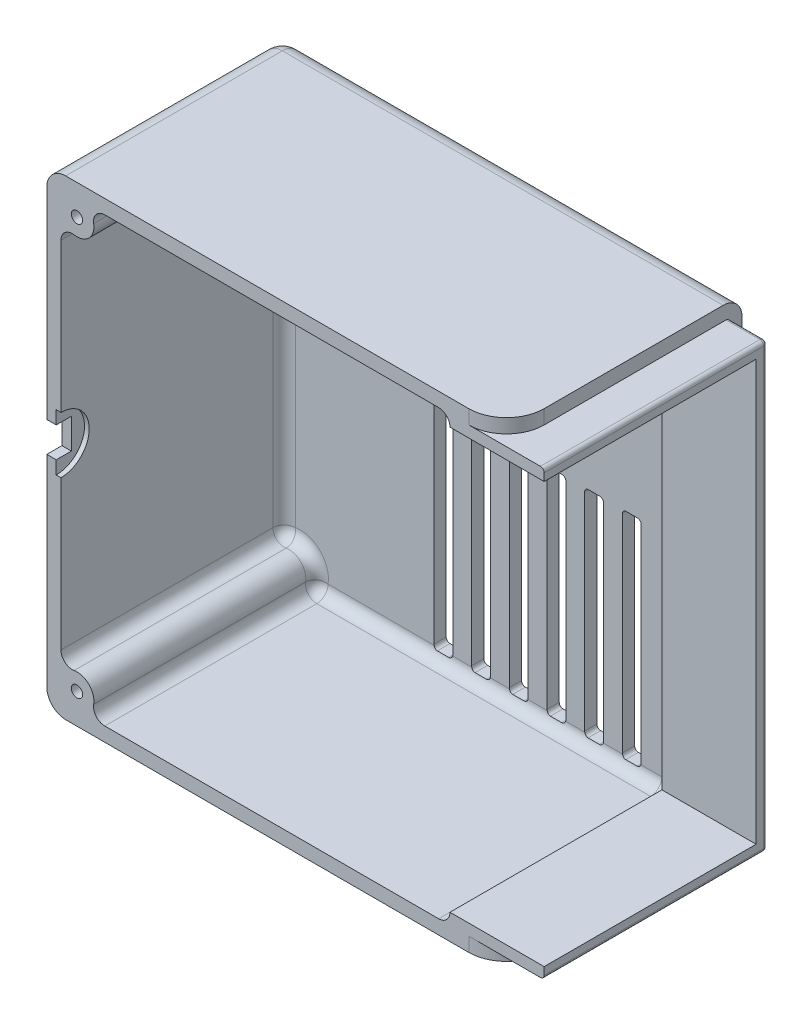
ISO-10303-21;
HEADER;
FILE_DESCRIPTION(('STEP AP214'),'2;1');
FILE_NAME('part.step','',(''),(''),'','','');
FILE_SCHEMA(('AUTOMOTIVE_DESIGN { 1 0 10303 214 1 1 1 1 }'));
ENDSEC;
DATA;
#1=APPLICATION_CONTEXT('core data for automotive mechanical design processes');
#2=APPLICATION_PROTOCOL_DEFINITION('international standard','automotive_design',2000,#1);
#3=PRODUCT_CONTEXT('',#1,'mechanical');
#4=PRODUCT('Part','Part','',(#3));
#5=PRODUCT_RELATED_PRODUCT_CATEGORY('part','',(#4));
#6=PRODUCT_DEFINITION_FORMATION('','',#4);
#7=PRODUCT_DEFINITION_CONTEXT('part definition',#1,'design');
#8=PRODUCT_DEFINITION('design','',#6,#7);
#9=PRODUCT_DEFINITION_SHAPE('','',#8);
#10=(LENGTH_UNIT() NAMED_UNIT(*) SI_UNIT(.MILLI.,.METRE.));
#11=(NAMED_UNIT(*) PLANE_ANGLE_UNIT() SI_UNIT($,.RADIAN.));
#12=(NAMED_UNIT(*) SI_UNIT($,.STERADIAN.) SOLID_ANGLE_UNIT());
#13=UNCERTAINTY_MEASURE_WITH_UNIT(LENGTH_MEASURE(1.E-05),#10,'distance_accuracy_value','');
#14=(GEOMETRIC_REPRESENTATION_CONTEXT(3) GLOBAL_UNCERTAINTY_ASSIGNED_CONTEXT((#13)) GLOBAL_UNIT_ASSIGNED_CONTEXT((#10,
#11,#12)) REPRESENTATION_CONTEXT('',''));
#15=CARTESIAN_POINT('',(0.,0.,0.));
#16=DIRECTION('',(0.,0.,1.));
#17=DIRECTION('',(1.,0.,0.));
#18=AXIS2_PLACEMENT_3D('',#15,#16,#17);
#19=CARTESIAN_POINT('',(-57.25,58.75,3.25));
#20=DIRECTION('',(-1.,0.,0.));
#21=DIRECTION('',(0.,-1.,0.));
#22=AXIS2_PLACEMENT_3D('',#19,#20,#21);
#23=PLANE('',#22);
#24=DIRECTION('',(0.,-1.,0.));
#25=VECTOR('',#24,1.);
#26=CARTESIAN_POINT('',(-57.25,58.75,62.5));
#27=LINE('',#26,#25);
#28=CARTESIAN_POINT('',(-57.25,-7.49999999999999,62.5));
#29=VERTEX_POINT('',#28);
#30=CARTESIAN_POINT('',(-57.25,-47.1049002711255,62.5));
#31=VERTEX_POINT('',#30);
#32=EDGE_CURVE('E1080',#29,#31,#27,.T.);
#33=ORIENTED_EDGE('',*,*,#32,.T.);
#34=DIRECTION('',(0.,0.,1.));
#35=VECTOR('',#34,1.);
#36=CARTESIAN_POINT('',(-57.25,-47.1049002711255,3.25));
#37=LINE('',#36,#35);
#38=CARTESIAN_POINT('',(-57.25,-47.1049002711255,6.25));
#39=VERTEX_POINT('',#38);
#40=EDGE_CURVE('E686',#31,#39,#37,.F.);
#41=ORIENTED_EDGE('',*,*,#40,.T.);
#42=DIRECTION('',(0.,-1.,0.));
#43=VECTOR('',#42,1.);
#44=CARTESIAN_POINT('',(-57.25,58.75,6.25));
#45=LINE('',#44,#43);
#46=CARTESIAN_POINT('',(-57.25,47.1049002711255,6.25));
#47=VERTEX_POINT('',#46);
#48=EDGE_CURVE('E684',#39,#47,#45,.F.);
#49=ORIENTED_EDGE('',*,*,#48,.T.);
#50=DIRECTION('',(0.,0.,1.));
#51=VECTOR('',#50,1.);
#52=CARTESIAN_POINT('',(-57.25,47.1049002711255,62.5));
#53=LINE('',#52,#51);
#54=CARTESIAN_POINT('',(-57.25,47.1049002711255,62.5));
#55=VERTEX_POINT('',#54);
#56=EDGE_CURVE('E682',#47,#55,#53,.T.);
#57=ORIENTED_EDGE('',*,*,#56,.T.);
#58=CARTESIAN_POINT('',(-57.25,7.50000000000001,62.5));
#59=VERTEX_POINT('',#58);
#60=EDGE_CURVE('E1075',#55,#59,#27,.T.);
#61=ORIENTED_EDGE('',*,*,#60,.T.);
#62=CARTESIAN_POINT('',(-57.25,0.,62.5));
#63=DIRECTION('',(-1.,0.,0.));
#64=DIRECTION('',(0.,-1.,0.));
#65=AXIS2_PLACEMENT_3D('',#62,#63,#64);
#66=CIRCLE('',#65,7.5);
#67=EDGE_CURVE('E1153',#59,#29,#66,.T.);
#68=ORIENTED_EDGE('',*,*,#67,.T.);
#69=EDGE_LOOP('',(#33,#41,#49,#57,#61,#68));
#70=FACE_BOUND('',#69,.T.);
#71=ADVANCED_FACE('F33',(#70),#23,.F.);
#72=CARTESIAN_POINT('',(-57.25,-58.75,3.25));
#73=DIRECTION('',(0.,-1.,0.));
#74=DIRECTION('',(0.,0.,-1.));
#75=AXIS2_PLACEMENT_3D('',#72,#73,#74);
#76=PLANE('',#75);
#77=DIRECTION('',(1.,0.,0.));
#78=VECTOR('',#77,1.);
#79=CARTESIAN_POINT('',(-57.25,-58.75,62.5));
#80=LINE('',#79,#78);
#81=CARTESIAN_POINT('',(-45.6049002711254,-58.75,62.5));
#82=VERTEX_POINT('',#81);
#83=CARTESIAN_POINT('',(43.,-58.75,62.5));
#84=VERTEX_POINT('',#83);
#85=EDGE_CURVE('E1068',#82,#84,#80,.T.);
#86=ORIENTED_EDGE('',*,*,#85,.T.);
#87=DIRECTION('',(0.,0.,-1.));
#88=VECTOR('',#87,1.);
#89=CARTESIAN_POINT('',(43.,-58.75,3.25));
#90=LINE('',#89,#88);
#91=CARTESIAN_POINT('',(43.,-58.75,6.25));
#92=VERTEX_POINT('',#91);
#93=EDGE_CURVE('E674',#84,#92,#90,.T.);
#94=ORIENTED_EDGE('',*,*,#93,.T.);
#95=DIRECTION('',(1.,0.,0.));
#96=VECTOR('',#95,1.);
#97=CARTESIAN_POINT('',(-57.25,-58.75,6.25));
#98=LINE('',#97,#96);
#99=CARTESIAN_POINT('',(-45.6049002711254,-58.75,6.25));
#100=VERTEX_POINT('',#99);
#101=EDGE_CURVE('E672',#92,#100,#98,.F.);
#102=ORIENTED_EDGE('',*,*,#101,.T.);
#103=DIRECTION('',(0.,0.,1.));
#104=VECTOR('',#103,1.);
#105=CARTESIAN_POINT('',(-45.6049002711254,-58.75,62.5));
#106=LINE('',#105,#104);
#107=EDGE_CURVE('E670',#100,#82,#106,.T.);
#108=ORIENTED_EDGE('',*,*,#107,.T.);
#109=EDGE_LOOP('',(#86,#94,#102,#108));
#110=FACE_BOUND('',#109,.T.);
#111=ADVANCED_FACE('F887',(#110),#76,.F.);
#112=CARTESIAN_POINT('',(-57.25,58.75,3.25));
#113=DIRECTION('',(0.,-1.,0.));
#114=DIRECTION('',(0.,0.,-1.));
#115=AXIS2_PLACEMENT_3D('',#112,#113,#114);
#116=PLANE('',#115);
#117=DIRECTION('',(1.,0.,0.));
#118=VECTOR('',#117,1.);
#119=CARTESIAN_POINT('',(46.,58.75,6.25));
#120=LINE('',#119,#118);
#121=CARTESIAN_POINT('',(-45.6049002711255,58.75,6.25));
#122=VERTEX_POINT('',#121);
#123=CARTESIAN_POINT('',(43.,58.75,6.25));
#124=VERTEX_POINT('',#123);
#125=EDGE_CURVE('E666',#122,#124,#120,.T.);
#126=ORIENTED_EDGE('',*,*,#125,.T.);
#127=DIRECTION('',(0.,0.,1.));
#128=VECTOR('',#127,1.);
#129=CARTESIAN_POINT('',(43.,58.75,3.25));
#130=LINE('',#129,#128);
#131=CARTESIAN_POINT('',(43.,58.75,62.5));
#132=VERTEX_POINT('',#131);
#133=EDGE_CURVE('E668',#124,#132,#130,.T.);
#134=ORIENTED_EDGE('',*,*,#133,.T.);
#135=DIRECTION('',(1.,0.,0.));
#136=VECTOR('',#135,1.);
#137=CARTESIAN_POINT('',(-57.25,58.75,62.5));
#138=LINE('',#137,#136);
#139=CARTESIAN_POINT('',(-45.6049002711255,58.75,62.5));
#140=VERTEX_POINT('',#139);
#141=EDGE_CURVE('E1074',#140,#132,#138,.T.);
#142=ORIENTED_EDGE('',*,*,#141,.F.);
#143=DIRECTION('',(0.,0.,-1.));
#144=VECTOR('',#143,1.);
#145=CARTESIAN_POINT('',(-45.6049002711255,58.75,3.25));
#146=LINE('',#145,#144);
#147=EDGE_CURVE('E664',#140,#122,#146,.T.);
#148=ORIENTED_EDGE('',*,*,#147,.T.);
#149=EDGE_LOOP('',(#126,#134,#142,#148));
#150=FACE_BOUND('',#149,.T.);
#151=ADVANCED_FACE('F893',(#150),#116,.T.);
#152=CARTESIAN_POINT('',(0.,0.,62.5));
#153=DIRECTION('',(0.,0.,-1.));
#154=DIRECTION('',(-1.,0.,0.));
#155=AXIS2_PLACEMENT_3D('',#152,#153,#154);
#156=PLANE('',#155);
#157=DIRECTION('',(0.,-1.,0.));
#158=VECTOR('',#157,1.);
#159=CARTESIAN_POINT('',(-61.,-62.5,62.5));
#160=LINE('',#159,#158);
#161=CARTESIAN_POINT('',(-61.,-4.,62.5));
#162=VERTEX_POINT('',#161);
#163=CARTESIAN_POINT('',(-61.,-57.5,62.5));
#164=VERTEX_POINT('',#163);
#165=EDGE_CURVE('E1092',#162,#164,#160,.T.);
#166=ORIENTED_EDGE('',*,*,#165,.T.);
#167=CARTESIAN_POINT('',(-56.,-57.5,62.5));
#168=DIRECTION('',(0.,0.,-1.));
#169=DIRECTION('',(-1.,0.,0.));
#170=AXIS2_PLACEMENT_3D('',#167,#168,#169);
#171=CIRCLE('',#170,5.);
#172=CARTESIAN_POINT('',(-56.,-62.5,62.5));
#173=VERTEX_POINT('',#172);
#174=EDGE_CURVE('E1206',#164,#173,#171,.F.);
#175=ORIENTED_EDGE('',*,*,#174,.T.);
#176=DIRECTION('',(1.,0.,0.));
#177=VECTOR('',#176,1.);
#178=CARTESIAN_POINT('',(-61.,-62.5,62.5));
#179=LINE('',#178,#177);
#180=CARTESIAN_POINT('',(51.,-62.5,62.5));
#181=VERTEX_POINT('',#180);
#182=EDGE_CURVE('E1095',#173,#181,#179,.T.);
#183=ORIENTED_EDGE('',*,*,#182,.T.);
#184=DIRECTION('',(0.,1.,0.));
#185=VECTOR('',#184,1.);
#186=CARTESIAN_POINT('',(51.,0.,62.5));
#187=LINE('',#186,#185);
#188=CARTESIAN_POINT('',(51.,-58.75,62.5));
#189=VERTEX_POINT('',#188);
#190=EDGE_CURVE('E1106',#181,#189,#187,.T.);
#191=ORIENTED_EDGE('',*,*,#190,.T.);
#192=DIRECTION('',(1.,0.,0.));
#193=VECTOR('',#192,1.);
#194=CARTESIAN_POINT('',(46.,-58.75,62.5));
#195=LINE('',#194,#193);
#196=CARTESIAN_POINT('',(70.,-58.75,62.5));
#197=VERTEX_POINT('',#196);
#198=EDGE_CURVE('E1240',#189,#197,#195,.T.);
#199=ORIENTED_EDGE('',*,*,#198,.T.);
#200=CARTESIAN_POINT('',(70.,-57.75,62.5));
#201=DIRECTION('',(0.,0.,-1.));
#202=DIRECTION('',(-1.,0.,0.));
#203=AXIS2_PLACEMENT_3D('',#200,#201,#202);
#204=CIRCLE('',#203,1.);
#205=CARTESIAN_POINT('',(71.,-57.75,62.5));
#206=VERTEX_POINT('',#205);
#207=EDGE_CURVE('E1137',#197,#206,#204,.F.);
#208=ORIENTED_EDGE('',*,*,#207,.T.);
#209=DIRECTION('',(0.,-1.,0.));
#210=VECTOR('',#209,1.);
#211=CARTESIAN_POINT('',(71.,-55.75,62.5));
#212=LINE('',#211,#210);
#213=CARTESIAN_POINT('',(71.,-55.75,62.5));
#214=VERTEX_POINT('',#213);
#215=EDGE_CURVE('E1253',#214,#206,#212,.T.);
#216=ORIENTED_EDGE('',*,*,#215,.F.);
#217=DIRECTION('',(1.,0.,0.));
#218=VECTOR('',#217,1.);
#219=CARTESIAN_POINT('',(46.,-55.75,62.5));
#220=LINE('',#219,#218);
#221=CARTESIAN_POINT('',(46.,-55.75,62.5));
#222=VERTEX_POINT('',#221);
#223=EDGE_CURVE('E1071',#222,#214,#220,.T.);
#224=ORIENTED_EDGE('',*,*,#223,.F.);
#225=CARTESIAN_POINT('',(43.,-55.75,62.5));
#226=DIRECTION('',(0.,0.,-1.));
#227=DIRECTION('',(-1.,0.,0.));
#228=AXIS2_PLACEMENT_3D('',#225,#226,#227);
#229=CIRCLE('',#228,3.);
#230=EDGE_CURVE('E688',#222,#84,#229,.T.);
#231=ORIENTED_EDGE('',*,*,#230,.T.);
#232=ORIENTED_EDGE('',*,*,#85,.F.);
#233=CARTESIAN_POINT('',(-45.6049002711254,-55.75,62.5));
#234=DIRECTION('',(0.,0.,-1.));
#235=DIRECTION('',(-1.,0.,0.));
#236=AXIS2_PLACEMENT_3D('',#233,#234,#235);
#237=CIRCLE('',#236,3.);
#238=CARTESIAN_POINT('',(-48.5629401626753,-55.25,62.5));
#239=VERTEX_POINT('',#238);
#240=EDGE_CURVE('E692',#82,#239,#237,.T.);
#241=ORIENTED_EDGE('',*,*,#240,.T.);
#242=CARTESIAN_POINT('',(-53.,-54.5,62.5));
#243=DIRECTION('',(0.,0.,-1.));
#244=DIRECTION('',(-1.,0.,0.));
#245=AXIS2_PLACEMENT_3D('',#242,#243,#244);
#246=CIRCLE('',#245,4.5);
#247=CARTESIAN_POINT('',(-53.75,-50.0629401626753,62.5));
#248=VERTEX_POINT('',#247);
#249=EDGE_CURVE('E776',#248,#239,#246,.T.);
#250=ORIENTED_EDGE('',*,*,#249,.F.);
#251=CARTESIAN_POINT('',(-54.25,-47.1049002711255,62.5));
#252=DIRECTION('',(0.,0.,-1.));
#253=DIRECTION('',(-1.,0.,0.));
#254=AXIS2_PLACEMENT_3D('',#251,#252,#253);
#255=CIRCLE('',#254,3.);
#256=EDGE_CURVE('E694',#248,#31,#255,.T.);
#257=ORIENTED_EDGE('',*,*,#256,.T.);
#258=ORIENTED_EDGE('',*,*,#32,.F.);
#259=DIRECTION('',(1.,0.,0.));
#260=VECTOR('',#259,1.);
#261=CARTESIAN_POINT('',(-58.5,-7.49999999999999,62.5));
#262=LINE('',#261,#260);
#263=CARTESIAN_POINT('',(-58.5,-7.49999999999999,62.5));
#264=VERTEX_POINT('',#263);
#265=EDGE_CURVE('E1376',#29,#264,#262,.F.);
#266=ORIENTED_EDGE('',*,*,#265,.T.);
#267=DIRECTION('',(0.,-1.,0.));
#268=VECTOR('',#267,1.);
#269=CARTESIAN_POINT('',(-58.5,0.,62.5));
#270=LINE('',#269,#268);
#271=CARTESIAN_POINT('',(-58.5,-4.00000000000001,62.5));
#272=VERTEX_POINT('',#271);
#273=EDGE_CURVE('E1175',#272,#264,#270,.T.);
#274=ORIENTED_EDGE('',*,*,#273,.F.);
#275=DIRECTION('',(1.,0.,0.));
#276=VECTOR('',#275,1.);
#277=CARTESIAN_POINT('',(-61.001,-4.00000000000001,62.5));
#278=LINE('',#277,#276);
#279=EDGE_CURVE('E1399',#162,#272,#278,.T.);
#280=ORIENTED_EDGE('',*,*,#279,.F.);
#281=EDGE_LOOP('',(#166,#175,#183,#191,#199,#208,#216,#224,#231,#232,#241,#250,#257,#258,#266,
#274,#280));
#282=FACE_BOUND('',#281,.T.);
#283=CARTESIAN_POINT('',(-53.,-54.5,62.5));
#284=DIRECTION('',(0.,0.,-1.));
#285=DIRECTION('',(-1.,0.,0.));
#286=AXIS2_PLACEMENT_3D('',#283,#284,#285);
#287=CIRCLE('',#286,1.5);
#288=CARTESIAN_POINT('',(-54.5,-54.5,62.5));
#289=VERTEX_POINT('',#288);
#290=EDGE_CURVE('E1407',#289,#289,#287,.T.);
#291=ORIENTED_EDGE('',*,*,#290,.T.);
#292=EDGE_LOOP('',(#291));
#293=FACE_BOUND('',#292,.T.);
#294=ADVANCED_FACE('F905',(#282,#293),#156,.F.);
#295=CARTESIAN_POINT('',(0.,0.,3.25));
#296=DIRECTION('',(0.,0.,1.));
#297=DIRECTION('',(1.,0.,0.));
#298=AXIS2_PLACEMENT_3D('',#295,#296,#297);
#299=PLANE('',#298);
#300=CARTESIAN_POINT('',(-6.49999999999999,-55.5000000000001,3.25));
#301=DIRECTION('',(0.,0.,1.));
#302=DIRECTION('',(1.,0.,0.));
#303=AXIS2_PLACEMENT_3D('',#300,#301,#302);
#304=CIRCLE('',#303,1.);
#305=CARTESIAN_POINT('',(-7.46824583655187,-55.75,3.25));
#306=VERTEX_POINT('',#305);
#307=CARTESIAN_POINT('',(-7.49999999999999,-55.5,3.25));
#308=VERTEX_POINT('',#307);
#309=EDGE_CURVE('E621',#306,#308,#304,.F.);
#310=ORIENTED_EDGE('',*,*,#309,.T.);
#311=DIRECTION('',(0.,1.,0.));
#312=VECTOR('',#311,1.);
#313=CARTESIAN_POINT('',(-7.49999999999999,-55.5,3.25));
#314=LINE('',#313,#312);
#315=CARTESIAN_POINT('',(-7.49999999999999,-0.500000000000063,3.25));
#316=VERTEX_POINT('',#315);
#317=EDGE_CURVE('E2167',#308,#316,#314,.T.);
#318=ORIENTED_EDGE('',*,*,#317,.T.);
#319=CARTESIAN_POINT('',(-6.49999999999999,-0.500000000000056,3.25));
#320=DIRECTION('',(0.,0.,1.));
#321=DIRECTION('',(1.,0.,0.));
#322=AXIS2_PLACEMENT_3D('',#319,#320,#321);
#323=CIRCLE('',#322,1.);
#324=CARTESIAN_POINT('',(-6.49999999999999,0.499999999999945,3.25));
#325=VERTEX_POINT('',#324);
#326=EDGE_CURVE('E2237',#316,#325,#323,.F.);
#327=ORIENTED_EDGE('',*,*,#326,.T.);
#328=DIRECTION('',(1.,0.,0.));
#329=VECTOR('',#328,1.);
#330=CARTESIAN_POINT('',(-6.49999999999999,0.499999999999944,3.25));
#331=LINE('',#330,#329);
#332=CARTESIAN_POINT('',(-3.5,0.499999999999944,3.25));
#333=VERTEX_POINT('',#332);
#334=EDGE_CURVE('E2558',#325,#333,#331,.T.);
#335=ORIENTED_EDGE('',*,*,#334,.T.);
#336=CARTESIAN_POINT('',(-3.49999999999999,-0.500000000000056,3.25));
#337=DIRECTION('',(0.,0.,1.));
#338=DIRECTION('',(1.,0.,0.));
#339=AXIS2_PLACEMENT_3D('',#336,#337,#338);
#340=CIRCLE('',#339,1.);
#341=CARTESIAN_POINT('',(-2.49999999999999,-0.500000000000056,3.25));
#342=VERTEX_POINT('',#341);
#343=EDGE_CURVE('E2561',#333,#342,#340,.F.);
#344=ORIENTED_EDGE('',*,*,#343,.T.);
#345=DIRECTION('',(0.,-1.,0.));
#346=VECTOR('',#345,1.);
#347=CARTESIAN_POINT('',(-2.49999999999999,-55.5,3.25));
#348=LINE('',#347,#346);
#349=CARTESIAN_POINT('',(-2.49999999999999,-55.5000000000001,3.25));
#350=VERTEX_POINT('',#349);
#351=EDGE_CURVE('E2566',#342,#350,#348,.T.);
#352=ORIENTED_EDGE('',*,*,#351,.T.);
#353=CARTESIAN_POINT('',(-3.49999999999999,-55.5000000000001,3.25));
#354=DIRECTION('',(0.,0.,1.));
#355=DIRECTION('',(1.,0.,0.));
#356=AXIS2_PLACEMENT_3D('',#353,#354,#355);
#357=CIRCLE('',#356,1.);
#358=CARTESIAN_POINT('',(-2.53175416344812,-55.75,3.25));
#359=VERTEX_POINT('',#358);
#360=EDGE_CURVE('E631',#350,#359,#357,.F.);
#361=ORIENTED_EDGE('',*,*,#360,.T.);
#362=DIRECTION('',(1.,0.,0.));
#363=VECTOR('',#362,1.);
#364=CARTESIAN_POINT('',(0.,-55.75,3.25));
#365=LINE('',#364,#363);
#366=CARTESIAN_POINT('',(2.53175416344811,-55.75,3.25));
#367=VERTEX_POINT('',#366);
#368=EDGE_CURVE('E647',#359,#367,#365,.T.);
#369=ORIENTED_EDGE('',*,*,#368,.T.);
#370=CARTESIAN_POINT('',(3.50000000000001,-55.5000000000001,3.25));
#371=DIRECTION('',(0.,0.,1.));
#372=DIRECTION('',(1.,0.,0.));
#373=AXIS2_PLACEMENT_3D('',#370,#371,#372);
#374=CIRCLE('',#373,1.);
#375=CARTESIAN_POINT('',(2.50000000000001,-55.5000000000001,3.25));
#376=VERTEX_POINT('',#375);
#377=EDGE_CURVE('E2181',#367,#376,#374,.F.);
#378=ORIENTED_EDGE('',*,*,#377,.T.);
#379=DIRECTION('',(0.,1.,0.));
#380=VECTOR('',#379,1.);
#381=CARTESIAN_POINT('',(2.50000000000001,-55.5000000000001,3.25));
#382=LINE('',#381,#380);
#383=CARTESIAN_POINT('',(2.50000000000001,-0.500000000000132,3.25));
#384=VERTEX_POINT('',#383);
#385=EDGE_CURVE('E2217',#376,#384,#382,.T.);
#386=ORIENTED_EDGE('',*,*,#385,.T.);
#387=CARTESIAN_POINT('',(3.50000000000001,-0.500000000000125,3.25));
#388=DIRECTION('',(0.,0.,1.));
#389=DIRECTION('',(1.,0.,0.));
#390=AXIS2_PLACEMENT_3D('',#387,#388,#389);
#391=CIRCLE('',#390,1.);
#392=CARTESIAN_POINT('',(3.50000000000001,0.499999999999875,3.25));
#393=VERTEX_POINT('',#392);
#394=EDGE_CURVE('E851',#384,#393,#391,.F.);
#395=ORIENTED_EDGE('',*,*,#394,.T.);
#396=DIRECTION('',(1.,0.,0.));
#397=VECTOR('',#396,1.);
#398=CARTESIAN_POINT('',(3.50000000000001,0.499999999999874,3.25));
#399=LINE('',#398,#397);
#400=CARTESIAN_POINT('',(6.5,0.499999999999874,3.25));
#401=VERTEX_POINT('',#400);
#402=EDGE_CURVE('E2172',#393,#401,#399,.T.);
#403=ORIENTED_EDGE('',*,*,#402,.T.);
#404=CARTESIAN_POINT('',(6.50000000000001,-0.500000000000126,3.25));
#405=DIRECTION('',(0.,0.,1.));
#406=DIRECTION('',(1.,0.,0.));
#407=AXIS2_PLACEMENT_3D('',#404,#405,#406);
#408=CIRCLE('',#407,1.);
#409=CARTESIAN_POINT('',(7.50000000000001,-0.500000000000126,3.25));
#410=VERTEX_POINT('',#409);
#411=EDGE_CURVE('E2175',#401,#410,#408,.F.);
#412=ORIENTED_EDGE('',*,*,#411,.T.);
#413=DIRECTION('',(0.,-1.,0.));
#414=VECTOR('',#413,1.);
#415=CARTESIAN_POINT('',(7.50000000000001,-55.5000000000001,3.25));
#416=LINE('',#415,#414);
#417=CARTESIAN_POINT('',(7.50000000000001,-55.5000000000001,3.25));
#418=VERTEX_POINT('',#417);
#419=EDGE_CURVE('E2178',#410,#418,#416,.T.);
#420=ORIENTED_EDGE('',*,*,#419,.T.);
#421=CARTESIAN_POINT('',(6.50000000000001,-55.5000000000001,3.25));
#422=DIRECTION('',(0.,0.,1.));
#423=DIRECTION('',(1.,0.,0.));
#424=AXIS2_PLACEMENT_3D('',#421,#422,#423);
#425=CIRCLE('',#424,1.);
#426=CARTESIAN_POINT('',(7.4682458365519,-55.75,3.25));
#427=VERTEX_POINT('',#426);
#428=EDGE_CURVE('E807',#418,#427,#425,.F.);
#429=ORIENTED_EDGE('',*,*,#428,.T.);
#430=CARTESIAN_POINT('',(12.5317541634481,-55.75,3.25));
#431=VERTEX_POINT('',#430);
#432=EDGE_CURVE('E653',#427,#431,#365,.T.);
#433=ORIENTED_EDGE('',*,*,#432,.T.);
#434=CARTESIAN_POINT('',(13.5,-55.5000000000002,3.25));
#435=DIRECTION('',(0.,0.,1.));
#436=DIRECTION('',(1.,0.,0.));
#437=AXIS2_PLACEMENT_3D('',#434,#435,#436);
#438=CIRCLE('',#437,1.);
#439=CARTESIAN_POINT('',(12.5,-55.5000000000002,3.25));
#440=VERTEX_POINT('',#439);
#441=EDGE_CURVE('E805',#431,#440,#438,.F.);
#442=ORIENTED_EDGE('',*,*,#441,.T.);
#443=DIRECTION('',(0.,1.,0.));
#444=VECTOR('',#443,1.);
#445=CARTESIAN_POINT('',(12.5,-55.5000000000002,3.25));
#446=LINE('',#445,#444);
#447=CARTESIAN_POINT('',(12.5,-0.500000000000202,3.25));
#448=VERTEX_POINT('',#447);
#449=EDGE_CURVE('E852',#440,#448,#446,.T.);
#450=ORIENTED_EDGE('',*,*,#449,.T.);
#451=CARTESIAN_POINT('',(13.5,-0.500000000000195,3.25));
#452=DIRECTION('',(0.,0.,1.));
#453=DIRECTION('',(1.,0.,0.));
#454=AXIS2_PLACEMENT_3D('',#451,#452,#453);
#455=CIRCLE('',#454,1.);
#456=CARTESIAN_POINT('',(13.5,0.499999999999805,3.25));
#457=VERTEX_POINT('',#456);
#458=EDGE_CURVE('E2238',#448,#457,#455,.F.);
#459=ORIENTED_EDGE('',*,*,#458,.T.);
#460=DIRECTION('',(1.,0.,0.));
#461=VECTOR('',#460,1.);
#462=CARTESIAN_POINT('',(13.5,0.499999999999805,3.25));
#463=LINE('',#462,#461);
#464=CARTESIAN_POINT('',(16.5,0.499999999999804,3.25));
#465=VERTEX_POINT('',#464);
#466=EDGE_CURVE('E2242',#457,#465,#463,.T.);
#467=ORIENTED_EDGE('',*,*,#466,.T.);
#468=CARTESIAN_POINT('',(16.5,-0.500000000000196,3.25));
#469=DIRECTION('',(0.,0.,1.));
#470=DIRECTION('',(1.,0.,0.));
#471=AXIS2_PLACEMENT_3D('',#468,#469,#470);
#472=CIRCLE('',#471,1.);
#473=CARTESIAN_POINT('',(17.5,-0.500000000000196,3.25));
#474=VERTEX_POINT('',#473);
#475=EDGE_CURVE('E2246',#465,#474,#472,.F.);
#476=ORIENTED_EDGE('',*,*,#475,.T.);
#477=DIRECTION('',(0.,-1.,0.));
#478=VECTOR('',#477,1.);
#479=CARTESIAN_POINT('',(17.5,-55.5000000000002,3.25));
#480=LINE('',#479,#478);
#481=CARTESIAN_POINT('',(17.5,-55.5000000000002,3.25));
#482=VERTEX_POINT('',#481);
#483=EDGE_CURVE('E2249',#474,#482,#480,.T.);
#484=ORIENTED_EDGE('',*,*,#483,.T.);
#485=CARTESIAN_POINT('',(16.5,-55.5000000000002,3.25));
#486=DIRECTION('',(0.,0.,1.));
#487=DIRECTION('',(1.,0.,0.));
#488=AXIS2_PLACEMENT_3D('',#485,#486,#487);
#489=CIRCLE('',#488,1.);
#490=CARTESIAN_POINT('',(17.4682458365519,-55.75,3.25));
#491=VERTEX_POINT('',#490);
#492=EDGE_CURVE('E2252',#482,#491,#489,.F.);
#493=ORIENTED_EDGE('',*,*,#492,.T.);
#494=CARTESIAN_POINT('',(22.5317541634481,-55.75,3.25));
#495=VERTEX_POINT('',#494);
#496=EDGE_CURVE('E792',#491,#495,#365,.T.);
#497=ORIENTED_EDGE('',*,*,#496,.T.);
#498=CARTESIAN_POINT('',(23.5,-55.5000000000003,3.25));
#499=DIRECTION('',(0.,0.,1.));
#500=DIRECTION('',(1.,0.,0.));
#501=AXIS2_PLACEMENT_3D('',#498,#499,#500);
#502=CIRCLE('',#501,1.);
#503=CARTESIAN_POINT('',(22.5,-55.5000000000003,3.25));
#504=VERTEX_POINT('',#503);
#505=EDGE_CURVE('E2265',#495,#504,#502,.F.);
#506=ORIENTED_EDGE('',*,*,#505,.T.);
#507=DIRECTION('',(0.,1.,0.));
#508=VECTOR('',#507,1.);
#509=CARTESIAN_POINT('',(22.5,-55.5000000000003,3.25));
#510=LINE('',#509,#508);
#511=CARTESIAN_POINT('',(22.5,-0.500000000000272,3.25));
#512=VERTEX_POINT('',#511);
#513=EDGE_CURVE('E2282',#504,#512,#510,.T.);
#514=ORIENTED_EDGE('',*,*,#513,.T.);
#515=CARTESIAN_POINT('',(23.5,-0.500000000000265,3.25));
#516=DIRECTION('',(0.,0.,1.));
#517=DIRECTION('',(1.,0.,0.));
#518=AXIS2_PLACEMENT_3D('',#515,#516,#517);
#519=CIRCLE('',#518,1.);
#520=CARTESIAN_POINT('',(23.5,0.499999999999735,3.25));
#521=VERTEX_POINT('',#520);
#522=EDGE_CURVE('E854',#512,#521,#519,.F.);
#523=ORIENTED_EDGE('',*,*,#522,.T.);
#524=DIRECTION('',(1.,0.,0.));
#525=VECTOR('',#524,1.);
#526=CARTESIAN_POINT('',(23.5,0.499999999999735,3.25));
#527=LINE('',#526,#525);
#528=CARTESIAN_POINT('',(26.5,0.499999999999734,3.25));
#529=VERTEX_POINT('',#528);
#530=EDGE_CURVE('E2458',#521,#529,#527,.T.);
#531=ORIENTED_EDGE('',*,*,#530,.T.);
#532=CARTESIAN_POINT('',(26.5,-0.500000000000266,3.25));
#533=DIRECTION('',(0.,0.,1.));
#534=DIRECTION('',(1.,0.,0.));
#535=AXIS2_PLACEMENT_3D('',#532,#533,#534);
#536=CIRCLE('',#535,1.);
#537=CARTESIAN_POINT('',(27.5,-0.500000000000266,3.25));
#538=VERTEX_POINT('',#537);
#539=EDGE_CURVE('E2455',#529,#538,#536,.F.);
#540=ORIENTED_EDGE('',*,*,#539,.T.);
#541=DIRECTION('',(0.,-1.,0.));
#542=VECTOR('',#541,1.);
#543=CARTESIAN_POINT('',(27.5,-55.5000000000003,3.25));
#544=LINE('',#543,#542);
#545=CARTESIAN_POINT('',(27.5,-55.5000000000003,3.25));
#546=VERTEX_POINT('',#545);
#547=EDGE_CURVE('E2453',#538,#546,#544,.T.);
#548=ORIENTED_EDGE('',*,*,#547,.T.);
#549=CARTESIAN_POINT('',(26.5,-55.5000000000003,3.25));
#550=DIRECTION('',(0.,0.,1.));
#551=DIRECTION('',(1.,0.,0.));
#552=AXIS2_PLACEMENT_3D('',#549,#550,#551);
#553=CIRCLE('',#552,1.);
#554=CARTESIAN_POINT('',(27.4682458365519,-55.75,3.25));
#555=VERTEX_POINT('',#554);
#556=EDGE_CURVE('E2447',#546,#555,#553,.F.);
#557=ORIENTED_EDGE('',*,*,#556,.T.);
#558=CARTESIAN_POINT('',(32.5317541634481,-55.75,3.25));
#559=VERTEX_POINT('',#558);
#560=EDGE_CURVE('E787',#555,#559,#365,.T.);
#561=ORIENTED_EDGE('',*,*,#560,.T.);
#562=CARTESIAN_POINT('',(33.5,-55.5000000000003,3.25));
#563=DIRECTION('',(0.,0.,1.));
#564=DIRECTION('',(1.,0.,0.));
#565=AXIS2_PLACEMENT_3D('',#562,#563,#564);
#566=CIRCLE('',#565,1.);
#567=CARTESIAN_POINT('',(32.5,-55.5000000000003,3.25));
#568=VERTEX_POINT('',#567);
#569=EDGE_CURVE('E2299',#559,#568,#566,.F.);
#570=ORIENTED_EDGE('',*,*,#569,.T.);
#571=DIRECTION('',(0.,1.,0.));
#572=VECTOR('',#571,1.);
#573=CARTESIAN_POINT('',(32.5,-55.5000000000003,3.25));
#574=LINE('',#573,#572);
#575=CARTESIAN_POINT('',(32.5,-0.500000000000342,3.25));
#576=VERTEX_POINT('',#575);
#577=EDGE_CURVE('E2320',#568,#576,#574,.T.);
#578=ORIENTED_EDGE('',*,*,#577,.T.);
#579=CARTESIAN_POINT('',(33.5,-0.500000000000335,3.25));
#580=DIRECTION('',(0.,0.,1.));
#581=DIRECTION('',(1.,0.,0.));
#582=AXIS2_PLACEMENT_3D('',#579,#580,#581);
#583=CIRCLE('',#582,1.);
#584=CARTESIAN_POINT('',(33.5,0.499999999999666,3.25));
#585=VERTEX_POINT('',#584);
#586=EDGE_CURVE('E2284',#576,#585,#583,.F.);
#587=ORIENTED_EDGE('',*,*,#586,.T.);
#588=DIRECTION('',(1.,0.,0.));
#589=VECTOR('',#588,1.);
#590=CARTESIAN_POINT('',(33.5,0.499999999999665,3.25));
#591=LINE('',#590,#589);
#592=CARTESIAN_POINT('',(36.5,0.499999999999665,3.25));
#593=VERTEX_POINT('',#592);
#594=EDGE_CURVE('E2288',#585,#593,#591,.T.);
#595=ORIENTED_EDGE('',*,*,#594,.T.);
#596=CARTESIAN_POINT('',(36.5,-0.500000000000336,3.25));
#597=DIRECTION('',(0.,0.,1.));
#598=DIRECTION('',(1.,0.,0.));
#599=AXIS2_PLACEMENT_3D('',#596,#597,#598);
#600=CIRCLE('',#599,1.);
#601=CARTESIAN_POINT('',(37.5,-0.500000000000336,3.25));
#602=VERTEX_POINT('',#601);
#603=EDGE_CURVE('E2291',#593,#602,#600,.F.);
#604=ORIENTED_EDGE('',*,*,#603,.T.);
#605=DIRECTION('',(0.,-1.,0.));
#606=VECTOR('',#605,1.);
#607=CARTESIAN_POINT('',(37.5,-55.5000000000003,3.25));
#608=LINE('',#607,#606);
#609=CARTESIAN_POINT('',(37.5,-55.5000000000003,3.25));
#610=VERTEX_POINT('',#609);
#611=EDGE_CURVE('E2294',#602,#610,#608,.T.);
#612=ORIENTED_EDGE('',*,*,#611,.T.);
#613=CARTESIAN_POINT('',(36.5,-55.5000000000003,3.25));
#614=DIRECTION('',(0.,0.,1.));
#615=DIRECTION('',(1.,0.,0.));
#616=AXIS2_PLACEMENT_3D('',#613,#614,#615);
#617=CIRCLE('',#616,1.);
#618=CARTESIAN_POINT('',(37.468245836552,-55.75,3.25));
#619=VERTEX_POINT('',#618);
#620=EDGE_CURVE('E2297',#610,#619,#617,.F.);
#621=ORIENTED_EDGE('',*,*,#620,.T.);
#622=CARTESIAN_POINT('',(43.,-55.75,3.25));
#623=VERTEX_POINT('',#622);
#624=EDGE_CURVE('E651',#619,#623,#365,.T.);
#625=ORIENTED_EDGE('',*,*,#624,.T.);
#626=DIRECTION('',(0.,1.,0.));
#627=VECTOR('',#626,1.);
#628=CARTESIAN_POINT('',(43.,0.,3.25));
#629=LINE('',#628,#627);
#630=CARTESIAN_POINT('',(43.,55.75,3.25));
#631=VERTEX_POINT('',#630);
#632=EDGE_CURVE('E650',#623,#631,#629,.T.);
#633=ORIENTED_EDGE('',*,*,#632,.T.);
#634=DIRECTION('',(1.,0.,0.));
#635=VECTOR('',#634,1.);
#636=CARTESIAN_POINT('',(-51.5209800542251,55.75,3.25));
#637=LINE('',#636,#635);
#638=CARTESIAN_POINT('',(-45.6049002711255,55.75,3.25));
#639=VERTEX_POINT('',#638);
#640=EDGE_CURVE('E659',#631,#639,#637,.F.);
#641=ORIENTED_EDGE('',*,*,#640,.T.);
#642=CARTESIAN_POINT('',(-53.,54.5,3.25));
#643=DIRECTION('',(0.,0.,1.));
#644=DIRECTION('',(1.,0.,0.));
#645=AXIS2_PLACEMENT_3D('',#642,#643,#644);
#646=CIRCLE('',#645,7.5);
#647=CARTESIAN_POINT('',(-54.25,47.1049002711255,3.25));
#648=VERTEX_POINT('',#647);
#649=EDGE_CURVE('E661',#639,#648,#646,.F.);
#650=ORIENTED_EDGE('',*,*,#649,.T.);
#651=DIRECTION('',(0.,-1.,0.));
#652=VECTOR('',#651,1.);
#653=CARTESIAN_POINT('',(-54.25,0.,3.25));
#654=LINE('',#653,#652);
#655=CARTESIAN_POINT('',(-54.25,-47.1049002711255,3.25));
#656=VERTEX_POINT('',#655);
#657=EDGE_CURVE('E783',#648,#656,#654,.T.);
#658=ORIENTED_EDGE('',*,*,#657,.T.);
#659=CARTESIAN_POINT('',(-53.,-54.5,3.25));
#660=DIRECTION('',(0.,0.,1.));
#661=DIRECTION('',(1.,0.,0.));
#662=AXIS2_PLACEMENT_3D('',#659,#660,#661);
#663=CIRCLE('',#662,7.5);
#664=CARTESIAN_POINT('',(-45.6049002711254,-55.75,3.25));
#665=VERTEX_POINT('',#664);
#666=EDGE_CURVE('E656',#656,#665,#663,.F.);
#667=ORIENTED_EDGE('',*,*,#666,.T.);
#668=CARTESIAN_POINT('',(-17.4682458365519,-55.75,3.25));
#669=VERTEX_POINT('',#668);
#670=EDGE_CURVE('E646',#665,#669,#365,.T.);
#671=ORIENTED_EDGE('',*,*,#670,.T.);
#672=CARTESIAN_POINT('',(-16.5,-55.5,3.25));
#673=DIRECTION('',(0.,0.,1.));
#674=DIRECTION('',(1.,0.,0.));
#675=AXIS2_PLACEMENT_3D('',#672,#673,#674);
#676=CIRCLE('',#675,1.);
#677=CARTESIAN_POINT('',(-17.5,-55.5,3.25));
#678=VERTEX_POINT('',#677);
#679=EDGE_CURVE('E2333',#669,#678,#676,.F.);
#680=ORIENTED_EDGE('',*,*,#679,.T.);
#681=DIRECTION('',(0.,1.,0.));
#682=VECTOR('',#681,1.);
#683=CARTESIAN_POINT('',(-17.5,-55.5,3.25));
#684=LINE('',#683,#682);
#685=CARTESIAN_POINT('',(-17.5,-0.499999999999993,3.25));
#686=VERTEX_POINT('',#685);
#687=EDGE_CURVE('E1417',#678,#686,#684,.T.);
#688=ORIENTED_EDGE('',*,*,#687,.T.);
#689=CARTESIAN_POINT('',(-16.5,-0.499999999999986,3.25));
#690=DIRECTION('',(0.,0.,1.));
#691=DIRECTION('',(1.,0.,0.));
#692=AXIS2_PLACEMENT_3D('',#689,#690,#691);
#693=CIRCLE('',#692,1.);
#694=CARTESIAN_POINT('',(-16.5,0.500000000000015,3.25));
#695=VERTEX_POINT('',#694);
#696=EDGE_CURVE('E2166',#686,#695,#693,.F.);
#697=ORIENTED_EDGE('',*,*,#696,.T.);
#698=DIRECTION('',(1.,0.,0.));
#699=VECTOR('',#698,1.);
#700=CARTESIAN_POINT('',(-16.5,0.500000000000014,3.25));
#701=LINE('',#700,#699);
#702=CARTESIAN_POINT('',(-13.5,0.500000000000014,3.25));
#703=VERTEX_POINT('',#702);
#704=EDGE_CURVE('E2325',#695,#703,#701,.T.);
#705=ORIENTED_EDGE('',*,*,#704,.T.);
#706=CARTESIAN_POINT('',(-13.5,-0.499999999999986,3.25));
#707=DIRECTION('',(0.,0.,1.));
#708=DIRECTION('',(1.,0.,0.));
#709=AXIS2_PLACEMENT_3D('',#706,#707,#708);
#710=CIRCLE('',#709,1.);
#711=CARTESIAN_POINT('',(-12.5,-0.499999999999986,3.25));
#712=VERTEX_POINT('',#711);
#713=EDGE_CURVE('E2328',#703,#712,#710,.F.);
#714=ORIENTED_EDGE('',*,*,#713,.T.);
#715=DIRECTION('',(0.,-1.,0.));
#716=VECTOR('',#715,1.);
#717=CARTESIAN_POINT('',(-12.5,-55.5,3.25));
#718=LINE('',#717,#716);
#719=CARTESIAN_POINT('',(-12.5,-55.5,3.25));
#720=VERTEX_POINT('',#719);
#721=EDGE_CURVE('E2331',#712,#720,#718,.T.);
#722=ORIENTED_EDGE('',*,*,#721,.T.);
#723=CARTESIAN_POINT('',(-13.5,-55.5,3.25));
#724=DIRECTION('',(0.,0.,1.));
#725=DIRECTION('',(1.,0.,0.));
#726=AXIS2_PLACEMENT_3D('',#723,#724,#725);
#727=CIRCLE('',#726,1.);
#728=CARTESIAN_POINT('',(-12.5317541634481,-55.75,3.25));
#729=VERTEX_POINT('',#728);
#730=EDGE_CURVE('E645',#720,#729,#727,.F.);
#731=ORIENTED_EDGE('',*,*,#730,.T.);
#732=EDGE_CURVE('E638',#729,#306,#365,.T.);
#733=ORIENTED_EDGE('',*,*,#732,.T.);
#734=EDGE_LOOP('',(#310,#318,#327,#335,#344,#352,#361,#369,#378,#386,#395,#403,#412,#420,#429,
#433,#442,#450,#459,#467,#476,#484,#493,#497,#506,#514,#523,#531,#540,#548,#557,#561,#570,#578,
#587,#595,#604,#612,#621,#625,#633,#641,#650,#658,#667,#671,#680,#688,#697,#705,#714,#722,#731,#733));
#735=FACE_BOUND('',#734,.T.);
#736=ADVANCED_FACE('F643',(#735),#299,.T.);
#737=CARTESIAN_POINT('',(61.,-62.5,62.5));
#738=DIRECTION('',(-1.,0.,0.));
#739=DIRECTION('',(0.,0.,1.));
#740=AXIS2_PLACEMENT_3D('',#737,#738,#739);
#741=PLANE('',#740);
#742=DIRECTION('',(0.,0.,-1.));
#743=VECTOR('',#742,1.);
#744=CARTESIAN_POINT('',(61.,-62.5,62.5));
#745=LINE('',#744,#743);
#746=CARTESIAN_POINT('',(61.,-62.5,52.5));
#747=VERTEX_POINT('',#746);
#748=CARTESIAN_POINT('',(61.,-62.5,5.));
#749=VERTEX_POINT('',#748);
#750=EDGE_CURVE('E1097',#747,#749,#745,.T.);
#751=ORIENTED_EDGE('',*,*,#750,.T.);
#752=CARTESIAN_POINT('',(61.,-57.5,5.));
#753=DIRECTION('',(-1.,0.,0.));
#754=DIRECTION('',(0.,0.,1.));
#755=AXIS2_PLACEMENT_3D('',#752,#753,#754);
#756=CIRCLE('',#755,5.);
#757=CARTESIAN_POINT('',(61.,-57.5,0.));
#758=VERTEX_POINT('',#757);
#759=EDGE_CURVE('E1192',#749,#758,#756,.F.);
#760=ORIENTED_EDGE('',*,*,#759,.T.);
#761=DIRECTION('',(0.,1.,0.));
#762=VECTOR('',#761,1.);
#763=CARTESIAN_POINT('',(61.,-62.5,0.));
#764=LINE('',#763,#762);
#765=CARTESIAN_POINT('',(61.,57.5,0.));
#766=VERTEX_POINT('',#765);
#767=EDGE_CURVE('E1086',#758,#766,#764,.T.);
#768=ORIENTED_EDGE('',*,*,#767,.T.);
#769=CARTESIAN_POINT('',(61.,57.5,5.));
#770=DIRECTION('',(-1.,0.,0.));
#771=DIRECTION('',(0.,0.,1.));
#772=AXIS2_PLACEMENT_3D('',#769,#770,#771);
#773=CIRCLE('',#772,5.);
#774=CARTESIAN_POINT('',(61.,62.5,5.));
#775=VERTEX_POINT('',#774);
#776=EDGE_CURVE('E1190',#766,#775,#773,.F.);
#777=ORIENTED_EDGE('',*,*,#776,.T.);
#778=DIRECTION('',(0.,0.,-1.));
#779=VECTOR('',#778,1.);
#780=CARTESIAN_POINT('',(61.,62.5,62.5));
#781=LINE('',#780,#779);
#782=CARTESIAN_POINT('',(61.,62.5,52.5));
#783=VERTEX_POINT('',#782);
#784=EDGE_CURVE('E1102',#783,#775,#781,.T.);
#785=ORIENTED_EDGE('',*,*,#784,.F.);
#786=DIRECTION('',(0.,1.,0.));
#787=VECTOR('',#786,1.);
#788=CARTESIAN_POINT('',(61.,-62.5,52.5));
#789=LINE('',#788,#787);
#790=CARTESIAN_POINT('',(61.,58.75,52.5));
#791=VERTEX_POINT('',#790);
#792=EDGE_CURVE('E1112',#783,#791,#789,.F.);
#793=ORIENTED_EDGE('',*,*,#792,.T.);
#794=DIRECTION('',(0.,0.,1.));
#795=VECTOR('',#794,1.);
#796=CARTESIAN_POINT('',(61.,58.75,3.25));
#797=LINE('',#796,#795);
#798=CARTESIAN_POINT('',(61.,58.75,4.25));
#799=VERTEX_POINT('',#798);
#800=EDGE_CURVE('E1084',#799,#791,#797,.T.);
#801=ORIENTED_EDGE('',*,*,#800,.F.);
#802=CARTESIAN_POINT('',(61.,57.75,4.25));
#803=DIRECTION('',(-1.,0.,0.));
#804=DIRECTION('',(0.,0.,1.));
#805=AXIS2_PLACEMENT_3D('',#802,#803,#804);
#806=CIRCLE('',#805,1.);
#807=CARTESIAN_POINT('',(61.,57.75,3.25));
#808=VERTEX_POINT('',#807);
#809=EDGE_CURVE('E1151',#799,#808,#806,.T.);
#810=ORIENTED_EDGE('',*,*,#809,.T.);
#811=DIRECTION('',(0.,-1.,0.));
#812=VECTOR('',#811,1.);
#813=CARTESIAN_POINT('',(61.,58.75,3.25));
#814=LINE('',#813,#812);
#815=CARTESIAN_POINT('',(61.,-57.75,3.25));
#816=VERTEX_POINT('',#815);
#817=EDGE_CURVE('E1078',#808,#816,#814,.T.);
#818=ORIENTED_EDGE('',*,*,#817,.T.);
#819=CARTESIAN_POINT('',(61.,-57.75,4.25));
#820=DIRECTION('',(-1.,0.,0.));
#821=DIRECTION('',(0.,0.,1.));
#822=AXIS2_PLACEMENT_3D('',#819,#820,#821);
#823=CIRCLE('',#822,1.);
#824=CARTESIAN_POINT('',(61.,-58.75,4.25));
#825=VERTEX_POINT('',#824);
#826=EDGE_CURVE('E1149',#816,#825,#823,.T.);
#827=ORIENTED_EDGE('',*,*,#826,.T.);
#828=DIRECTION('',(0.,0.,1.));
#829=VECTOR('',#828,1.);
#830=CARTESIAN_POINT('',(61.,-58.75,3.25));
#831=LINE('',#830,#829);
#832=CARTESIAN_POINT('',(61.,-58.75,52.5));
#833=VERTEX_POINT('',#832);
#834=EDGE_CURVE('E1087',#825,#833,#831,.T.);
#835=ORIENTED_EDGE('',*,*,#834,.T.);
#836=EDGE_CURVE('E1111',#833,#747,#789,.F.);
#837=ORIENTED_EDGE('',*,*,#836,.T.);
#838=EDGE_LOOP('',(#751,#760,#768,#777,#785,#793,#801,#810,#818,#827,#835,#837));
#839=FACE_BOUND('',#838,.T.);
#840=ADVANCED_FACE('F903',(#839),#741,.F.);
#841=DIRECTION('',(-1.,0.,0.));
#842=VECTOR('',#841,1.);
#843=CARTESIAN_POINT('',(-61.,62.5,62.5));
#844=LINE('',#843,#842);
#845=CARTESIAN_POINT('',(51.,62.5,62.5));
#846=VERTEX_POINT('',#845);
#847=CARTESIAN_POINT('',(-56.,62.5,62.5));
#848=VERTEX_POINT('',#847);
#849=EDGE_CURVE('E1089',#846,#848,#844,.T.);
#850=ORIENTED_EDGE('',*,*,#849,.T.);
#851=CARTESIAN_POINT('',(-56.,57.5,62.5));
#852=DIRECTION('',(0.,0.,-1.));
#853=DIRECTION('',(-1.,0.,0.));
#854=AXIS2_PLACEMENT_3D('',#851,#852,#853);
#855=CIRCLE('',#854,5.);
#856=CARTESIAN_POINT('',(-61.,57.5,62.5));
#857=VERTEX_POINT('',#856);
#858=EDGE_CURVE('E762',#848,#857,#855,.F.);
#859=ORIENTED_EDGE('',*,*,#858,.T.);
#860=CARTESIAN_POINT('',(-61.,3.99999999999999,62.5));
#861=VERTEX_POINT('',#860);
#862=EDGE_CURVE('E1093',#857,#861,#160,.T.);
#863=ORIENTED_EDGE('',*,*,#862,.T.);
#864=DIRECTION('',(-1.,0.,0.));
#865=VECTOR('',#864,1.);
#866=CARTESIAN_POINT('',(-61.001,3.99999999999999,62.5));
#867=LINE('',#866,#865);
#868=CARTESIAN_POINT('',(-58.5,3.99999999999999,62.5));
#869=VERTEX_POINT('',#868);
#870=EDGE_CURVE('E1401',#869,#861,#867,.T.);
#871=ORIENTED_EDGE('',*,*,#870,.F.);
#872=CARTESIAN_POINT('',(-58.5,7.50000000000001,62.5));
#873=VERTEX_POINT('',#872);
#874=EDGE_CURVE('E1176',#873,#869,#270,.T.);
#875=ORIENTED_EDGE('',*,*,#874,.F.);
#876=DIRECTION('',(1.,0.,0.));
#877=VECTOR('',#876,1.);
#878=CARTESIAN_POINT('',(-58.5,7.50000000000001,62.5));
#879=LINE('',#878,#877);
#880=EDGE_CURVE('E1157',#873,#59,#879,.T.);
#881=ORIENTED_EDGE('',*,*,#880,.T.);
#882=ORIENTED_EDGE('',*,*,#60,.F.);
#883=CARTESIAN_POINT('',(-54.25,47.1049002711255,62.5));
#884=DIRECTION('',(0.,0.,-1.));
#885=DIRECTION('',(-1.,0.,0.));
#886=AXIS2_PLACEMENT_3D('',#883,#884,#885);
#887=CIRCLE('',#886,3.);
#888=CARTESIAN_POINT('',(-53.75,50.0629401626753,62.5));
#889=VERTEX_POINT('',#888);
#890=EDGE_CURVE('E42',#55,#889,#887,.T.);
#891=ORIENTED_EDGE('',*,*,#890,.T.);
#892=CARTESIAN_POINT('',(-53.,54.5,62.5));
#893=DIRECTION('',(0.,0.,-1.));
#894=DIRECTION('',(-1.,0.,0.));
#895=AXIS2_PLACEMENT_3D('',#892,#893,#894);
#896=CIRCLE('',#895,4.5);
#897=CARTESIAN_POINT('',(-48.5629401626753,55.25,62.5));
#898=VERTEX_POINT('',#897);
#899=EDGE_CURVE('E1350',#898,#889,#896,.T.);
#900=ORIENTED_EDGE('',*,*,#899,.F.);
#901=CARTESIAN_POINT('',(-45.6049002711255,55.75,62.5));
#902=DIRECTION('',(0.,0.,-1.));
#903=DIRECTION('',(-1.,0.,0.));
#904=AXIS2_PLACEMENT_3D('',#901,#902,#903);
#905=CIRCLE('',#904,3.);
#906=EDGE_CURVE('E11',#898,#140,#905,.T.);
#907=ORIENTED_EDGE('',*,*,#906,.T.);
#908=ORIENTED_EDGE('',*,*,#141,.T.);
#909=CARTESIAN_POINT('',(43.,55.75,62.5));
#910=DIRECTION('',(0.,0.,-1.));
#911=DIRECTION('',(-1.,0.,0.));
#912=AXIS2_PLACEMENT_3D('',#909,#910,#911);
#913=CIRCLE('',#912,3.);
#914=CARTESIAN_POINT('',(46.,55.75,62.5));
#915=VERTEX_POINT('',#914);
#916=EDGE_CURVE('E690',#132,#915,#913,.T.);
#917=ORIENTED_EDGE('',*,*,#916,.T.);
#918=DIRECTION('',(1.,0.,0.));
#919=VECTOR('',#918,1.);
#920=CARTESIAN_POINT('',(46.,55.75,62.5));
#921=LINE('',#920,#919);
#922=CARTESIAN_POINT('',(71.,55.75,62.5));
#923=VERTEX_POINT('',#922);
#924=EDGE_CURVE('E1269',#915,#923,#921,.T.);
#925=ORIENTED_EDGE('',*,*,#924,.T.);
#926=DIRECTION('',(0.,-1.,0.));
#927=VECTOR('',#926,1.);
#928=CARTESIAN_POINT('',(71.,58.75,62.5));
#929=LINE('',#928,#927);
#930=CARTESIAN_POINT('',(71.,57.75,62.5));
#931=VERTEX_POINT('',#930);
#932=EDGE_CURVE('E1172',#931,#923,#929,.T.);
#933=ORIENTED_EDGE('',*,*,#932,.F.);
#934=CARTESIAN_POINT('',(70.,57.75,62.5));
#935=DIRECTION('',(0.,0.,-1.));
#936=DIRECTION('',(-1.,0.,0.));
#937=AXIS2_PLACEMENT_3D('',#934,#935,#936);
#938=CIRCLE('',#937,1.);
#939=CARTESIAN_POINT('',(70.,58.75,62.5));
#940=VERTEX_POINT('',#939);
#941=EDGE_CURVE('E1135',#931,#940,#938,.F.);
#942=ORIENTED_EDGE('',*,*,#941,.T.);
#943=DIRECTION('',(1.,0.,0.));
#944=VECTOR('',#943,1.);
#945=CARTESIAN_POINT('',(46.,58.75,62.5));
#946=LINE('',#945,#944);
#947=CARTESIAN_POINT('',(51.,58.75,62.5));
#948=VERTEX_POINT('',#947);
#949=EDGE_CURVE('E1244',#948,#940,#946,.T.);
#950=ORIENTED_EDGE('',*,*,#949,.F.);
#951=EDGE_CURVE('E1105',#948,#846,#187,.T.);
#952=ORIENTED_EDGE('',*,*,#951,.T.);
#953=EDGE_LOOP('',(#850,#859,#863,#871,#875,#881,#882,#891,#900,#907,#908,#917,#925,#933,#942,
#950,#952));
#954=FACE_BOUND('',#953,.T.);
#955=CARTESIAN_POINT('',(-53.,54.5,62.5));
#956=DIRECTION('',(0.,0.,-1.));
#957=DIRECTION('',(-1.,0.,0.));
#958=AXIS2_PLACEMENT_3D('',#955,#956,#957);
#959=CIRCLE('',#958,1.5);
#960=CARTESIAN_POINT('',(-54.5,54.5,62.5));
#961=VERTEX_POINT('',#960);
#962=EDGE_CURVE('E1403',#961,#961,#959,.T.);
#963=ORIENTED_EDGE('',*,*,#962,.T.);
#964=EDGE_LOOP('',(#963));
#965=FACE_BOUND('',#964,.T.);
#966=ADVANCED_FACE('F899',(#954,#965),#156,.F.);
#967=CARTESIAN_POINT('',(51.,0.,52.5));
#968=DIRECTION('',(0.,1.,0.));
#969=DIRECTION('',(0.,0.,1.));
#970=AXIS2_PLACEMENT_3D('',#967,#968,#969);
#971=CYLINDRICAL_SURFACE('',#970,10.);
#972=ORIENTED_EDGE('',*,*,#951,.F.);
#973=CARTESIAN_POINT('',(51.,58.75,52.5));
#974=DIRECTION('',(0.,-1.,0.));
#975=DIRECTION('',(0.,0.,-1.));
#976=AXIS2_PLACEMENT_3D('',#973,#974,#975);
#977=CIRCLE('',#976,10.);
#978=EDGE_CURVE('E1121',#948,#791,#977,.F.);
#979=ORIENTED_EDGE('',*,*,#978,.T.);
#980=ORIENTED_EDGE('',*,*,#792,.F.);
#981=CARTESIAN_POINT('',(51.,62.5,52.5));
#982=DIRECTION('',(0.,-1.,0.));
#983=DIRECTION('',(0.,0.,-1.));
#984=AXIS2_PLACEMENT_3D('',#981,#982,#983);
#985=CIRCLE('',#984,10.);
#986=EDGE_CURVE('E1109',#846,#783,#985,.F.);
#987=ORIENTED_EDGE('',*,*,#986,.F.);
#988=EDGE_LOOP('',(#972,#979,#980,#987));
#989=FACE_BOUND('',#988,.T.);
#990=ADVANCED_FACE('F902',(#989),#971,.T.);
#991=CARTESIAN_POINT('',(-61.,62.5,62.5));
#992=DIRECTION('',(0.,-1.,0.));
#993=DIRECTION('',(0.,0.,-1.));
#994=AXIS2_PLACEMENT_3D('',#991,#992,#993);
#995=PLANE('',#994);
#996=DIRECTION('',(-1.,0.,0.));
#997=VECTOR('',#996,1.);
#998=CARTESIAN_POINT('',(-61.,62.5,5.));
#999=LINE('',#998,#997);
#1000=CARTESIAN_POINT('',(-56.,62.5,5.));
#1001=VERTEX_POINT('',#1000);
#1002=EDGE_CURVE('E1208',#775,#1001,#999,.T.);
#1003=ORIENTED_EDGE('',*,*,#1002,.T.);
#1004=DIRECTION('',(0.,0.,-1.));
#1005=VECTOR('',#1004,1.);
#1006=CARTESIAN_POINT('',(-56.,62.5,62.5));
#1007=LINE('',#1006,#1005);
#1008=EDGE_CURVE('E1209',#1001,#848,#1007,.F.);
#1009=ORIENTED_EDGE('',*,*,#1008,.T.);
#1010=ORIENTED_EDGE('',*,*,#849,.F.);
#1011=ORIENTED_EDGE('',*,*,#986,.T.);
#1012=ORIENTED_EDGE('',*,*,#784,.T.);
#1013=EDGE_LOOP('',(#1003,#1009,#1010,#1011,#1012));
#1014=FACE_BOUND('',#1013,.T.);
#1015=ADVANCED_FACE('F918',(#1014),#995,.F.);
#1016=CARTESIAN_POINT('',(-61.,-62.5,62.5));
#1017=DIRECTION('',(1.,0.,0.));
#1018=DIRECTION('',(0.,0.,-1.));
#1019=AXIS2_PLACEMENT_3D('',#1016,#1017,#1018);
#1020=PLANE('',#1019);
#1021=DIRECTION('',(0.,-1.,0.));
#1022=VECTOR('',#1021,1.);
#1023=CARTESIAN_POINT('',(-61.,-62.5,5.));
#1024=LINE('',#1023,#1022);
#1025=CARTESIAN_POINT('',(-61.,57.5,5.));
#1026=VERTEX_POINT('',#1025);
#1027=CARTESIAN_POINT('',(-61.,-57.5,5.));
#1028=VERTEX_POINT('',#1027);
#1029=EDGE_CURVE('E1202',#1026,#1028,#1024,.T.);
#1030=ORIENTED_EDGE('',*,*,#1029,.T.);
#1031=DIRECTION('',(0.,0.,-1.));
#1032=VECTOR('',#1031,1.);
#1033=CARTESIAN_POINT('',(-61.,-57.5,62.5));
#1034=LINE('',#1033,#1032);
#1035=EDGE_CURVE('E1204',#1028,#164,#1034,.F.);
#1036=ORIENTED_EDGE('',*,*,#1035,.T.);
#1037=ORIENTED_EDGE('',*,*,#165,.F.);
#1038=DIRECTION('',(0.,0.,1.));
#1039=VECTOR('',#1038,1.);
#1040=CARTESIAN_POINT('',(-61.,-4.00000000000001,66.5));
#1041=LINE('',#1040,#1039);
#1042=CARTESIAN_POINT('',(-61.,-4.00000000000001,58.5));
#1043=VERTEX_POINT('',#1042);
#1044=EDGE_CURVE('E1395',#1043,#162,#1041,.T.);
#1045=ORIENTED_EDGE('',*,*,#1044,.F.);
#1046=DIRECTION('',(0.,-1.,0.));
#1047=VECTOR('',#1046,1.);
#1048=CARTESIAN_POINT('',(-61.,-4.00000000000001,58.5));
#1049=LINE('',#1048,#1047);
#1050=CARTESIAN_POINT('',(-61.,3.99999999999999,58.5));
#1051=VERTEX_POINT('',#1050);
#1052=EDGE_CURVE('E1397',#1051,#1043,#1049,.T.);
#1053=ORIENTED_EDGE('',*,*,#1052,.F.);
#1054=DIRECTION('',(0.,0.,-1.));
#1055=VECTOR('',#1054,1.);
#1056=CARTESIAN_POINT('',(-61.,3.99999999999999,66.5));
#1057=LINE('',#1056,#1055);
#1058=EDGE_CURVE('E1221',#861,#1051,#1057,.T.);
#1059=ORIENTED_EDGE('',*,*,#1058,.F.);
#1060=ORIENTED_EDGE('',*,*,#862,.F.);
#1061=DIRECTION('',(0.,0.,-1.));
#1062=VECTOR('',#1061,1.);
#1063=CARTESIAN_POINT('',(-61.,57.5,62.5));
#1064=LINE('',#1063,#1062);
#1065=EDGE_CURVE('E1200',#857,#1026,#1064,.T.);
#1066=ORIENTED_EDGE('',*,*,#1065,.T.);
#1067=EDGE_LOOP('',(#1030,#1036,#1037,#1045,#1053,#1059,#1060,#1066));
#1068=FACE_BOUND('',#1067,.T.);
#1069=ADVANCED_FACE('F914',(#1068),#1020,.F.);
#1070=CARTESIAN_POINT('',(-61.,-62.5,62.5));
#1071=DIRECTION('',(0.,1.,0.));
#1072=DIRECTION('',(0.,0.,1.));
#1073=AXIS2_PLACEMENT_3D('',#1070,#1071,#1072);
#1074=PLANE('',#1073);
#1075=DIRECTION('',(0.,0.,-1.));
#1076=VECTOR('',#1075,1.);
#1077=CARTESIAN_POINT('',(-56.,-62.5,62.5));
#1078=LINE('',#1077,#1076);
#1079=CARTESIAN_POINT('',(-56.,-62.5,5.));
#1080=VERTEX_POINT('',#1079);
#1081=EDGE_CURVE('E1185',#173,#1080,#1078,.T.);
#1082=ORIENTED_EDGE('',*,*,#1081,.T.);
#1083=DIRECTION('',(1.,0.,0.));
#1084=VECTOR('',#1083,1.);
#1085=CARTESIAN_POINT('',(61.,-62.5,5.));
#1086=LINE('',#1085,#1084);
#1087=EDGE_CURVE('E1187',#1080,#749,#1086,.T.);
#1088=ORIENTED_EDGE('',*,*,#1087,.T.);
#1089=ORIENTED_EDGE('',*,*,#750,.F.);
#1090=CARTESIAN_POINT('',(51.,-62.5,52.5));
#1091=DIRECTION('',(0.,1.,0.));
#1092=DIRECTION('',(0.,0.,1.));
#1093=AXIS2_PLACEMENT_3D('',#1090,#1091,#1092);
#1094=CIRCLE('',#1093,10.);
#1095=EDGE_CURVE('E1115',#747,#181,#1094,.F.);
#1096=ORIENTED_EDGE('',*,*,#1095,.T.);
#1097=ORIENTED_EDGE('',*,*,#182,.F.);
#1098=EDGE_LOOP('',(#1082,#1088,#1089,#1096,#1097));
#1099=FACE_BOUND('',#1098,.T.);
#1100=ADVANCED_FACE('F910',(#1099),#1074,.F.);
#1101=CARTESIAN_POINT('',(0.,0.,0.));
#1102=DIRECTION('',(0.,0.,-1.));
#1103=DIRECTION('',(-1.,0.,0.));
#1104=AXIS2_PLACEMENT_3D('',#1101,#1102,#1103);
#1105=PLANE('',#1104);
#1106=DIRECTION('',(-1.,0.,0.));
#1107=VECTOR('',#1106,1.);
#1108=CARTESIAN_POINT('',(-6.49999999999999,-56.5000000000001,0.));
#1109=LINE('',#1108,#1107);
#1110=CARTESIAN_POINT('',(-3.5,-56.5000000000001,0.));
#1111=VERTEX_POINT('',#1110);
#1112=CARTESIAN_POINT('',(-6.49999999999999,-56.5000000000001,0.));
#1113=VERTEX_POINT('',#1112);
#1114=EDGE_CURVE('E2596',#1111,#1113,#1109,.T.);
#1115=ORIENTED_EDGE('',*,*,#1114,.F.);
#1116=CARTESIAN_POINT('',(-3.49999999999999,-55.5000000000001,0.));
#1117=DIRECTION('',(0.,0.,-1.));
#1118=DIRECTION('',(1.,0.,0.));
#1119=AXIS2_PLACEMENT_3D('',#1116,#1117,#1118);
#1120=CIRCLE('',#1119,1.);
#1121=CARTESIAN_POINT('',(-2.49999999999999,-55.5000000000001,0.));
#1122=VERTEX_POINT('',#1121);
#1123=EDGE_CURVE('E2590',#1122,#1111,#1120,.T.);
#1124=ORIENTED_EDGE('',*,*,#1123,.F.);
#1125=DIRECTION('',(0.,-1.,0.));
#1126=VECTOR('',#1125,1.);
#1127=CARTESIAN_POINT('',(-2.49999999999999,-55.5,0.));
#1128=LINE('',#1127,#1126);
#1129=CARTESIAN_POINT('',(-2.49999999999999,-0.500000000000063,0.));
#1130=VERTEX_POINT('',#1129);
#1131=EDGE_CURVE('E2611',#1130,#1122,#1128,.T.);
#1132=ORIENTED_EDGE('',*,*,#1131,.F.);
#1133=CARTESIAN_POINT('',(-3.49999999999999,-0.500000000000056,0.));
#1134=DIRECTION('',(0.,0.,-1.));
#1135=DIRECTION('',(-1.,0.,0.));
#1136=AXIS2_PLACEMENT_3D('',#1133,#1134,#1135);
#1137=CIRCLE('',#1136,1.);
#1138=CARTESIAN_POINT('',(-3.5,0.499999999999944,0.));
#1139=VERTEX_POINT('',#1138);
#1140=EDGE_CURVE('E2613',#1139,#1130,#1137,.T.);
#1141=ORIENTED_EDGE('',*,*,#1140,.F.);
#1142=DIRECTION('',(1.,0.,0.));
#1143=VECTOR('',#1142,1.);
#1144=CARTESIAN_POINT('',(-6.49999999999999,0.499999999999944,0.));
#1145=LINE('',#1144,#1143);
#1146=CARTESIAN_POINT('',(-6.49999999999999,0.499999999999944,0.));
#1147=VERTEX_POINT('',#1146);
#1148=EDGE_CURVE('E2618',#1147,#1139,#1145,.T.);
#1149=ORIENTED_EDGE('',*,*,#1148,.F.);
#1150=CARTESIAN_POINT('',(-6.49999999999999,-0.500000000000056,0.));
#1151=DIRECTION('',(0.,0.,-1.));
#1152=DIRECTION('',(-1.,0.,0.));
#1153=AXIS2_PLACEMENT_3D('',#1150,#1151,#1152);
#1154=CIRCLE('',#1153,1.);
#1155=CARTESIAN_POINT('',(-7.49999999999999,-0.500000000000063,0.));
#1156=VERTEX_POINT('',#1155);
#1157=EDGE_CURVE('E2621',#1156,#1147,#1154,.T.);
#1158=ORIENTED_EDGE('',*,*,#1157,.F.);
#1159=DIRECTION('',(0.,1.,0.));
#1160=VECTOR('',#1159,1.);
#1161=CARTESIAN_POINT('',(-7.49999999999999,-55.5,0.));
#1162=LINE('',#1161,#1160);
#1163=CARTESIAN_POINT('',(-7.49999999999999,-55.5,0.));
#1164=VERTEX_POINT('',#1163);
#1165=EDGE_CURVE('E2623',#1164,#1156,#1162,.T.);
#1166=ORIENTED_EDGE('',*,*,#1165,.F.);
#1167=CARTESIAN_POINT('',(-6.49999999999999,-55.5000000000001,0.));
#1168=DIRECTION('',(0.,0.,-1.));
#1169=DIRECTION('',(-1.,0.,0.));
#1170=AXIS2_PLACEMENT_3D('',#1167,#1168,#1169);
#1171=CIRCLE('',#1170,1.);
#1172=EDGE_CURVE('E50',#1113,#1164,#1171,.T.);
#1173=ORIENTED_EDGE('',*,*,#1172,.F.);
#1174=EDGE_LOOP('',(#1115,#1124,#1132,#1141,#1149,#1158,#1166,#1173));
#1175=FACE_BOUND('',#1174,.T.);
#1176=DIRECTION('',(-1.,0.,0.));
#1177=VECTOR('',#1176,1.);
#1178=CARTESIAN_POINT('',(3.50000000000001,-56.5000000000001,0.));
#1179=LINE('',#1178,#1177);
#1180=CARTESIAN_POINT('',(6.5,-56.5000000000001,0.));
#1181=VERTEX_POINT('',#1180);
#1182=CARTESIAN_POINT('',(3.50000000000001,-56.5000000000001,0.));
#1183=VERTEX_POINT('',#1182);
#1184=EDGE_CURVE('E2211',#1181,#1183,#1179,.T.);
#1185=ORIENTED_EDGE('',*,*,#1184,.F.);
#1186=CARTESIAN_POINT('',(6.50000000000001,-55.5000000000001,0.));
#1187=DIRECTION('',(0.,0.,-1.));
#1188=DIRECTION('',(1.,0.,0.));
#1189=AXIS2_PLACEMENT_3D('',#1186,#1187,#1188);
#1190=CIRCLE('',#1189,1.);
#1191=CARTESIAN_POINT('',(7.50000000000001,-55.5000000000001,0.));
#1192=VERTEX_POINT('',#1191);
#1193=EDGE_CURVE('E2208',#1192,#1181,#1190,.T.);
#1194=ORIENTED_EDGE('',*,*,#1193,.F.);
#1195=DIRECTION('',(0.,-1.,0.));
#1196=VECTOR('',#1195,1.);
#1197=CARTESIAN_POINT('',(7.50000000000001,-55.5000000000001,0.));
#1198=LINE('',#1197,#1196);
#1199=CARTESIAN_POINT('',(7.50000000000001,-0.500000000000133,0.));
#1200=VERTEX_POINT('',#1199);
#1201=EDGE_CURVE('E2205',#1200,#1192,#1198,.T.);
#1202=ORIENTED_EDGE('',*,*,#1201,.F.);
#1203=CARTESIAN_POINT('',(6.50000000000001,-0.500000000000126,0.));
#1204=DIRECTION('',(0.,0.,-1.));
#1205=DIRECTION('',(-1.,0.,0.));
#1206=AXIS2_PLACEMENT_3D('',#1203,#1204,#1205);
#1207=CIRCLE('',#1206,1.);
#1208=CARTESIAN_POINT('',(6.5,0.499999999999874,0.));
#1209=VERTEX_POINT('',#1208);
#1210=EDGE_CURVE('E2202',#1209,#1200,#1207,.T.);
#1211=ORIENTED_EDGE('',*,*,#1210,.F.);
#1212=DIRECTION('',(1.,0.,0.));
#1213=VECTOR('',#1212,1.);
#1214=CARTESIAN_POINT('',(3.50000000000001,0.499999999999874,0.));
#1215=LINE('',#1214,#1213);
#1216=CARTESIAN_POINT('',(3.50000000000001,0.499999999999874,0.));
#1217=VERTEX_POINT('',#1216);
#1218=EDGE_CURVE('E2199',#1217,#1209,#1215,.T.);
#1219=ORIENTED_EDGE('',*,*,#1218,.F.);
#1220=CARTESIAN_POINT('',(3.50000000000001,-0.500000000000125,0.));
#1221=DIRECTION('',(0.,0.,-1.));
#1222=DIRECTION('',(-1.,0.,0.));
#1223=AXIS2_PLACEMENT_3D('',#1220,#1221,#1222);
#1224=CIRCLE('',#1223,1.);
#1225=CARTESIAN_POINT('',(2.50000000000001,-0.500000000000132,0.));
#1226=VERTEX_POINT('',#1225);
#1227=EDGE_CURVE('E2196',#1226,#1217,#1224,.T.);
#1228=ORIENTED_EDGE('',*,*,#1227,.F.);
#1229=DIRECTION('',(0.,1.,0.));
#1230=VECTOR('',#1229,1.);
#1231=CARTESIAN_POINT('',(2.50000000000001,-55.5000000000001,0.));
#1232=LINE('',#1231,#1230);
#1233=CARTESIAN_POINT('',(2.50000000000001,-55.5000000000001,0.));
#1234=VERTEX_POINT('',#1233);
#1235=EDGE_CURVE('E2193',#1234,#1226,#1232,.T.);
#1236=ORIENTED_EDGE('',*,*,#1235,.F.);
#1237=CARTESIAN_POINT('',(3.50000000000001,-55.5000000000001,0.));
#1238=DIRECTION('',(0.,0.,-1.));
#1239=DIRECTION('',(-1.,0.,0.));
#1240=AXIS2_PLACEMENT_3D('',#1237,#1238,#1239);
#1241=CIRCLE('',#1240,1.);
#1242=EDGE_CURVE('E58',#1183,#1234,#1241,.T.);
#1243=ORIENTED_EDGE('',*,*,#1242,.F.);
#1244=EDGE_LOOP('',(#1185,#1194,#1202,#1211,#1219,#1228,#1236,#1243));
#1245=FACE_BOUND('',#1244,.T.);
#1246=DIRECTION('',(-1.,0.,0.));
#1247=VECTOR('',#1246,1.);
#1248=CARTESIAN_POINT('',(13.5,-56.5000000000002,0.));
#1249=LINE('',#1248,#1247);
#1250=CARTESIAN_POINT('',(16.5,-56.5000000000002,0.));
#1251=VERTEX_POINT('',#1250);
#1252=CARTESIAN_POINT('',(13.5,-56.5000000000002,0.));
#1253=VERTEX_POINT('',#1252);
#1254=EDGE_CURVE('E2518',#1251,#1253,#1249,.T.);
#1255=ORIENTED_EDGE('',*,*,#1254,.F.);
#1256=CARTESIAN_POINT('',(16.5,-55.5000000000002,0.));
#1257=DIRECTION('',(0.,0.,-1.));
#1258=DIRECTION('',(1.,0.,0.));
#1259=AXIS2_PLACEMENT_3D('',#1256,#1257,#1258);
#1260=CIRCLE('',#1259,1.);
#1261=CARTESIAN_POINT('',(17.5,-55.5000000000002,0.));
#1262=VERTEX_POINT('',#1261);
#1263=EDGE_CURVE('E2512',#1262,#1251,#1260,.T.);
#1264=ORIENTED_EDGE('',*,*,#1263,.F.);
#1265=DIRECTION('',(0.,-1.,0.));
#1266=VECTOR('',#1265,1.);
#1267=CARTESIAN_POINT('',(17.5,-55.5000000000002,0.));
#1268=LINE('',#1267,#1266);
#1269=CARTESIAN_POINT('',(17.5,-0.500000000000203,0.));
#1270=VERTEX_POINT('',#1269);
#1271=EDGE_CURVE('E2536',#1270,#1262,#1268,.T.);
#1272=ORIENTED_EDGE('',*,*,#1271,.F.);
#1273=CARTESIAN_POINT('',(16.5,-0.500000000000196,0.));
#1274=DIRECTION('',(0.,0.,-1.));
#1275=DIRECTION('',(-1.,0.,0.));
#1276=AXIS2_PLACEMENT_3D('',#1273,#1274,#1275);
#1277=CIRCLE('',#1276,1.);
#1278=CARTESIAN_POINT('',(16.5,0.499999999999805,0.));
#1279=VERTEX_POINT('',#1278);
#1280=EDGE_CURVE('E2538',#1279,#1270,#1277,.T.);
#1281=ORIENTED_EDGE('',*,*,#1280,.F.);
#1282=DIRECTION('',(1.,0.,0.));
#1283=VECTOR('',#1282,1.);
#1284=CARTESIAN_POINT('',(13.5,0.499999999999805,0.));
#1285=LINE('',#1284,#1283);
#1286=CARTESIAN_POINT('',(13.5,0.499999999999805,0.));
#1287=VERTEX_POINT('',#1286);
#1288=EDGE_CURVE('E2543',#1287,#1279,#1285,.T.);
#1289=ORIENTED_EDGE('',*,*,#1288,.F.);
#1290=CARTESIAN_POINT('',(13.5,-0.500000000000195,0.));
#1291=DIRECTION('',(0.,0.,-1.));
#1292=DIRECTION('',(-1.,0.,0.));
#1293=AXIS2_PLACEMENT_3D('',#1290,#1291,#1292);
#1294=CIRCLE('',#1293,1.);
#1295=CARTESIAN_POINT('',(12.5,-0.500000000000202,0.));
#1296=VERTEX_POINT('',#1295);
#1297=EDGE_CURVE('E2546',#1296,#1287,#1294,.T.);
#1298=ORIENTED_EDGE('',*,*,#1297,.F.);
#1299=DIRECTION('',(0.,1.,0.));
#1300=VECTOR('',#1299,1.);
#1301=CARTESIAN_POINT('',(12.5,-55.5000000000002,0.));
#1302=LINE('',#1301,#1300);
#1303=CARTESIAN_POINT('',(12.5,-55.5000000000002,0.));
#1304=VERTEX_POINT('',#1303);
#1305=EDGE_CURVE('E821',#1304,#1296,#1302,.T.);
#1306=ORIENTED_EDGE('',*,*,#1305,.F.);
#1307=CARTESIAN_POINT('',(13.5,-55.5000000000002,0.));
#1308=DIRECTION('',(0.,0.,-1.));
#1309=DIRECTION('',(-1.,0.,0.));
#1310=AXIS2_PLACEMENT_3D('',#1307,#1308,#1309);
#1311=CIRCLE('',#1310,1.);
#1312=EDGE_CURVE('E819',#1253,#1304,#1311,.T.);
#1313=ORIENTED_EDGE('',*,*,#1312,.F.);
#1314=EDGE_LOOP('',(#1255,#1264,#1272,#1281,#1289,#1298,#1306,#1313));
#1315=FACE_BOUND('',#1314,.T.);
#1316=DIRECTION('',(-1.,0.,0.));
#1317=VECTOR('',#1316,1.);
#1318=CARTESIAN_POINT('',(23.5,-56.5000000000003,0.));
#1319=LINE('',#1318,#1317);
#1320=CARTESIAN_POINT('',(26.5,-56.5000000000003,0.));
#1321=VERTEX_POINT('',#1320);
#1322=CARTESIAN_POINT('',(23.5,-56.5000000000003,0.));
#1323=VERTEX_POINT('',#1322);
#1324=EDGE_CURVE('E2476',#1321,#1323,#1319,.T.);
#1325=ORIENTED_EDGE('',*,*,#1324,.F.);
#1326=CARTESIAN_POINT('',(26.5,-55.5000000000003,0.));
#1327=DIRECTION('',(0.,0.,-1.));
#1328=DIRECTION('',(1.,0.,0.));
#1329=AXIS2_PLACEMENT_3D('',#1326,#1327,#1328);
#1330=CIRCLE('',#1329,1.);
#1331=CARTESIAN_POINT('',(27.5,-55.5000000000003,0.));
#1332=VERTEX_POINT('',#1331);
#1333=EDGE_CURVE('E2488',#1332,#1321,#1330,.T.);
#1334=ORIENTED_EDGE('',*,*,#1333,.F.);
#1335=DIRECTION('',(0.,-1.,0.));
#1336=VECTOR('',#1335,1.);
#1337=CARTESIAN_POINT('',(27.5,-55.5000000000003,0.));
#1338=LINE('',#1337,#1336);
#1339=CARTESIAN_POINT('',(27.5,-0.500000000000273,0.));
#1340=VERTEX_POINT('',#1339);
#1341=EDGE_CURVE('E2490',#1340,#1332,#1338,.T.);
#1342=ORIENTED_EDGE('',*,*,#1341,.F.);
#1343=CARTESIAN_POINT('',(26.5,-0.500000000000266,0.));
#1344=DIRECTION('',(0.,0.,-1.));
#1345=DIRECTION('',(-1.,0.,0.));
#1346=AXIS2_PLACEMENT_3D('',#1343,#1344,#1345);
#1347=CIRCLE('',#1346,1.);
#1348=CARTESIAN_POINT('',(26.5,0.499999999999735,0.));
#1349=VERTEX_POINT('',#1348);
#1350=EDGE_CURVE('E2493',#1349,#1340,#1347,.T.);
#1351=ORIENTED_EDGE('',*,*,#1350,.F.);
#1352=DIRECTION('',(1.,0.,0.));
#1353=VECTOR('',#1352,1.);
#1354=CARTESIAN_POINT('',(23.5,0.499999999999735,0.));
#1355=LINE('',#1354,#1353);
#1356=CARTESIAN_POINT('',(23.5,0.499999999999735,0.));
#1357=VERTEX_POINT('',#1356);
#1358=EDGE_CURVE('E2496',#1357,#1349,#1355,.T.);
#1359=ORIENTED_EDGE('',*,*,#1358,.F.);
#1360=CARTESIAN_POINT('',(23.5,-0.500000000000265,0.));
#1361=DIRECTION('',(0.,0.,-1.));
#1362=DIRECTION('',(-1.,0.,0.));
#1363=AXIS2_PLACEMENT_3D('',#1360,#1361,#1362);
#1364=CIRCLE('',#1363,1.);
#1365=CARTESIAN_POINT('',(22.5,-0.500000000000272,0.));
#1366=VERTEX_POINT('',#1365);
#1367=EDGE_CURVE('E2499',#1366,#1357,#1364,.T.);
#1368=ORIENTED_EDGE('',*,*,#1367,.F.);
#1369=DIRECTION('',(0.,1.,0.));
#1370=VECTOR('',#1369,1.);
#1371=CARTESIAN_POINT('',(22.5,-55.5000000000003,0.));
#1372=LINE('',#1371,#1370);
#1373=CARTESIAN_POINT('',(22.5,-55.5000000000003,0.));
#1374=VERTEX_POINT('',#1373);
#1375=EDGE_CURVE('E2263',#1374,#1366,#1372,.T.);
#1376=ORIENTED_EDGE('',*,*,#1375,.F.);
#1377=CARTESIAN_POINT('',(23.5,-55.5000000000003,0.));
#1378=DIRECTION('',(0.,0.,-1.));
#1379=DIRECTION('',(-1.,0.,0.));
#1380=AXIS2_PLACEMENT_3D('',#1377,#1378,#1379);
#1381=CIRCLE('',#1380,1.);
#1382=EDGE_CURVE('E2261',#1323,#1374,#1381,.T.);
#1383=ORIENTED_EDGE('',*,*,#1382,.F.);
#1384=EDGE_LOOP('',(#1325,#1334,#1342,#1351,#1359,#1368,#1376,#1383));
#1385=FACE_BOUND('',#1384,.T.);
#1386=DIRECTION('',(-1.,0.,0.));
#1387=VECTOR('',#1386,1.);
#1388=CARTESIAN_POINT('',(33.5,-56.5000000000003,0.));
#1389=LINE('',#1388,#1387);
#1390=CARTESIAN_POINT('',(36.5,-56.5000000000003,0.));
#1391=VERTEX_POINT('',#1390);
#1392=CARTESIAN_POINT('',(33.5,-56.5000000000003,0.));
#1393=VERTEX_POINT('',#1392);
#1394=EDGE_CURVE('E2417',#1391,#1393,#1389,.T.);
#1395=ORIENTED_EDGE('',*,*,#1394,.F.);
#1396=CARTESIAN_POINT('',(36.5,-55.5000000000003,0.));
#1397=DIRECTION('',(0.,0.,-1.));
#1398=DIRECTION('',(1.,0.,0.));
#1399=AXIS2_PLACEMENT_3D('',#1396,#1397,#1398);
#1400=CIRCLE('',#1399,1.);
#1401=CARTESIAN_POINT('',(37.5,-55.5000000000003,0.));
#1402=VERTEX_POINT('',#1401);
#1403=EDGE_CURVE('E2422',#1402,#1391,#1400,.T.);
#1404=ORIENTED_EDGE('',*,*,#1403,.F.);
#1405=DIRECTION('',(0.,-1.,0.));
#1406=VECTOR('',#1405,1.);
#1407=CARTESIAN_POINT('',(37.5,-55.5000000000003,0.));
#1408=LINE('',#1407,#1406);
#1409=CARTESIAN_POINT('',(37.5,-0.500000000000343,0.));
#1410=VERTEX_POINT('',#1409);
#1411=EDGE_CURVE('E2427',#1410,#1402,#1408,.T.);
#1412=ORIENTED_EDGE('',*,*,#1411,.F.);
#1413=CARTESIAN_POINT('',(36.5,-0.500000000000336,0.));
#1414=DIRECTION('',(0.,0.,-1.));
#1415=DIRECTION('',(-1.,0.,0.));
#1416=AXIS2_PLACEMENT_3D('',#1413,#1414,#1415);
#1417=CIRCLE('',#1416,1.);
#1418=CARTESIAN_POINT('',(36.5,0.499999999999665,0.));
#1419=VERTEX_POINT('',#1418);
#1420=EDGE_CURVE('E2404',#1419,#1410,#1417,.T.);
#1421=ORIENTED_EDGE('',*,*,#1420,.F.);
#1422=DIRECTION('',(1.,0.,0.));
#1423=VECTOR('',#1422,1.);
#1424=CARTESIAN_POINT('',(33.5,0.499999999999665,0.));
#1425=LINE('',#1424,#1423);
#1426=CARTESIAN_POINT('',(33.5,0.499999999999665,0.));
#1427=VERTEX_POINT('',#1426);
#1428=EDGE_CURVE('E2439',#1427,#1419,#1425,.T.);
#1429=ORIENTED_EDGE('',*,*,#1428,.F.);
#1430=CARTESIAN_POINT('',(33.5,-0.500000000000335,0.));
#1431=DIRECTION('',(0.,0.,-1.));
#1432=DIRECTION('',(-1.,0.,0.));
#1433=AXIS2_PLACEMENT_3D('',#1430,#1431,#1432);
#1434=CIRCLE('',#1433,1.);
#1435=CARTESIAN_POINT('',(32.5,-0.500000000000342,0.));
#1436=VERTEX_POINT('',#1435);
#1437=EDGE_CURVE('E2436',#1436,#1427,#1434,.T.);
#1438=ORIENTED_EDGE('',*,*,#1437,.F.);
#1439=DIRECTION('',(0.,1.,0.));
#1440=VECTOR('',#1439,1.);
#1441=CARTESIAN_POINT('',(32.5,-55.5000000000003,0.));
#1442=LINE('',#1441,#1440);
#1443=CARTESIAN_POINT('',(32.5,-55.5000000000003,0.));
#1444=VERTEX_POINT('',#1443);
#1445=EDGE_CURVE('E2435',#1444,#1436,#1442,.T.);
#1446=ORIENTED_EDGE('',*,*,#1445,.F.);
#1447=CARTESIAN_POINT('',(33.5,-55.5000000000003,0.));
#1448=DIRECTION('',(0.,0.,-1.));
#1449=DIRECTION('',(-1.,0.,0.));
#1450=AXIS2_PLACEMENT_3D('',#1447,#1448,#1449);
#1451=CIRCLE('',#1450,1.);
#1452=EDGE_CURVE('E2309',#1393,#1444,#1451,.T.);
#1453=ORIENTED_EDGE('',*,*,#1452,.F.);
#1454=EDGE_LOOP('',(#1395,#1404,#1412,#1421,#1429,#1438,#1446,#1453));
#1455=FACE_BOUND('',#1454,.T.);
#1456=DIRECTION('',(-1.,0.,0.));
#1457=VECTOR('',#1456,1.);
#1458=CARTESIAN_POINT('',(-16.5,-56.5,0.));
#1459=LINE('',#1458,#1457);
#1460=CARTESIAN_POINT('',(-13.5,-56.5,0.));
#1461=VERTEX_POINT('',#1460);
#1462=CARTESIAN_POINT('',(-16.5,-56.5,0.));
#1463=VERTEX_POINT('',#1462);
#1464=EDGE_CURVE('E2363',#1461,#1463,#1459,.T.);
#1465=ORIENTED_EDGE('',*,*,#1464,.F.);
#1466=CARTESIAN_POINT('',(-13.5,-55.5,0.));
#1467=DIRECTION('',(0.,0.,-1.));
#1468=DIRECTION('',(1.,0.,0.));
#1469=AXIS2_PLACEMENT_3D('',#1466,#1467,#1468);
#1470=CIRCLE('',#1469,1.);
#1471=CARTESIAN_POINT('',(-12.5,-55.5,0.));
#1472=VERTEX_POINT('',#1471);
#1473=EDGE_CURVE('E2346',#1472,#1461,#1470,.T.);
#1474=ORIENTED_EDGE('',*,*,#1473,.F.);
#1475=DIRECTION('',(0.,-1.,0.));
#1476=VECTOR('',#1475,1.);
#1477=CARTESIAN_POINT('',(-12.5,-55.5,0.));
#1478=LINE('',#1477,#1476);
#1479=CARTESIAN_POINT('',(-12.5,-0.499999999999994,0.));
#1480=VERTEX_POINT('',#1479);
#1481=EDGE_CURVE('E2368',#1480,#1472,#1478,.T.);
#1482=ORIENTED_EDGE('',*,*,#1481,.F.);
#1483=CARTESIAN_POINT('',(-13.5,-0.499999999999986,0.));
#1484=DIRECTION('',(0.,0.,-1.));
#1485=DIRECTION('',(-1.,0.,0.));
#1486=AXIS2_PLACEMENT_3D('',#1483,#1484,#1485);
#1487=CIRCLE('',#1486,1.);
#1488=CARTESIAN_POINT('',(-13.5,0.500000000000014,0.));
#1489=VERTEX_POINT('',#1488);
#1490=EDGE_CURVE('E2373',#1489,#1480,#1487,.T.);
#1491=ORIENTED_EDGE('',*,*,#1490,.F.);
#1492=DIRECTION('',(1.,0.,0.));
#1493=VECTOR('',#1492,1.);
#1494=CARTESIAN_POINT('',(-16.5,0.500000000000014,0.));
#1495=LINE('',#1494,#1493);
#1496=CARTESIAN_POINT('',(-16.5,0.500000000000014,0.));
#1497=VERTEX_POINT('',#1496);
#1498=EDGE_CURVE('E2376',#1497,#1489,#1495,.T.);
#1499=ORIENTED_EDGE('',*,*,#1498,.F.);
#1500=CARTESIAN_POINT('',(-16.5,-0.499999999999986,0.));
#1501=DIRECTION('',(0.,0.,-1.));
#1502=DIRECTION('',(-1.,0.,0.));
#1503=AXIS2_PLACEMENT_3D('',#1500,#1501,#1502);
#1504=CIRCLE('',#1503,1.);
#1505=CARTESIAN_POINT('',(-17.5,-0.499999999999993,0.));
#1506=VERTEX_POINT('',#1505);
#1507=EDGE_CURVE('E2379',#1506,#1497,#1504,.T.);
#1508=ORIENTED_EDGE('',*,*,#1507,.F.);
#1509=DIRECTION('',(0.,1.,0.));
#1510=VECTOR('',#1509,1.);
#1511=CARTESIAN_POINT('',(-17.5,-55.5,0.));
#1512=LINE('',#1511,#1510);
#1513=CARTESIAN_POINT('',(-17.5,-55.5,0.));
#1514=VERTEX_POINT('',#1513);
#1515=EDGE_CURVE('E2381',#1514,#1506,#1512,.T.);
#1516=ORIENTED_EDGE('',*,*,#1515,.F.);
#1517=CARTESIAN_POINT('',(-16.5,-55.5,0.));
#1518=DIRECTION('',(0.,0.,-1.));
#1519=DIRECTION('',(-1.,0.,0.));
#1520=AXIS2_PLACEMENT_3D('',#1517,#1518,#1519);
#1521=CIRCLE('',#1520,1.);
#1522=EDGE_CURVE('E1437',#1463,#1514,#1521,.T.);
#1523=ORIENTED_EDGE('',*,*,#1522,.F.);
#1524=EDGE_LOOP('',(#1465,#1474,#1482,#1491,#1499,#1508,#1516,#1523));
#1525=FACE_BOUND('',#1524,.T.);
#1526=ORIENTED_EDGE('',*,*,#767,.F.);
#1527=DIRECTION('',(1.,0.,0.));
#1528=VECTOR('',#1527,1.);
#1529=CARTESIAN_POINT('',(-61.,-57.5,0.));
#1530=LINE('',#1529,#1528);
#1531=CARTESIAN_POINT('',(-56.,-57.5,0.));
#1532=VERTEX_POINT('',#1531);
#1533=EDGE_CURVE('E1198',#758,#1532,#1530,.F.);
#1534=ORIENTED_EDGE('',*,*,#1533,.T.);
#1535=DIRECTION('',(0.,-1.,0.));
#1536=VECTOR('',#1535,1.);
#1537=CARTESIAN_POINT('',(-56.,62.5,0.));
#1538=LINE('',#1537,#1536);
#1539=CARTESIAN_POINT('',(-56.,57.5,0.));
#1540=VERTEX_POINT('',#1539);
#1541=EDGE_CURVE('E1196',#1532,#1540,#1538,.F.);
#1542=ORIENTED_EDGE('',*,*,#1541,.T.);
#1543=DIRECTION('',(-1.,0.,0.));
#1544=VECTOR('',#1543,1.);
#1545=CARTESIAN_POINT('',(61.,57.5,0.));
#1546=LINE('',#1545,#1544);
#1547=EDGE_CURVE('E1194',#1540,#766,#1546,.F.);
#1548=ORIENTED_EDGE('',*,*,#1547,.T.);
#1549=EDGE_LOOP('',(#1526,#1534,#1542,#1548));
#1550=FACE_BOUND('',#1549,.T.);
#1551=ADVANCED_FACE('F906',(#1175,#1245,#1315,#1385,#1455,#1525,#1550),#1105,.T.);
#1552=CARTESIAN_POINT('',(51.,-58.75,52.5));
#1553=DIRECTION('',(0.,-1.,0.));
#1554=DIRECTION('',(0.,0.,-1.));
#1555=AXIS2_PLACEMENT_3D('',#1552,#1553,#1554);
#1556=CIRCLE('',#1555,10.);
#1557=EDGE_CURVE('E1118',#189,#833,#1556,.F.);
#1558=ORIENTED_EDGE('',*,*,#1557,.F.);
#1559=ORIENTED_EDGE('',*,*,#190,.F.);
#1560=ORIENTED_EDGE('',*,*,#1095,.F.);
#1561=ORIENTED_EDGE('',*,*,#836,.F.);
#1562=EDGE_LOOP('',(#1558,#1559,#1560,#1561));
#1563=FACE_BOUND('',#1562,.T.);
#1564=ADVANCED_FACE('F909',(#1563),#971,.T.);
#1565=CARTESIAN_POINT('',(46.,58.75,3.25));
#1566=DIRECTION('',(0.,0.,-1.));
#1567=DIRECTION('',(-1.,0.,0.));
#1568=AXIS2_PLACEMENT_3D('',#1565,#1566,#1567);
#1569=PLANE('',#1568);
#1570=DIRECTION('',(0.,1.,0.));
#1571=VECTOR('',#1570,1.);
#1572=CARTESIAN_POINT('',(70.,58.75,3.25));
#1573=LINE('',#1572,#1571);
#1574=CARTESIAN_POINT('',(70.,57.75,3.25));
#1575=VERTEX_POINT('',#1574);
#1576=CARTESIAN_POINT('',(70.,-57.75,3.25));
#1577=VERTEX_POINT('',#1576);
#1578=EDGE_CURVE('E1141',#1575,#1577,#1573,.F.);
#1579=ORIENTED_EDGE('',*,*,#1578,.T.);
#1580=DIRECTION('',(1.,0.,0.));
#1581=VECTOR('',#1580,1.);
#1582=CARTESIAN_POINT('',(46.,-57.75,3.25));
#1583=LINE('',#1582,#1581);
#1584=EDGE_CURVE('E1143',#1577,#816,#1583,.F.);
#1585=ORIENTED_EDGE('',*,*,#1584,.T.);
#1586=ORIENTED_EDGE('',*,*,#817,.F.);
#1587=DIRECTION('',(1.,0.,0.));
#1588=VECTOR('',#1587,1.);
#1589=CARTESIAN_POINT('',(46.,57.75,3.25));
#1590=LINE('',#1589,#1588);
#1591=EDGE_CURVE('E1139',#808,#1575,#1590,.T.);
#1592=ORIENTED_EDGE('',*,*,#1591,.T.);
#1593=EDGE_LOOP('',(#1579,#1585,#1586,#1592));
#1594=FACE_BOUND('',#1593,.T.);
#1595=ADVANCED_FACE('F928',(#1594),#1569,.T.);
#1596=CARTESIAN_POINT('',(46.,58.75,62.5));
#1597=DIRECTION('',(0.,1.,0.));
#1598=DIRECTION('',(0.,0.,1.));
#1599=AXIS2_PLACEMENT_3D('',#1596,#1597,#1598);
#1600=PLANE('',#1599);
#1601=ORIENTED_EDGE('',*,*,#949,.T.);
#1602=DIRECTION('',(0.,0.,1.));
#1603=VECTOR('',#1602,1.);
#1604=CARTESIAN_POINT('',(70.,58.75,62.5));
#1605=LINE('',#1604,#1603);
#1606=CARTESIAN_POINT('',(70.,58.75,4.25));
#1607=VERTEX_POINT('',#1606);
#1608=EDGE_CURVE('E1147',#940,#1607,#1605,.F.);
#1609=ORIENTED_EDGE('',*,*,#1608,.T.);
#1610=DIRECTION('',(1.,0.,0.));
#1611=VECTOR('',#1610,1.);
#1612=CARTESIAN_POINT('',(46.,58.75,4.25));
#1613=LINE('',#1612,#1611);
#1614=EDGE_CURVE('E1145',#1607,#799,#1613,.F.);
#1615=ORIENTED_EDGE('',*,*,#1614,.T.);
#1616=ORIENTED_EDGE('',*,*,#800,.T.);
#1617=ORIENTED_EDGE('',*,*,#978,.F.);
#1618=EDGE_LOOP('',(#1601,#1609,#1615,#1616,#1617));
#1619=FACE_BOUND('',#1618,.T.);
#1620=ADVANCED_FACE('F1482',(#1619),#1600,.T.);
#1621=CARTESIAN_POINT('',(46.,-58.75,3.25));
#1622=DIRECTION('',(0.,-1.,0.));
#1623=DIRECTION('',(0.,0.,-1.));
#1624=AXIS2_PLACEMENT_3D('',#1621,#1622,#1623);
#1625=PLANE('',#1624);
#1626=DIRECTION('',(1.,0.,0.));
#1627=VECTOR('',#1626,1.);
#1628=CARTESIAN_POINT('',(46.,-58.75,4.25));
#1629=LINE('',#1628,#1627);
#1630=CARTESIAN_POINT('',(70.,-58.75,4.25));
#1631=VERTEX_POINT('',#1630);
#1632=EDGE_CURVE('E1131',#825,#1631,#1629,.T.);
#1633=ORIENTED_EDGE('',*,*,#1632,.T.);
#1634=DIRECTION('',(0.,0.,-1.));
#1635=VECTOR('',#1634,1.);
#1636=CARTESIAN_POINT('',(70.,-58.75,3.25));
#1637=LINE('',#1636,#1635);
#1638=EDGE_CURVE('E1133',#1631,#197,#1637,.F.);
#1639=ORIENTED_EDGE('',*,*,#1638,.T.);
#1640=ORIENTED_EDGE('',*,*,#198,.F.);
#1641=ORIENTED_EDGE('',*,*,#1557,.T.);
#1642=ORIENTED_EDGE('',*,*,#834,.F.);
#1643=EDGE_LOOP('',(#1633,#1639,#1640,#1641,#1642));
#1644=FACE_BOUND('',#1643,.T.);
#1645=ADVANCED_FACE('F1290',(#1644),#1625,.T.);
#1646=CARTESIAN_POINT('',(46.,-55.75,6.24999999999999));
#1647=DIRECTION('',(0.,1.,0.));
#1648=DIRECTION('',(0.,0.,1.));
#1649=AXIS2_PLACEMENT_3D('',#1646,#1647,#1648);
#1650=PLANE('',#1649);
#1651=ORIENTED_EDGE('',*,*,#223,.T.);
#1652=DIRECTION('',(0.,0.,1.));
#1653=VECTOR('',#1652,1.);
#1654=CARTESIAN_POINT('',(71.,-55.75,6.24999999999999));
#1655=LINE('',#1654,#1653);
#1656=CARTESIAN_POINT('',(71.,-55.75,6.24999999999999));
#1657=VERTEX_POINT('',#1656);
#1658=EDGE_CURVE('E1256',#1657,#214,#1655,.T.);
#1659=ORIENTED_EDGE('',*,*,#1658,.F.);
#1660=DIRECTION('',(1.,0.,0.));
#1661=VECTOR('',#1660,1.);
#1662=CARTESIAN_POINT('',(46.,-55.75,6.24999999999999));
#1663=LINE('',#1662,#1661);
#1664=CARTESIAN_POINT('',(46.,-55.75,6.24999999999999));
#1665=VERTEX_POINT('',#1664);
#1666=EDGE_CURVE('E1273',#1665,#1657,#1663,.T.);
#1667=ORIENTED_EDGE('',*,*,#1666,.F.);
#1668=DIRECTION('',(0.,0.,1.));
#1669=VECTOR('',#1668,1.);
#1670=CARTESIAN_POINT('',(46.,-55.75,6.24999999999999));
#1671=LINE('',#1670,#1669);
#1672=EDGE_CURVE('E1062',#1665,#222,#1671,.T.);
#1673=ORIENTED_EDGE('',*,*,#1672,.T.);
#1674=EDGE_LOOP('',(#1651,#1659,#1667,#1673));
#1675=FACE_BOUND('',#1674,.T.);
#1676=ADVANCED_FACE('F1322',(#1675),#1650,.T.);
#1677=CARTESIAN_POINT('',(46.,55.75,6.25));
#1678=DIRECTION('',(0.,0.,1.));
#1679=DIRECTION('',(0.,-1.,0.));
#1680=AXIS2_PLACEMENT_3D('',#1677,#1678,#1679);
#1681=PLANE('',#1680);
#1682=ORIENTED_EDGE('',*,*,#1666,.T.);
#1683=DIRECTION('',(0.,-1.,0.));
#1684=VECTOR('',#1683,1.);
#1685=CARTESIAN_POINT('',(71.,55.75,6.25));
#1686=LINE('',#1685,#1684);
#1687=CARTESIAN_POINT('',(71.,55.75,6.25));
#1688=VERTEX_POINT('',#1687);
#1689=EDGE_CURVE('E1262',#1688,#1657,#1686,.T.);
#1690=ORIENTED_EDGE('',*,*,#1689,.F.);
#1691=DIRECTION('',(1.,0.,0.));
#1692=VECTOR('',#1691,1.);
#1693=CARTESIAN_POINT('',(46.,55.75,6.25));
#1694=LINE('',#1693,#1692);
#1695=CARTESIAN_POINT('',(46.,55.75,6.25));
#1696=VERTEX_POINT('',#1695);
#1697=EDGE_CURVE('E1275',#1696,#1688,#1694,.T.);
#1698=ORIENTED_EDGE('',*,*,#1697,.F.);
#1699=DIRECTION('',(0.,-1.,0.));
#1700=VECTOR('',#1699,1.);
#1701=CARTESIAN_POINT('',(46.,55.75,6.25));
#1702=LINE('',#1701,#1700);
#1703=EDGE_CURVE('E1260',#1696,#1665,#1702,.T.);
#1704=ORIENTED_EDGE('',*,*,#1703,.T.);
#1705=EDGE_LOOP('',(#1682,#1690,#1698,#1704));
#1706=FACE_BOUND('',#1705,.T.);
#1707=ADVANCED_FACE('F1324',(#1706),#1681,.T.);
#1708=CARTESIAN_POINT('',(46.,55.75,62.5));
#1709=DIRECTION('',(0.,-1.,0.));
#1710=DIRECTION('',(0.,0.,-1.));
#1711=AXIS2_PLACEMENT_3D('',#1708,#1709,#1710);
#1712=PLANE('',#1711);
#1713=ORIENTED_EDGE('',*,*,#1697,.T.);
#1714=DIRECTION('',(0.,0.,-1.));
#1715=VECTOR('',#1714,1.);
#1716=CARTESIAN_POINT('',(71.,55.75,62.5));
#1717=LINE('',#1716,#1715);
#1718=EDGE_CURVE('E1314',#923,#1688,#1717,.T.);
#1719=ORIENTED_EDGE('',*,*,#1718,.F.);
#1720=ORIENTED_EDGE('',*,*,#924,.F.);
#1721=DIRECTION('',(0.,0.,-1.));
#1722=VECTOR('',#1721,1.);
#1723=CARTESIAN_POINT('',(46.,55.75,62.5));
#1724=LINE('',#1723,#1722);
#1725=EDGE_CURVE('E1257',#915,#1696,#1724,.T.);
#1726=ORIENTED_EDGE('',*,*,#1725,.T.);
#1727=EDGE_LOOP('',(#1713,#1719,#1720,#1726));
#1728=FACE_BOUND('',#1727,.T.);
#1729=ADVANCED_FACE('F1481',(#1728),#1712,.T.);
#1730=CARTESIAN_POINT('',(71.,0.,0.));
#1731=DIRECTION('',(1.,0.,0.));
#1732=DIRECTION('',(0.,0.,-1.));
#1733=AXIS2_PLACEMENT_3D('',#1730,#1731,#1732);
#1734=PLANE('',#1733);
#1735=ORIENTED_EDGE('',*,*,#215,.T.);
#1736=DIRECTION('',(0.,0.,-1.));
#1737=VECTOR('',#1736,1.);
#1738=CARTESIAN_POINT('',(71.,-57.75,0.));
#1739=LINE('',#1738,#1737);
#1740=CARTESIAN_POINT('',(71.,-57.75,4.25));
#1741=VERTEX_POINT('',#1740);
#1742=EDGE_CURVE('E1128',#206,#1741,#1739,.T.);
#1743=ORIENTED_EDGE('',*,*,#1742,.T.);
#1744=DIRECTION('',(0.,1.,0.));
#1745=VECTOR('',#1744,1.);
#1746=CARTESIAN_POINT('',(71.,0.,4.25));
#1747=LINE('',#1746,#1745);
#1748=CARTESIAN_POINT('',(71.,57.75,4.25));
#1749=VERTEX_POINT('',#1748);
#1750=EDGE_CURVE('E1126',#1741,#1749,#1747,.T.);
#1751=ORIENTED_EDGE('',*,*,#1750,.T.);
#1752=DIRECTION('',(0.,0.,1.));
#1753=VECTOR('',#1752,1.);
#1754=CARTESIAN_POINT('',(71.,57.75,0.));
#1755=LINE('',#1754,#1753);
#1756=EDGE_CURVE('E1124',#1749,#931,#1755,.T.);
#1757=ORIENTED_EDGE('',*,*,#1756,.T.);
#1758=ORIENTED_EDGE('',*,*,#932,.T.);
#1759=ORIENTED_EDGE('',*,*,#1718,.T.);
#1760=ORIENTED_EDGE('',*,*,#1689,.T.);
#1761=ORIENTED_EDGE('',*,*,#1658,.T.);
#1762=EDGE_LOOP('',(#1735,#1743,#1751,#1757,#1758,#1759,#1760,#1761));
#1763=FACE_BOUND('',#1762,.T.);
#1764=ADVANCED_FACE('F958',(#1763),#1734,.T.);
#1765=CARTESIAN_POINT('',(70.,57.75,0.));
#1766=DIRECTION('',(0.,0.,1.));
#1767=DIRECTION('',(1.,0.,0.));
#1768=AXIS2_PLACEMENT_3D('',#1765,#1766,#1767);
#1769=CYLINDRICAL_SURFACE('',#1768,1.);
#1770=ORIENTED_EDGE('',*,*,#941,.F.);
#1771=ORIENTED_EDGE('',*,*,#1756,.F.);
#1772=CARTESIAN_POINT('',(70.,57.75,4.25));
#1773=DIRECTION('',(0.,0.,-1.));
#1774=DIRECTION('',(-1.,0.,0.));
#1775=AXIS2_PLACEMENT_3D('',#1772,#1773,#1774);
#1776=CIRCLE('',#1775,1.);
#1777=EDGE_CURVE('E1169',#1607,#1749,#1776,.T.);
#1778=ORIENTED_EDGE('',*,*,#1777,.F.);
#1779=ORIENTED_EDGE('',*,*,#1608,.F.);
#1780=EDGE_LOOP('',(#1770,#1771,#1778,#1779));
#1781=FACE_BOUND('',#1780,.T.);
#1782=ADVANCED_FACE('F954',(#1781),#1769,.T.);
#1783=CARTESIAN_POINT('',(46.,57.75,4.25));
#1784=DIRECTION('',(1.,0.,0.));
#1785=DIRECTION('',(0.,0.,-1.));
#1786=AXIS2_PLACEMENT_3D('',#1783,#1784,#1785);
#1787=CYLINDRICAL_SURFACE('',#1786,1.);
#1788=ORIENTED_EDGE('',*,*,#809,.F.);
#1789=ORIENTED_EDGE('',*,*,#1614,.F.);
#1790=CARTESIAN_POINT('',(70.,57.75,4.25));
#1791=DIRECTION('',(1.,0.,0.));
#1792=DIRECTION('',(0.,0.,-1.));
#1793=AXIS2_PLACEMENT_3D('',#1790,#1791,#1792);
#1794=CIRCLE('',#1793,1.);
#1795=EDGE_CURVE('E1166',#1575,#1607,#1794,.T.);
#1796=ORIENTED_EDGE('',*,*,#1795,.F.);
#1797=ORIENTED_EDGE('',*,*,#1591,.F.);
#1798=EDGE_LOOP('',(#1788,#1789,#1796,#1797));
#1799=FACE_BOUND('',#1798,.T.);
#1800=ADVANCED_FACE('F950',(#1799),#1787,.T.);
#1801=CARTESIAN_POINT('',(70.,57.75,4.25));
#1802=DIRECTION('',(0.,0.,1.));
#1803=DIRECTION('',(1.,0.,0.));
#1804=AXIS2_PLACEMENT_3D('',#1801,#1802,#1803);
#1805=SPHERICAL_SURFACE('',#1804,1.);
#1806=ORIENTED_EDGE('',*,*,#1795,.T.);
#1807=ORIENTED_EDGE('',*,*,#1777,.T.);
#1808=CARTESIAN_POINT('',(70.,57.75,4.25));
#1809=DIRECTION('',(0.,1.,0.));
#1810=DIRECTION('',(0.,0.,1.));
#1811=AXIS2_PLACEMENT_3D('',#1808,#1809,#1810);
#1812=CIRCLE('',#1811,1.);
#1813=EDGE_CURVE('E1163',#1575,#1749,#1812,.F.);
#1814=ORIENTED_EDGE('',*,*,#1813,.F.);
#1815=EDGE_LOOP('',(#1806,#1807,#1814));
#1816=FACE_BOUND('',#1815,.T.);
#1817=ADVANCED_FACE('F946',(#1816),#1805,.T.);
#1818=CARTESIAN_POINT('',(70.,0.,4.25));
#1819=DIRECTION('',(0.,1.,0.));
#1820=DIRECTION('',(0.,0.,1.));
#1821=AXIS2_PLACEMENT_3D('',#1818,#1819,#1820);
#1822=CYLINDRICAL_SURFACE('',#1821,1.);
#1823=ORIENTED_EDGE('',*,*,#1813,.T.);
#1824=ORIENTED_EDGE('',*,*,#1750,.F.);
#1825=CARTESIAN_POINT('',(70.,-57.75,4.25));
#1826=DIRECTION('',(0.,-1.,0.));
#1827=DIRECTION('',(0.,0.,-1.));
#1828=AXIS2_PLACEMENT_3D('',#1825,#1826,#1827);
#1829=CIRCLE('',#1828,1.);
#1830=EDGE_CURVE('E1160',#1577,#1741,#1829,.T.);
#1831=ORIENTED_EDGE('',*,*,#1830,.F.);
#1832=ORIENTED_EDGE('',*,*,#1578,.F.);
#1833=EDGE_LOOP('',(#1823,#1824,#1831,#1832));
#1834=FACE_BOUND('',#1833,.T.);
#1835=ADVANCED_FACE('F942',(#1834),#1822,.T.);
#1836=CARTESIAN_POINT('',(46.,-57.75,4.25));
#1837=DIRECTION('',(1.,0.,0.));
#1838=DIRECTION('',(0.,0.,-1.));
#1839=AXIS2_PLACEMENT_3D('',#1836,#1837,#1838);
#1840=CYLINDRICAL_SURFACE('',#1839,1.);
#1841=ORIENTED_EDGE('',*,*,#826,.F.);
#1842=ORIENTED_EDGE('',*,*,#1584,.F.);
#1843=CARTESIAN_POINT('',(70.,-57.75,4.25));
#1844=DIRECTION('',(1.,0.,0.));
#1845=DIRECTION('',(0.,0.,-1.));
#1846=AXIS2_PLACEMENT_3D('',#1843,#1844,#1845);
#1847=CIRCLE('',#1846,1.);
#1848=EDGE_CURVE('E1156',#1631,#1577,#1847,.T.);
#1849=ORIENTED_EDGE('',*,*,#1848,.F.);
#1850=ORIENTED_EDGE('',*,*,#1632,.F.);
#1851=EDGE_LOOP('',(#1841,#1842,#1849,#1850));
#1852=FACE_BOUND('',#1851,.T.);
#1853=ADVANCED_FACE('F938',(#1852),#1840,.T.);
#1854=CARTESIAN_POINT('',(70.,-57.75,4.25));
#1855=DIRECTION('',(0.,0.,1.));
#1856=DIRECTION('',(1.,0.,0.));
#1857=AXIS2_PLACEMENT_3D('',#1854,#1855,#1856);
#1858=SPHERICAL_SURFACE('',#1857,1.);
#1859=ORIENTED_EDGE('',*,*,#1848,.T.);
#1860=ORIENTED_EDGE('',*,*,#1830,.T.);
#1861=CARTESIAN_POINT('',(70.,-57.75,4.25));
#1862=DIRECTION('',(0.,0.,-1.));
#1863=DIRECTION('',(-1.,0.,0.));
#1864=AXIS2_PLACEMENT_3D('',#1861,#1862,#1863);
#1865=CIRCLE('',#1864,1.);
#1866=EDGE_CURVE('E1154',#1631,#1741,#1865,.F.);
#1867=ORIENTED_EDGE('',*,*,#1866,.F.);
#1868=EDGE_LOOP('',(#1859,#1860,#1867));
#1869=FACE_BOUND('',#1868,.T.);
#1870=ADVANCED_FACE('F934',(#1869),#1858,.T.);
#1871=CARTESIAN_POINT('',(70.,-57.75,0.));
#1872=DIRECTION('',(0.,0.,-1.));
#1873=DIRECTION('',(0.,1.,0.));
#1874=AXIS2_PLACEMENT_3D('',#1871,#1872,#1873);
#1875=CYLINDRICAL_SURFACE('',#1874,1.);
#1876=ORIENTED_EDGE('',*,*,#207,.F.);
#1877=ORIENTED_EDGE('',*,*,#1638,.F.);
#1878=ORIENTED_EDGE('',*,*,#1866,.T.);
#1879=ORIENTED_EDGE('',*,*,#1742,.F.);
#1880=EDGE_LOOP('',(#1876,#1877,#1878,#1879));
#1881=FACE_BOUND('',#1880,.T.);
#1882=ADVANCED_FACE('F930',(#1881),#1875,.T.);
#1883=CARTESIAN_POINT('',(-58.5,0.,62.5));
#1884=DIRECTION('',(1.,0.,0.));
#1885=DIRECTION('',(0.,1.,0.));
#1886=AXIS2_PLACEMENT_3D('',#1883,#1884,#1885);
#1887=PLANE('',#1886);
#1888=DIRECTION('',(0.,0.,-1.));
#1889=VECTOR('',#1888,1.);
#1890=CARTESIAN_POINT('',(-58.5,-4.00000000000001,66.5));
#1891=LINE('',#1890,#1889);
#1892=CARTESIAN_POINT('',(-58.5,-4.00000000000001,58.5));
#1893=VERTEX_POINT('',#1892);
#1894=EDGE_CURVE('E1387',#272,#1893,#1891,.T.);
#1895=ORIENTED_EDGE('',*,*,#1894,.F.);
#1896=ORIENTED_EDGE('',*,*,#273,.T.);
#1897=CARTESIAN_POINT('',(-58.5,0.,62.5));
#1898=DIRECTION('',(1.,0.,0.));
#1899=DIRECTION('',(0.,1.,0.));
#1900=AXIS2_PLACEMENT_3D('',#1897,#1898,#1899);
#1901=CIRCLE('',#1900,7.5);
#1902=EDGE_CURVE('E1378',#264,#873,#1901,.T.);
#1903=ORIENTED_EDGE('',*,*,#1902,.T.);
#1904=ORIENTED_EDGE('',*,*,#874,.T.);
#1905=DIRECTION('',(0.,0.,1.));
#1906=VECTOR('',#1905,1.);
#1907=CARTESIAN_POINT('',(-58.5,3.99999999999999,66.5));
#1908=LINE('',#1907,#1906);
#1909=CARTESIAN_POINT('',(-58.5,3.99999999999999,58.5));
#1910=VERTEX_POINT('',#1909);
#1911=EDGE_CURVE('E1391',#1910,#869,#1908,.T.);
#1912=ORIENTED_EDGE('',*,*,#1911,.F.);
#1913=DIRECTION('',(0.,1.,0.));
#1914=VECTOR('',#1913,1.);
#1915=CARTESIAN_POINT('',(-58.5,-4.00000000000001,58.5));
#1916=LINE('',#1915,#1914);
#1917=EDGE_CURVE('E1393',#1893,#1910,#1916,.T.);
#1918=ORIENTED_EDGE('',*,*,#1917,.F.);
#1919=EDGE_LOOP('',(#1895,#1896,#1903,#1904,#1912,#1918));
#1920=FACE_BOUND('',#1919,.T.);
#1921=ADVANCED_FACE('F933',(#1920),#1887,.T.);
#1922=CARTESIAN_POINT('',(-58.5,0.,62.5));
#1923=DIRECTION('',(1.,0.,0.));
#1924=DIRECTION('',(0.,1.,0.));
#1925=AXIS2_PLACEMENT_3D('',#1922,#1923,#1924);
#1926=CYLINDRICAL_SURFACE('',#1925,7.5);
#1927=ORIENTED_EDGE('',*,*,#1902,.F.);
#1928=ORIENTED_EDGE('',*,*,#265,.F.);
#1929=ORIENTED_EDGE('',*,*,#67,.F.);
#1930=ORIENTED_EDGE('',*,*,#880,.F.);
#1931=EDGE_LOOP('',(#1927,#1928,#1929,#1930));
#1932=FACE_BOUND('',#1931,.T.);
#1933=ADVANCED_FACE('F1374',(#1932),#1926,.F.);
#1934=CARTESIAN_POINT('',(-61.001,-4.00000000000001,58.5));
#1935=DIRECTION('',(0.,0.,-1.));
#1936=DIRECTION('',(-1.,0.,0.));
#1937=AXIS2_PLACEMENT_3D('',#1934,#1935,#1936);
#1938=PLANE('',#1937);
#1939=ORIENTED_EDGE('',*,*,#1052,.T.);
#1940=DIRECTION('',(1.,0.,0.));
#1941=VECTOR('',#1940,1.);
#1942=CARTESIAN_POINT('',(-61.001,-4.00000000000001,58.5));
#1943=LINE('',#1942,#1941);
#1944=EDGE_CURVE('E1383',#1043,#1893,#1943,.T.);
#1945=ORIENTED_EDGE('',*,*,#1944,.T.);
#1946=ORIENTED_EDGE('',*,*,#1917,.T.);
#1947=DIRECTION('',(1.,0.,0.));
#1948=VECTOR('',#1947,1.);
#1949=CARTESIAN_POINT('',(-61.001,3.99999999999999,58.5));
#1950=LINE('',#1949,#1948);
#1951=EDGE_CURVE('E1384',#1051,#1910,#1950,.T.);
#1952=ORIENTED_EDGE('',*,*,#1951,.F.);
#1953=EDGE_LOOP('',(#1939,#1945,#1946,#1952));
#1954=FACE_BOUND('',#1953,.T.);
#1955=ADVANCED_FACE('F1466',(#1954),#1938,.F.);
#1956=CARTESIAN_POINT('',(-61.001,-4.00000000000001,66.5));
#1957=DIRECTION('',(0.,-1.,0.));
#1958=DIRECTION('',(1.,0.,0.));
#1959=AXIS2_PLACEMENT_3D('',#1956,#1957,#1958);
#1960=PLANE('',#1959);
#1961=ORIENTED_EDGE('',*,*,#279,.T.);
#1962=ORIENTED_EDGE('',*,*,#1894,.T.);
#1963=ORIENTED_EDGE('',*,*,#1944,.F.);
#1964=ORIENTED_EDGE('',*,*,#1044,.T.);
#1965=EDGE_LOOP('',(#1961,#1962,#1963,#1964));
#1966=FACE_BOUND('',#1965,.T.);
#1967=ADVANCED_FACE('F1463',(#1966),#1960,.F.);
#1968=CARTESIAN_POINT('',(-61.001,3.99999999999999,66.5));
#1969=DIRECTION('',(0.,1.,0.));
#1970=DIRECTION('',(-1.,0.,0.));
#1971=AXIS2_PLACEMENT_3D('',#1968,#1969,#1970);
#1972=PLANE('',#1971);
#1973=ORIENTED_EDGE('',*,*,#870,.T.);
#1974=ORIENTED_EDGE('',*,*,#1058,.T.);
#1975=ORIENTED_EDGE('',*,*,#1951,.T.);
#1976=ORIENTED_EDGE('',*,*,#1911,.T.);
#1977=EDGE_LOOP('',(#1973,#1974,#1975,#1976));
#1978=FACE_BOUND('',#1977,.T.);
#1979=ADVANCED_FACE('F1459',(#1978),#1972,.F.);
#1980=CARTESIAN_POINT('',(-53.,54.5,75.2279220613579));
#1981=DIRECTION('',(0.,0.,-1.));
#1982=DIRECTION('',(-1.,0.,0.));
#1983=AXIS2_PLACEMENT_3D('',#1980,#1981,#1982);
#1984=CYLINDRICAL_SURFACE('',#1983,4.5);
#1985=ORIENTED_EDGE('',*,*,#899,.T.);
#1986=DIRECTION('',(0.,0.,-1.));
#1987=VECTOR('',#1986,1.);
#1988=CARTESIAN_POINT('',(-53.75,50.0629401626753,75.2279220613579));
#1989=LINE('',#1988,#1987);
#1990=CARTESIAN_POINT('',(-53.75,50.0629401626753,6.25000000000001));
#1991=VERTEX_POINT('',#1990);
#1992=EDGE_CURVE('E782',#889,#1991,#1989,.T.);
#1993=ORIENTED_EDGE('',*,*,#1992,.T.);
#1994=CARTESIAN_POINT('',(-53.,54.5,6.25000000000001));
#1995=DIRECTION('',(0.,0.,1.));
#1996=DIRECTION('',(1.,0.,0.));
#1997=AXIS2_PLACEMENT_3D('',#1994,#1995,#1996);
#1998=CIRCLE('',#1997,4.5);
#1999=CARTESIAN_POINT('',(-48.5629401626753,55.25,6.25000000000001));
#2000=VERTEX_POINT('',#1999);
#2001=EDGE_CURVE('E779',#1991,#2000,#1998,.T.);
#2002=ORIENTED_EDGE('',*,*,#2001,.T.);
#2003=DIRECTION('',(0.,0.,-1.));
#2004=VECTOR('',#2003,1.);
#2005=CARTESIAN_POINT('',(-48.5629401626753,55.25,75.2279220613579));
#2006=LINE('',#2005,#2004);
#2007=EDGE_CURVE('E777',#2000,#898,#2006,.F.);
#2008=ORIENTED_EDGE('',*,*,#2007,.T.);
#2009=EDGE_LOOP('',(#1985,#1993,#2002,#2008));
#2010=FACE_BOUND('',#2009,.T.);
#2011=ADVANCED_FACE('F1347',(#2010),#1984,.T.);
#2012=CARTESIAN_POINT('',(-53.,54.5,75.2279220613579));
#2013=DIRECTION('',(0.,0.,-1.));
#2014=DIRECTION('',(-1.,0.,0.));
#2015=AXIS2_PLACEMENT_3D('',#2012,#2013,#2014);
#2016=CYLINDRICAL_SURFACE('',#2015,1.5);
#2017=ORIENTED_EDGE('',*,*,#962,.F.);
#2018=EDGE_LOOP('',(#2017));
#2019=FACE_BOUND('',#2018,.T.);
#2020=CARTESIAN_POINT('',(-53.,54.5,3.25));
#2021=DIRECTION('',(0.,0.,1.));
#2022=DIRECTION('',(1.,0.,0.));
#2023=AXIS2_PLACEMENT_3D('',#2020,#2021,#2022);
#2024=CIRCLE('',#2023,1.5);
#2025=CARTESIAN_POINT('',(-51.5,54.5,3.25));
#2026=VERTEX_POINT('',#2025);
#2027=EDGE_CURVE('E1179',#2026,#2026,#2024,.F.);
#2028=ORIENTED_EDGE('',*,*,#2027,.T.);
#2029=EDGE_LOOP('',(#2028));
#2030=FACE_BOUND('',#2029,.T.);
#2031=ADVANCED_FACE('F1458',(#2019,#2030),#2016,.F.);
#2032=ORIENTED_EDGE('',*,*,#2027,.F.);
#2033=EDGE_LOOP('',(#2032));
#2034=FACE_BOUND('',#2033,.T.);
#2035=ADVANCED_FACE('F1452',(#2034),#299,.T.);
#2036=CARTESIAN_POINT('',(-53.,-54.5,75.2279220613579));
#2037=DIRECTION('',(0.,0.,-1.));
#2038=DIRECTION('',(-1.,0.,0.));
#2039=AXIS2_PLACEMENT_3D('',#2036,#2037,#2038);
#2040=CYLINDRICAL_SURFACE('',#2039,4.5);
#2041=ORIENTED_EDGE('',*,*,#249,.T.);
#2042=DIRECTION('',(0.,0.,-1.));
#2043=VECTOR('',#2042,1.);
#2044=CARTESIAN_POINT('',(-48.5629401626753,-55.25,75.2279220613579));
#2045=LINE('',#2044,#2043);
#2046=CARTESIAN_POINT('',(-48.5629401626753,-55.25,6.25000000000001));
#2047=VERTEX_POINT('',#2046);
#2048=EDGE_CURVE('E680',#239,#2047,#2045,.T.);
#2049=ORIENTED_EDGE('',*,*,#2048,.T.);
#2050=CARTESIAN_POINT('',(-53.,-54.5,6.25000000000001));
#2051=DIRECTION('',(0.,0.,1.));
#2052=DIRECTION('',(1.,0.,0.));
#2053=AXIS2_PLACEMENT_3D('',#2050,#2051,#2052);
#2054=CIRCLE('',#2053,4.5);
#2055=CARTESIAN_POINT('',(-53.75,-50.0629401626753,6.25000000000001));
#2056=VERTEX_POINT('',#2055);
#2057=EDGE_CURVE('E678',#2047,#2056,#2054,.T.);
#2058=ORIENTED_EDGE('',*,*,#2057,.T.);
#2059=DIRECTION('',(0.,0.,-1.));
#2060=VECTOR('',#2059,1.);
#2061=CARTESIAN_POINT('',(-53.75,-50.0629401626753,75.2279220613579));
#2062=LINE('',#2061,#2060);
#2063=EDGE_CURVE('E676',#2056,#248,#2062,.F.);
#2064=ORIENTED_EDGE('',*,*,#2063,.T.);
#2065=EDGE_LOOP('',(#2041,#2049,#2058,#2064));
#2066=FACE_BOUND('',#2065,.T.);
#2067=ADVANCED_FACE('F1362',(#2066),#2040,.T.);
#2068=CARTESIAN_POINT('',(-53.,-54.5,75.2279220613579));
#2069=DIRECTION('',(0.,0.,-1.));
#2070=DIRECTION('',(-1.,0.,0.));
#2071=AXIS2_PLACEMENT_3D('',#2068,#2069,#2070);
#2072=CYLINDRICAL_SURFACE('',#2071,1.5);
#2073=ORIENTED_EDGE('',*,*,#290,.F.);
#2074=EDGE_LOOP('',(#2073));
#2075=FACE_BOUND('',#2074,.T.);
#2076=CARTESIAN_POINT('',(-53.,-54.5,3.25));
#2077=DIRECTION('',(0.,0.,1.));
#2078=DIRECTION('',(1.,0.,0.));
#2079=AXIS2_PLACEMENT_3D('',#2076,#2077,#2078);
#2080=CIRCLE('',#2079,1.5);
#2081=CARTESIAN_POINT('',(-51.5,-54.5,3.25));
#2082=VERTEX_POINT('',#2081);
#2083=EDGE_CURVE('E1182',#2082,#2082,#2080,.F.);
#2084=ORIENTED_EDGE('',*,*,#2083,.T.);
#2085=EDGE_LOOP('',(#2084));
#2086=FACE_BOUND('',#2085,.T.);
#2087=ADVANCED_FACE('F1451',(#2075,#2086),#2072,.F.);
#2088=ORIENTED_EDGE('',*,*,#2083,.F.);
#2089=EDGE_LOOP('',(#2088));
#2090=FACE_BOUND('',#2089,.T.);
#2091=ADVANCED_FACE('F986',(#2090),#299,.T.);
#2092=CARTESIAN_POINT('',(-61.,57.5,5.));
#2093=DIRECTION('',(1.,0.,0.));
#2094=DIRECTION('',(0.,0.,-1.));
#2095=AXIS2_PLACEMENT_3D('',#2092,#2093,#2094);
#2096=CYLINDRICAL_SURFACE('',#2095,5.);
#2097=ORIENTED_EDGE('',*,*,#776,.F.);
#2098=ORIENTED_EDGE('',*,*,#1547,.F.);
#2099=CARTESIAN_POINT('',(-56.,57.5,5.));
#2100=DIRECTION('',(-1.,0.,0.));
#2101=DIRECTION('',(0.,0.,1.));
#2102=AXIS2_PLACEMENT_3D('',#2099,#2100,#2101);
#2103=CIRCLE('',#2102,5.);
#2104=EDGE_CURVE('E773',#1001,#1540,#2103,.T.);
#2105=ORIENTED_EDGE('',*,*,#2104,.F.);
#2106=ORIENTED_EDGE('',*,*,#1002,.F.);
#2107=EDGE_LOOP('',(#2097,#2098,#2105,#2106));
#2108=FACE_BOUND('',#2107,.T.);
#2109=ADVANCED_FACE('F982',(#2108),#2096,.T.);
#2110=CARTESIAN_POINT('',(-56.,57.5,62.5));
#2111=DIRECTION('',(0.,0.,-1.));
#2112=DIRECTION('',(-1.,0.,0.));
#2113=AXIS2_PLACEMENT_3D('',#2110,#2111,#2112);
#2114=CYLINDRICAL_SURFACE('',#2113,5.);
#2115=ORIENTED_EDGE('',*,*,#858,.F.);
#2116=ORIENTED_EDGE('',*,*,#1008,.F.);
#2117=CARTESIAN_POINT('',(-56.,57.5,5.));
#2118=DIRECTION('',(0.,0.,-1.));
#2119=DIRECTION('',(-1.,0.,0.));
#2120=AXIS2_PLACEMENT_3D('',#2117,#2118,#2119);
#2121=CIRCLE('',#2120,5.);
#2122=EDGE_CURVE('E770',#1026,#1001,#2121,.T.);
#2123=ORIENTED_EDGE('',*,*,#2122,.F.);
#2124=ORIENTED_EDGE('',*,*,#1065,.F.);
#2125=EDGE_LOOP('',(#2115,#2116,#2123,#2124));
#2126=FACE_BOUND('',#2125,.T.);
#2127=ADVANCED_FACE('F978',(#2126),#2114,.T.);
#2128=CARTESIAN_POINT('',(-56.,57.5,5.));
#2129=DIRECTION('',(0.,0.,1.));
#2130=DIRECTION('',(1.,0.,0.));
#2131=AXIS2_PLACEMENT_3D('',#2128,#2129,#2130);
#2132=SPHERICAL_SURFACE('',#2131,5.);
#2133=ORIENTED_EDGE('',*,*,#2122,.T.);
#2134=ORIENTED_EDGE('',*,*,#2104,.T.);
#2135=CARTESIAN_POINT('',(-56.,57.5,5.));
#2136=DIRECTION('',(0.,1.,0.));
#2137=DIRECTION('',(-1.,0.,0.));
#2138=AXIS2_PLACEMENT_3D('',#2135,#2136,#2137);
#2139=CIRCLE('',#2138,5.);
#2140=EDGE_CURVE('E767',#1026,#1540,#2139,.F.);
#2141=ORIENTED_EDGE('',*,*,#2140,.F.);
#2142=EDGE_LOOP('',(#2133,#2134,#2141));
#2143=FACE_BOUND('',#2142,.T.);
#2144=ADVANCED_FACE('F974',(#2143),#2132,.T.);
#2145=CARTESIAN_POINT('',(-56.,-62.5,5.));
#2146=DIRECTION('',(0.,1.,0.));
#2147=DIRECTION('',(0.,0.,1.));
#2148=AXIS2_PLACEMENT_3D('',#2145,#2146,#2147);
#2149=CYLINDRICAL_SURFACE('',#2148,5.);
#2150=ORIENTED_EDGE('',*,*,#2140,.T.);
#2151=ORIENTED_EDGE('',*,*,#1541,.F.);
#2152=CARTESIAN_POINT('',(-56.,-57.5,5.));
#2153=DIRECTION('',(0.,-1.,0.));
#2154=DIRECTION('',(0.,0.,-1.));
#2155=AXIS2_PLACEMENT_3D('',#2152,#2153,#2154);
#2156=CIRCLE('',#2155,5.);
#2157=EDGE_CURVE('E759',#1028,#1532,#2156,.T.);
#2158=ORIENTED_EDGE('',*,*,#2157,.F.);
#2159=ORIENTED_EDGE('',*,*,#1029,.F.);
#2160=EDGE_LOOP('',(#2150,#2151,#2158,#2159));
#2161=FACE_BOUND('',#2160,.T.);
#2162=ADVANCED_FACE('F970',(#2161),#2149,.T.);
#2163=CARTESIAN_POINT('',(-56.,-57.5,62.5));
#2164=DIRECTION('',(0.,0.,-1.));
#2165=DIRECTION('',(-1.,0.,0.));
#2166=AXIS2_PLACEMENT_3D('',#2163,#2164,#2165);
#2167=CYLINDRICAL_SURFACE('',#2166,5.);
#2168=ORIENTED_EDGE('',*,*,#174,.F.);
#2169=ORIENTED_EDGE('',*,*,#1035,.F.);
#2170=CARTESIAN_POINT('',(-56.,-57.5,5.));
#2171=DIRECTION('',(0.,0.,-1.));
#2172=DIRECTION('',(-1.,0.,0.));
#2173=AXIS2_PLACEMENT_3D('',#2170,#2171,#2172);
#2174=CIRCLE('',#2173,5.);
#2175=EDGE_CURVE('E752',#1080,#1028,#2174,.T.);
#2176=ORIENTED_EDGE('',*,*,#2175,.F.);
#2177=ORIENTED_EDGE('',*,*,#1081,.F.);
#2178=EDGE_LOOP('',(#2168,#2169,#2176,#2177));
#2179=FACE_BOUND('',#2178,.T.);
#2180=ADVANCED_FACE('F966',(#2179),#2167,.T.);
#2181=CARTESIAN_POINT('',(-56.,-57.5,5.));
#2182=DIRECTION('',(0.,0.,1.));
#2183=DIRECTION('',(1.,0.,0.));
#2184=AXIS2_PLACEMENT_3D('',#2181,#2182,#2183);
#2185=SPHERICAL_SURFACE('',#2184,5.);
#2186=ORIENTED_EDGE('',*,*,#2175,.T.);
#2187=ORIENTED_EDGE('',*,*,#2157,.T.);
#2188=CARTESIAN_POINT('',(-56.,-57.5,5.));
#2189=DIRECTION('',(-1.,0.,0.));
#2190=DIRECTION('',(0.,0.,1.));
#2191=AXIS2_PLACEMENT_3D('',#2188,#2189,#2190);
#2192=CIRCLE('',#2191,5.);
#2193=EDGE_CURVE('E749',#1080,#1532,#2192,.F.);
#2194=ORIENTED_EDGE('',*,*,#2193,.F.);
#2195=EDGE_LOOP('',(#2186,#2187,#2194));
#2196=FACE_BOUND('',#2195,.T.);
#2197=ADVANCED_FACE('F963',(#2196),#2185,.T.);
#2198=CARTESIAN_POINT('',(-61.,-57.5,5.));
#2199=DIRECTION('',(-1.,0.,0.));
#2200=DIRECTION('',(0.,0.,1.));
#2201=AXIS2_PLACEMENT_3D('',#2198,#2199,#2200);
#2202=CYLINDRICAL_SURFACE('',#2201,5.);
#2203=ORIENTED_EDGE('',*,*,#2193,.T.);
#2204=ORIENTED_EDGE('',*,*,#1533,.F.);
#2205=ORIENTED_EDGE('',*,*,#759,.F.);
#2206=ORIENTED_EDGE('',*,*,#1087,.F.);
#2207=EDGE_LOOP('',(#2203,#2204,#2205,#2206));
#2208=FACE_BOUND('',#2207,.T.);
#2209=ADVANCED_FACE('F960',(#2208),#2202,.T.);
#2210=CARTESIAN_POINT('',(-45.6049002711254,-55.75,75.2279220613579));
#2211=DIRECTION('',(0.,0.,-1.));
#2212=DIRECTION('',(-1.,0.,0.));
#2213=AXIS2_PLACEMENT_3D('',#2210,#2211,#2212);
#2214=CYLINDRICAL_SURFACE('',#2213,3.);
#2215=ORIENTED_EDGE('',*,*,#240,.F.);
#2216=ORIENTED_EDGE('',*,*,#107,.F.);
#2217=CARTESIAN_POINT('',(-45.6049002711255,-55.75,6.25000000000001));
#2218=DIRECTION('',(0.,0.,1.));
#2219=DIRECTION('',(0.,-1.,0.));
#2220=AXIS2_PLACEMENT_3D('',#2217,#2218,#2219);
#2221=CIRCLE('',#2220,3.);
#2222=EDGE_CURVE('E743',#2047,#100,#2221,.T.);
#2223=ORIENTED_EDGE('',*,*,#2222,.F.);
#2224=ORIENTED_EDGE('',*,*,#2048,.F.);
#2225=EDGE_LOOP('',(#2215,#2216,#2223,#2224));
#2226=FACE_BOUND('',#2225,.T.);
#2227=ADVANCED_FACE('F35',(#2226),#2214,.F.);
#2228=CARTESIAN_POINT('',(43.,-55.75,3.25));
#2229=DIRECTION('',(0.,0.,1.));
#2230=DIRECTION('',(1.,0.,0.));
#2231=AXIS2_PLACEMENT_3D('',#2228,#2229,#2230);
#2232=CYLINDRICAL_SURFACE('',#2231,3.);
#2233=ORIENTED_EDGE('',*,*,#230,.F.);
#2234=ORIENTED_EDGE('',*,*,#1672,.F.);
#2235=CARTESIAN_POINT('',(43.,-55.75,6.25));
#2236=DIRECTION('',(0.,0.,1.));
#2237=DIRECTION('',(1.,0.,0.));
#2238=AXIS2_PLACEMENT_3D('',#2235,#2236,#2237);
#2239=CIRCLE('',#2238,3.);
#2240=EDGE_CURVE('E741',#92,#1665,#2239,.T.);
#2241=ORIENTED_EDGE('',*,*,#2240,.F.);
#2242=ORIENTED_EDGE('',*,*,#93,.F.);
#2243=EDGE_LOOP('',(#2233,#2234,#2241,#2242));
#2244=FACE_BOUND('',#2243,.T.);
#2245=ADVANCED_FACE('F1049',(#2244),#2232,.F.);
#2246=CARTESIAN_POINT('',(0.,-55.75,6.25));
#2247=DIRECTION('',(1.,0.,0.));
#2248=DIRECTION('',(0.,0.,-1.));
#2249=AXIS2_PLACEMENT_3D('',#2246,#2247,#2248);
#2250=CYLINDRICAL_SURFACE('',#2249,3.);
#2251=DIRECTION('',(1.,0.,0.));
#2252=VECTOR('',#2251,1.);
#2253=CARTESIAN_POINT('',(0.,-56.5000000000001,3.34526249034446));
#2254=LINE('',#2253,#2252);
#2255=CARTESIAN_POINT('',(-6.49999999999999,-56.5000000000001,3.34526249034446));
#2256=VERTEX_POINT('',#2255);
#2257=CARTESIAN_POINT('',(-3.5,-56.5000000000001,3.34526249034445));
#2258=VERTEX_POINT('',#2257);
#2259=EDGE_CURVE('E630',#2256,#2258,#2254,.T.);
#2260=ORIENTED_EDGE('',*,*,#2259,.F.);
#2261=CARTESIAN_POINT('',(-7.46824583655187,-55.75,3.25));
#2262=CARTESIAN_POINT('',(-7.46132576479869,-55.7768033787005,3.24999819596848));
#2263=CARTESIAN_POINT('',(-7.453294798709,-55.8033045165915,3.25035954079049));
#2264=CARTESIAN_POINT('',(-7.43507455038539,-55.8555286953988,3.25174315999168));
#2265=CARTESIAN_POINT('',(-7.42488584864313,-55.8812519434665,3.25276525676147));
#2266=CARTESIAN_POINT('',(-7.39123578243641,-55.9568722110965,3.25671747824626));
#2267=CARTESIAN_POINT('',(-7.36465033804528,-56.005374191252,3.26053427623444));
#2268=CARTESIAN_POINT('',(-7.30399238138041,-56.0971825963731,3.26979862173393));
#2269=CARTESIAN_POINT('',(-7.26992393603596,-56.1404918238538,3.27524528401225));
#2270=CARTESIAN_POINT('',(-7.19520249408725,-56.22090618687,3.28691053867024));
#2271=CARTESIAN_POINT('',(-7.15454729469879,-56.2580092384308,3.2931293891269));
#2272=CARTESIAN_POINT('',(-7.066611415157,-56.3259015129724,3.30558783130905));
#2273=CARTESIAN_POINT('',(-7.01919085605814,-56.3565103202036,3.31182407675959));
#2274=CARTESIAN_POINT('',(-6.91978586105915,-56.4093670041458,3.32323307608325));
#2275=CARTESIAN_POINT('',(-6.8678025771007,-56.4316169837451,3.32840609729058));
#2276=CARTESIAN_POINT('',(-6.7637935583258,-56.466038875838,3.33665114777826));
#2277=CARTESIAN_POINT('',(-6.71194422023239,-56.4787193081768,3.33982740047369));
#2278=CARTESIAN_POINT('',(-6.60674329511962,-56.4957270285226,3.34415954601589));
#2279=CARTESIAN_POINT('',(-6.55338976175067,-56.5000429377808,3.34531268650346));
#2280=CARTESIAN_POINT('',(-6.49999999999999,-56.5000000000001,3.34526249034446));
#2281=B_SPLINE_CURVE_WITH_KNOTS('',3,(#2261,#2262,#2263,#2264,#2265,#2266,#2267,#2268,#2269,
#2270,#2271,#2272,#2273,#2274,#2275,#2276,#2277,#2278,#2279,#2280),.UNSPECIFIED.,.F.,.F.,(4,2,2,
2,2,2,2,2,2,4),(0.,0.0829919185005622,0.165961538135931,0.3314284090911,0.496805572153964,
0.662238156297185,0.831794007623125,1.00130717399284,1.16101477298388,1.32093947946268),.UNSPECIFIED.);
#2282=EDGE_CURVE('E624',#306,#2256,#2281,.T.);
#2283=ORIENTED_EDGE('',*,*,#2282,.F.);
#2284=ORIENTED_EDGE('',*,*,#732,.F.);
#2285=CARTESIAN_POINT('',(-13.5,-56.5,3.34526249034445));
#2286=CARTESIAN_POINT('',(-13.4722884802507,-56.5000003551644,3.34526496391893));
#2287=CARTESIAN_POINT('',(-13.4445907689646,-56.4988473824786,3.34496463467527));
#2288=CARTESIAN_POINT('',(-13.3894035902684,-56.4942512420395,3.34378278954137));
#2289=CARTESIAN_POINT('',(-13.3619140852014,-56.4908084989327,3.34290138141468));
#2290=CARTESIAN_POINT('',(-13.2801659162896,-56.4770952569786,3.33942846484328));
#2291=CARTESIAN_POINT('',(-13.2264707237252,-56.4634395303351,3.3360079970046));
#2292=CARTESIAN_POINT('',(-13.1222310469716,-56.4275418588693,3.32745443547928));
#2293=CARTESIAN_POINT('',(-13.0716858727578,-56.4053018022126,3.32232171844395));
#2294=CARTESIAN_POINT('',(-12.9749980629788,-56.3528758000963,3.31107883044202));
#2295=CARTESIAN_POINT('',(-12.9288568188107,-56.3226873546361,3.30496835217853));
#2296=CARTESIAN_POINT('',(-12.8412628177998,-56.2544605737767,3.29251077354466));
#2297=CARTESIAN_POINT('',(-12.799926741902,-56.2162728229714,3.28616139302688));
#2298=CARTESIAN_POINT('',(-12.7241827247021,-56.1334483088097,3.27431219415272));
#2299=CARTESIAN_POINT('',(-12.6897728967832,-56.0888133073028,3.26881214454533));
#2300=CARTESIAN_POINT('',(-12.6305629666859,-55.9968841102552,3.2598423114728));
#2301=CARTESIAN_POINT('',(-12.6053360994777,-55.9498742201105,3.25627693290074));
#2302=CARTESIAN_POINT('',(-12.5625807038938,-55.8522923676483,3.25133660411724));
#2303=CARTESIAN_POINT('',(-12.5450635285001,-55.801715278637,3.24996487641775));
#2304=CARTESIAN_POINT('',(-12.5317541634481,-55.75,3.25));
#2305=B_SPLINE_CURVE_WITH_KNOTS('',3,(#2285,#2286,#2287,#2288,#2289,#2290,#2291,#2292,#2293,
#2294,#2295,#2296,#2297,#2298,#2299,#2300,#2301,#2302,#2303,#2304),.UNSPECIFIED.,.F.,.F.,(4,2,2,
2,2,2,2,2,2,4),(0.,0.0830818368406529,0.166148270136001,0.331816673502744,0.497448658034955,
0.663132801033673,0.832243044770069,1.00130716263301,1.16100525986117,1.320937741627),.UNSPECIFIED.);
#2306=CARTESIAN_POINT('',(-13.5,-56.5,3.34526249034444));
#2307=VERTEX_POINT('',#2306);
#2308=EDGE_CURVE('E700',#2307,#729,#2305,.T.);
#2309=ORIENTED_EDGE('',*,*,#2308,.F.);
#2310=DIRECTION('',(1.,0.,0.));
#2311=VECTOR('',#2310,1.);
#2312=CARTESIAN_POINT('',(0.,-56.5,3.34526249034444));
#2313=LINE('',#2312,#2311);
#2314=CARTESIAN_POINT('',(-16.5,-56.5,3.34526249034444));
#2315=VERTEX_POINT('',#2314);
#2316=EDGE_CURVE('E1438',#2315,#2307,#2313,.T.);
#2317=ORIENTED_EDGE('',*,*,#2316,.F.);
#2318=CARTESIAN_POINT('',(-17.4682458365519,-55.75,3.25));
#2319=CARTESIAN_POINT('',(-17.4613257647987,-55.7768033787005,3.24999819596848));
#2320=CARTESIAN_POINT('',(-17.453294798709,-55.8033045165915,3.25035954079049));
#2321=CARTESIAN_POINT('',(-17.4350745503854,-55.8555286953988,3.25174315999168));
#2322=CARTESIAN_POINT('',(-17.4248858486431,-55.8812519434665,3.25276525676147));
#2323=CARTESIAN_POINT('',(-17.3912357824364,-55.9568722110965,3.25671747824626));
#2324=CARTESIAN_POINT('',(-17.3646503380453,-56.005374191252,3.26053427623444));
#2325=CARTESIAN_POINT('',(-17.3039923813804,-56.0971825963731,3.26979862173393));
#2326=CARTESIAN_POINT('',(-17.2699239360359,-56.1404918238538,3.27524528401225));
#2327=CARTESIAN_POINT('',(-17.1952024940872,-56.22090618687,3.28691053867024));
#2328=CARTESIAN_POINT('',(-17.1545472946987,-56.2580092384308,3.2931293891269));
#2329=CARTESIAN_POINT('',(-17.0666114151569,-56.3259015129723,3.30558783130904));
#2330=CARTESIAN_POINT('',(-17.0191908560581,-56.3565103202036,3.31182407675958));
#2331=CARTESIAN_POINT('',(-16.9197858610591,-56.4093670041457,3.32323307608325));
#2332=CARTESIAN_POINT('',(-16.8678025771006,-56.4316169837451,3.32840609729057));
#2333=CARTESIAN_POINT('',(-16.7637935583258,-56.466038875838,3.33665114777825));
#2334=CARTESIAN_POINT('',(-16.7119442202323,-56.4787193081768,3.33982740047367));
#2335=CARTESIAN_POINT('',(-16.6067432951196,-56.4957270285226,3.34415954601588));
#2336=CARTESIAN_POINT('',(-16.5533897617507,-56.5000429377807,3.34531268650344));
#2337=CARTESIAN_POINT('',(-16.5,-56.5,3.34526249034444));
#2338=B_SPLINE_CURVE_WITH_KNOTS('',3,(#2318,#2319,#2320,#2321,#2322,#2323,#2324,#2325,#2326,
#2327,#2328,#2329,#2330,#2331,#2332,#2333,#2334,#2335,#2336,#2337),.UNSPECIFIED.,.F.,.F.,(4,2,2,
2,2,2,2,2,2,4),(0.,0.0829919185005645,0.165961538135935,0.331428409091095,0.496805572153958,
0.662238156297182,0.831794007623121,1.00130717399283,1.16101477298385,1.32093947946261),.UNSPECIFIED.);
#2339=EDGE_CURVE('E1430',#669,#2315,#2338,.T.);
#2340=ORIENTED_EDGE('',*,*,#2339,.F.);
#2341=ORIENTED_EDGE('',*,*,#670,.F.);
#2342=CARTESIAN_POINT('',(-45.6049002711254,-55.75,6.25));
#2343=DIRECTION('',(1.,0.,0.));
#2344=DIRECTION('',(0.,0.,-1.));
#2345=AXIS2_PLACEMENT_3D('',#2342,#2343,#2344);
#2346=CIRCLE('',#2345,3.);
#2347=EDGE_CURVE('E37',#100,#665,#2346,.T.);
#2348=ORIENTED_EDGE('',*,*,#2347,.F.);
#2349=ORIENTED_EDGE('',*,*,#101,.F.);
#2350=CARTESIAN_POINT('',(43.,-55.75,6.25));
#2351=DIRECTION('',(-1.,0.,0.));
#2352=DIRECTION('',(0.,-1.,0.));
#2353=AXIS2_PLACEMENT_3D('',#2350,#2351,#2352);
#2354=CIRCLE('',#2353,3.);
#2355=EDGE_CURVE('E738',#623,#92,#2354,.T.);
#2356=ORIENTED_EDGE('',*,*,#2355,.F.);
#2357=ORIENTED_EDGE('',*,*,#624,.F.);
#2358=CARTESIAN_POINT('',(36.5,-56.5000000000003,3.34526249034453));
#2359=CARTESIAN_POINT('',(36.5277115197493,-56.5000003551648,3.34526496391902));
#2360=CARTESIAN_POINT('',(36.5554092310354,-56.498847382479,3.34496463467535));
#2361=CARTESIAN_POINT('',(36.6105964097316,-56.4942512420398,3.34378278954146));
#2362=CARTESIAN_POINT('',(36.6380859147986,-56.490808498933,3.34290138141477));
#2363=CARTESIAN_POINT('',(36.7198340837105,-56.4770952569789,3.33942846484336));
#2364=CARTESIAN_POINT('',(36.7735292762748,-56.4634395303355,3.33600799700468));
#2365=CARTESIAN_POINT('',(36.8777689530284,-56.4275418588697,3.32745443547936));
#2366=CARTESIAN_POINT('',(36.9283141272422,-56.4053018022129,3.32232171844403));
#2367=CARTESIAN_POINT('',(37.0250019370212,-56.3528758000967,3.31107883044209));
#2368=CARTESIAN_POINT('',(37.0711431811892,-56.3226873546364,3.30496835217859));
#2369=CARTESIAN_POINT('',(37.1587371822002,-56.254460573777,3.29251077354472));
#2370=CARTESIAN_POINT('',(37.200073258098,-56.2162728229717,3.28616139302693));
#2371=CARTESIAN_POINT('',(37.2758172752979,-56.1334483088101,3.27431219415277));
#2372=CARTESIAN_POINT('',(37.3102271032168,-56.0888133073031,3.26881214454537));
#2373=CARTESIAN_POINT('',(37.3694370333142,-55.9968841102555,3.25984231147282));
#2374=CARTESIAN_POINT('',(37.3946639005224,-55.9498742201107,3.25627693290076));
#2375=CARTESIAN_POINT('',(37.4374192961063,-55.8522923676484,3.25133660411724));
#2376=CARTESIAN_POINT('',(37.4549364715,-55.8017152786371,3.24996487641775));
#2377=CARTESIAN_POINT('',(37.468245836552,-55.75,3.25));
#2378=B_SPLINE_CURVE_WITH_KNOTS('',3,(#2358,#2359,#2360,#2361,#2362,#2363,#2364,#2365,#2366,
#2367,#2368,#2369,#2370,#2371,#2372,#2373,#2374,#2375,#2376,#2377),.UNSPECIFIED.,.F.,.F.,(4,2,2,
2,2,2,2,2,2,4),(0.,0.0830818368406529,0.166148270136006,0.331816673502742,0.497448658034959,
0.66313280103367,0.832243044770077,1.00130716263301,1.16100525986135,1.32093774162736),.UNSPECIFIED.);
#2379=CARTESIAN_POINT('',(36.5,-56.5000000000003,3.34526249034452));
#2380=VERTEX_POINT('',#2379);
#2381=EDGE_CURVE('E2314',#2380,#619,#2378,.T.);
#2382=ORIENTED_EDGE('',*,*,#2381,.F.);
#2383=DIRECTION('',(1.,0.,0.));
#2384=VECTOR('',#2383,1.);
#2385=CARTESIAN_POINT('',(0.,-56.5000000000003,3.34526249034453));
#2386=LINE('',#2385,#2384);
#2387=CARTESIAN_POINT('',(33.5,-56.5000000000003,3.34526249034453));
#2388=VERTEX_POINT('',#2387);
#2389=EDGE_CURVE('E2301',#2388,#2380,#2386,.T.);
#2390=ORIENTED_EDGE('',*,*,#2389,.F.);
#2391=CARTESIAN_POINT('',(32.5317541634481,-55.75,3.25));
#2392=CARTESIAN_POINT('',(32.5386742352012,-55.7768033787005,3.24999819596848));
#2393=CARTESIAN_POINT('',(32.5467052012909,-55.8033045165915,3.25035954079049));
#2394=CARTESIAN_POINT('',(32.5649254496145,-55.8555286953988,3.25174315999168));
#2395=CARTESIAN_POINT('',(32.5751141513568,-55.8812519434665,3.25276525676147));
#2396=CARTESIAN_POINT('',(32.6087642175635,-55.9568722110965,3.25671747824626));
#2397=CARTESIAN_POINT('',(32.6353496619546,-56.005374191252,3.26053427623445));
#2398=CARTESIAN_POINT('',(32.6960076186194,-56.0971825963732,3.26979862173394));
#2399=CARTESIAN_POINT('',(32.7300760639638,-56.1404918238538,3.27524528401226));
#2400=CARTESIAN_POINT('',(32.8047975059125,-56.2209061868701,3.28691053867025));
#2401=CARTESIAN_POINT('',(32.845452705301,-56.2580092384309,3.29312938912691));
#2402=CARTESIAN_POINT('',(32.9333885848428,-56.3259015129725,3.30558783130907));
#2403=CARTESIAN_POINT('',(32.9808091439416,-56.3565103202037,3.31182407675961));
#2404=CARTESIAN_POINT('',(33.0802141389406,-56.4093670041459,3.32323307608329));
#2405=CARTESIAN_POINT('',(33.132197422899,-56.4316169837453,3.32840609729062));
#2406=CARTESIAN_POINT('',(33.2362064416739,-56.4660388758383,3.33665114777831));
#2407=CARTESIAN_POINT('',(33.2880557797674,-56.4787193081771,3.33982740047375));
#2408=CARTESIAN_POINT('',(33.3932567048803,-56.4957270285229,3.34415954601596));
#2409=CARTESIAN_POINT('',(33.4466102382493,-56.5000429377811,3.34531268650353));
#2410=CARTESIAN_POINT('',(33.5,-56.5000000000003,3.34526249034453));
#2411=B_SPLINE_CURVE_WITH_KNOTS('',3,(#2391,#2392,#2393,#2394,#2395,#2396,#2397,#2398,#2399,
#2400,#2401,#2402,#2403,#2404,#2405,#2406,#2407,#2408,#2409,#2410),.UNSPECIFIED.,.F.,.F.,(4,2,2,
2,2,2,2,2,2,4),(0.,0.0829919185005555,0.165961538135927,0.331428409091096,0.496805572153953,
0.662238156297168,0.83179400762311,1.00130717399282,1.16101477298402,1.32093947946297),.UNSPECIFIED.);
#2412=EDGE_CURVE('E2304',#559,#2388,#2411,.T.);
#2413=ORIENTED_EDGE('',*,*,#2412,.F.);
#2414=ORIENTED_EDGE('',*,*,#560,.F.);
#2415=CARTESIAN_POINT('',(26.5,-56.5000000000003,3.34526249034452));
#2416=CARTESIAN_POINT('',(26.5277115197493,-56.5000003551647,3.345264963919));
#2417=CARTESIAN_POINT('',(26.5554092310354,-56.4988473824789,3.34496463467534));
#2418=CARTESIAN_POINT('',(26.6105964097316,-56.4942512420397,3.34378278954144));
#2419=CARTESIAN_POINT('',(26.6380859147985,-56.490808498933,3.34290138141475));
#2420=CARTESIAN_POINT('',(26.7198340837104,-56.4770952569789,3.33942846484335));
#2421=CARTESIAN_POINT('',(26.7735292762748,-56.4634395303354,3.33600799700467));
#2422=CARTESIAN_POINT('',(26.8777689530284,-56.4275418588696,3.32745443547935));
#2423=CARTESIAN_POINT('',(26.9283141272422,-56.4053018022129,3.32232171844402));
#2424=CARTESIAN_POINT('',(27.0250019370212,-56.3528758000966,3.31107883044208));
#2425=CARTESIAN_POINT('',(27.0711431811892,-56.3226873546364,3.30496835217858));
#2426=CARTESIAN_POINT('',(27.1587371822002,-56.254460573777,3.29251077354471));
#2427=CARTESIAN_POINT('',(27.200073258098,-56.2162728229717,3.28616139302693));
#2428=CARTESIAN_POINT('',(27.2758172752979,-56.13344830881,3.27431219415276));
#2429=CARTESIAN_POINT('',(27.3102271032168,-56.0888133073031,3.26881214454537));
#2430=CARTESIAN_POINT('',(27.3694370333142,-55.9968841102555,3.25984231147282));
#2431=CARTESIAN_POINT('',(27.3946639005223,-55.9498742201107,3.25627693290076));
#2432=CARTESIAN_POINT('',(27.4374192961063,-55.8522923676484,3.25133660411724));
#2433=CARTESIAN_POINT('',(27.4549364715,-55.8017152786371,3.24996487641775));
#2434=CARTESIAN_POINT('',(27.4682458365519,-55.75,3.25));
#2435=B_SPLINE_CURVE_WITH_KNOTS('',3,(#2415,#2416,#2417,#2418,#2419,#2420,#2421,#2422,#2423,
#2424,#2425,#2426,#2427,#2428,#2429,#2430,#2431,#2432,#2433,#2434),.UNSPECIFIED.,.F.,.F.,(4,2,2,
2,2,2,2,2,2,4),(0.,0.0830818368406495,0.166148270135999,0.331816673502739,0.497448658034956,
0.663132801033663,0.83224304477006,1.00130716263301,1.16100525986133,1.3209377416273),.UNSPECIFIED.);
#2436=CARTESIAN_POINT('',(26.5,-56.5000000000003,3.3452624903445));
#2437=VERTEX_POINT('',#2436);
#2438=EDGE_CURVE('E2243',#2437,#555,#2435,.T.);
#2439=ORIENTED_EDGE('',*,*,#2438,.F.);
#2440=DIRECTION('',(1.,0.,0.));
#2441=VECTOR('',#2440,1.);
#2442=CARTESIAN_POINT('',(0.,-56.5000000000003,3.34526249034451));
#2443=LINE('',#2442,#2441);
#2444=CARTESIAN_POINT('',(23.5,-56.5000000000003,3.34526249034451));
#2445=VERTEX_POINT('',#2444);
#2446=EDGE_CURVE('E2259',#2445,#2437,#2443,.T.);
#2447=ORIENTED_EDGE('',*,*,#2446,.F.);
#2448=CARTESIAN_POINT('',(22.5317541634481,-55.75,3.25));
#2449=CARTESIAN_POINT('',(22.5386742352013,-55.7768033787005,3.24999819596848));
#2450=CARTESIAN_POINT('',(22.5467052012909,-55.8033045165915,3.25035954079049));
#2451=CARTESIAN_POINT('',(22.5649254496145,-55.8555286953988,3.25174315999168));
#2452=CARTESIAN_POINT('',(22.5751141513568,-55.8812519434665,3.25276525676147));
#2453=CARTESIAN_POINT('',(22.6087642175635,-55.9568722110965,3.25671747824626));
#2454=CARTESIAN_POINT('',(22.6353496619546,-56.005374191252,3.26053427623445));
#2455=CARTESIAN_POINT('',(22.6960076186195,-56.0971825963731,3.26979862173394));
#2456=CARTESIAN_POINT('',(22.7300760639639,-56.1404918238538,3.27524528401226));
#2457=CARTESIAN_POINT('',(22.8047975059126,-56.2209061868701,3.28691053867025));
#2458=CARTESIAN_POINT('',(22.845452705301,-56.2580092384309,3.29312938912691));
#2459=CARTESIAN_POINT('',(22.9333885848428,-56.3259015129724,3.30558783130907));
#2460=CARTESIAN_POINT('',(22.9808091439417,-56.3565103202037,3.31182407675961));
#2461=CARTESIAN_POINT('',(23.0802141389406,-56.4093670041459,3.32323307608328));
#2462=CARTESIAN_POINT('',(23.1321974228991,-56.4316169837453,3.32840609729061));
#2463=CARTESIAN_POINT('',(23.236206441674,-56.4660388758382,3.3366511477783));
#2464=CARTESIAN_POINT('',(23.2880557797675,-56.478719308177,3.33982740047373));
#2465=CARTESIAN_POINT('',(23.3932567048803,-56.4957270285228,3.34415954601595));
#2466=CARTESIAN_POINT('',(23.4466102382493,-56.500042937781,3.34531268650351));
#2467=CARTESIAN_POINT('',(23.5,-56.5000000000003,3.34526249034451));
#2468=B_SPLINE_CURVE_WITH_KNOTS('',3,(#2448,#2449,#2450,#2451,#2452,#2453,#2454,#2455,#2456,
#2457,#2458,#2459,#2460,#2461,#2462,#2463,#2464,#2465,#2466,#2467),.UNSPECIFIED.,.F.,.F.,(4,2,2,
2,2,2,2,2,2,4),(0.,0.0829919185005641,0.165961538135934,0.331428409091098,0.49680557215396,
0.662238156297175,0.831794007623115,1.00130717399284,1.16101477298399,1.3209394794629),.UNSPECIFIED.);
#2469=EDGE_CURVE('E2256',#495,#2445,#2468,.T.);
#2470=ORIENTED_EDGE('',*,*,#2469,.F.);
#2471=ORIENTED_EDGE('',*,*,#496,.F.);
#2472=CARTESIAN_POINT('',(16.5,-56.5000000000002,3.3452624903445));
#2473=CARTESIAN_POINT('',(16.5277115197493,-56.5000003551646,3.34526496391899));
#2474=CARTESIAN_POINT('',(16.5554092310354,-56.4988473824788,3.34496463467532));
#2475=CARTESIAN_POINT('',(16.6105964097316,-56.4942512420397,3.34378278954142));
#2476=CARTESIAN_POINT('',(16.6380859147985,-56.4908084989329,3.34290138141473));
#2477=CARTESIAN_POINT('',(16.7198340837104,-56.4770952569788,3.33942846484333));
#2478=CARTESIAN_POINT('',(16.7735292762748,-56.4634395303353,3.33600799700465));
#2479=CARTESIAN_POINT('',(16.8777689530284,-56.4275418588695,3.32745443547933));
#2480=CARTESIAN_POINT('',(16.9283141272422,-56.4053018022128,3.322321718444));
#2481=CARTESIAN_POINT('',(17.0250019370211,-56.3528758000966,3.31107883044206));
#2482=CARTESIAN_POINT('',(17.0711431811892,-56.3226873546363,3.30496835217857));
#2483=CARTESIAN_POINT('',(17.1587371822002,-56.2544605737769,3.2925107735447));
#2484=CARTESIAN_POINT('',(17.200073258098,-56.2162728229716,3.28616139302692));
#2485=CARTESIAN_POINT('',(17.2758172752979,-56.13344830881,3.27431219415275));
#2486=CARTESIAN_POINT('',(17.3102271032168,-56.088813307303,3.26881214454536));
#2487=CARTESIAN_POINT('',(17.3694370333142,-55.9968841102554,3.25984231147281));
#2488=CARTESIAN_POINT('',(17.3946639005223,-55.9498742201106,3.25627693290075));
#2489=CARTESIAN_POINT('',(17.4374192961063,-55.8522923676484,3.25133660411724));
#2490=CARTESIAN_POINT('',(17.4549364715,-55.8017152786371,3.24996487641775));
#2491=CARTESIAN_POINT('',(17.4682458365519,-55.75,3.25));
#2492=B_SPLINE_CURVE_WITH_KNOTS('',3,(#2472,#2473,#2474,#2475,#2476,#2477,#2478,#2479,#2480,
#2481,#2482,#2483,#2484,#2485,#2486,#2487,#2488,#2489,#2490,#2491),.UNSPECIFIED.,.F.,.F.,(4,2,2,
2,2,2,2,2,2,4),(0.,0.0830818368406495,0.166148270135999,0.331816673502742,0.497448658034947,
0.663132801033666,0.832243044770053,1.00130716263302,1.16100525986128,1.32093774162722),.UNSPECIFIED.);
#2493=CARTESIAN_POINT('',(16.5,-56.5000000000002,3.34526249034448));
#2494=VERTEX_POINT('',#2493);
#2495=EDGE_CURVE('E845',#2494,#491,#2492,.T.);
#2496=ORIENTED_EDGE('',*,*,#2495,.F.);
#2497=DIRECTION('',(1.,0.,0.));
#2498=VECTOR('',#2497,1.);
#2499=CARTESIAN_POINT('',(0.,-56.5000000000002,3.3452624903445));
#2500=LINE('',#2499,#2498);
#2501=CARTESIAN_POINT('',(13.5,-56.5000000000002,3.3452624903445));
#2502=VERTEX_POINT('',#2501);
#2503=EDGE_CURVE('E816',#2502,#2494,#2500,.T.);
#2504=ORIENTED_EDGE('',*,*,#2503,.F.);
#2505=CARTESIAN_POINT('',(12.5317541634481,-55.75,3.25));
#2506=CARTESIAN_POINT('',(12.5386742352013,-55.7768033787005,3.24999819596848));
#2507=CARTESIAN_POINT('',(12.546705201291,-55.8033045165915,3.25035954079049));
#2508=CARTESIAN_POINT('',(12.5649254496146,-55.8555286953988,3.25174315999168));
#2509=CARTESIAN_POINT('',(12.5751141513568,-55.8812519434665,3.25276525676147));
#2510=CARTESIAN_POINT('',(12.6087642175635,-55.9568722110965,3.25671747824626));
#2511=CARTESIAN_POINT('',(12.6353496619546,-56.005374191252,3.26053427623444));
#2512=CARTESIAN_POINT('',(12.6960076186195,-56.0971825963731,3.26979862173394));
#2513=CARTESIAN_POINT('',(12.7300760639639,-56.1404918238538,3.27524528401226));
#2514=CARTESIAN_POINT('',(12.8047975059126,-56.2209061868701,3.28691053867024));
#2515=CARTESIAN_POINT('',(12.8454527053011,-56.2580092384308,3.29312938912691));
#2516=CARTESIAN_POINT('',(12.9333885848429,-56.3259015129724,3.30558783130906));
#2517=CARTESIAN_POINT('',(12.9808091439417,-56.3565103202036,3.3118240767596));
#2518=CARTESIAN_POINT('',(13.0802141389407,-56.4093670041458,3.32323307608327));
#2519=CARTESIAN_POINT('',(13.1321974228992,-56.4316169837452,3.3284060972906));
#2520=CARTESIAN_POINT('',(13.2362064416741,-56.4660388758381,3.33665114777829));
#2521=CARTESIAN_POINT('',(13.2880557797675,-56.478719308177,3.33982740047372));
#2522=CARTESIAN_POINT('',(13.3932567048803,-56.4957270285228,3.34415954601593));
#2523=CARTESIAN_POINT('',(13.4466102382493,-56.5000429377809,3.34531268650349));
#2524=CARTESIAN_POINT('',(13.5,-56.5000000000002,3.3452624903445));
#2525=B_SPLINE_CURVE_WITH_KNOTS('',3,(#2505,#2506,#2507,#2508,#2509,#2510,#2511,#2512,#2513,
#2514,#2515,#2516,#2517,#2518,#2519,#2520,#2521,#2522,#2523,#2524),.UNSPECIFIED.,.F.,.F.,(4,2,2,
2,2,2,2,2,2,4),(0.,0.0829919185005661,0.165961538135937,0.331428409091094,0.496805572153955,
0.662238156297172,0.83179400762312,1.00130717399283,1.16101477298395,1.32093947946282),.UNSPECIFIED.);
#2526=EDGE_CURVE('E813',#431,#2502,#2525,.T.);
#2527=ORIENTED_EDGE('',*,*,#2526,.F.);
#2528=ORIENTED_EDGE('',*,*,#432,.F.);
#2529=CARTESIAN_POINT('',(6.5,-56.5000000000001,3.34526249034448));
#2530=CARTESIAN_POINT('',(6.52771151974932,-56.5000003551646,3.34526496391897));
#2531=CARTESIAN_POINT('',(6.55540923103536,-56.4988473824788,3.3449646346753));
#2532=CARTESIAN_POINT('',(6.6105964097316,-56.4942512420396,3.34378278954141));
#2533=CARTESIAN_POINT('',(6.63808591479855,-56.4908084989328,3.34290138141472));
#2534=CARTESIAN_POINT('',(6.71983408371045,-56.4770952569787,3.33942846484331));
#2535=CARTESIAN_POINT('',(6.77352927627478,-56.4634395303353,3.33600799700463));
#2536=CARTESIAN_POINT('',(6.87776895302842,-56.4275418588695,3.32745443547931));
#2537=CARTESIAN_POINT('',(6.92831412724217,-56.4053018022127,3.32232171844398));
#2538=CARTESIAN_POINT('',(7.02500193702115,-56.3528758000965,3.31107883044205));
#2539=CARTESIAN_POINT('',(7.07114318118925,-56.3226873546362,3.30496835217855));
#2540=CARTESIAN_POINT('',(7.15873718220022,-56.2544605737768,3.29251077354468));
#2541=CARTESIAN_POINT('',(7.20007325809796,-56.2162728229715,3.2861613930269));
#2542=CARTESIAN_POINT('',(7.2758172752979,-56.1334483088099,3.27431219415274));
#2543=CARTESIAN_POINT('',(7.31022710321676,-56.0888133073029,3.26881214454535));
#2544=CARTESIAN_POINT('',(7.36943703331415,-55.9968841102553,3.25984231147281));
#2545=CARTESIAN_POINT('',(7.39466390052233,-55.9498742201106,3.25627693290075));
#2546=CARTESIAN_POINT('',(7.43741929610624,-55.8522923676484,3.25133660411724));
#2547=CARTESIAN_POINT('',(7.45493647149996,-55.8017152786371,3.24996487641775));
#2548=CARTESIAN_POINT('',(7.4682458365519,-55.75,3.25));
#2549=B_SPLINE_CURVE_WITH_KNOTS('',3,(#2529,#2530,#2531,#2532,#2533,#2534,#2535,#2536,#2537,
#2538,#2539,#2540,#2541,#2542,#2543,#2544,#2545,#2546,#2547,#2548),.UNSPECIFIED.,.F.,.F.,(4,2,2,
2,2,2,2,2,2,4),(0.,0.0830818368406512,0.166148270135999,0.331816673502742,0.497448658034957,
0.663132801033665,0.832243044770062,1.00130716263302,1.16100525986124,1.32093774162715),.UNSPECIFIED.);
#2550=CARTESIAN_POINT('',(6.5,-56.5000000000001,3.34526249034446));
#2551=VERTEX_POINT('',#2550);
#2552=EDGE_CURVE('E811',#2551,#427,#2549,.T.);
#2553=ORIENTED_EDGE('',*,*,#2552,.F.);
#2554=DIRECTION('',(1.,0.,0.));
#2555=VECTOR('',#2554,1.);
#2556=CARTESIAN_POINT('',(0.,-56.5000000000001,3.34526249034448));
#2557=LINE('',#2556,#2555);
#2558=CARTESIAN_POINT('',(3.50000000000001,-56.5000000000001,3.34526249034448));
#2559=VERTEX_POINT('',#2558);
#2560=EDGE_CURVE('E2184',#2559,#2551,#2557,.T.);
#2561=ORIENTED_EDGE('',*,*,#2560,.F.);
#2562=CARTESIAN_POINT('',(2.53175416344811,-55.75,3.25));
#2563=CARTESIAN_POINT('',(2.53867423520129,-55.7768033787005,3.24999819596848));
#2564=CARTESIAN_POINT('',(2.54670520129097,-55.8033045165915,3.25035954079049));
#2565=CARTESIAN_POINT('',(2.56492544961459,-55.8555286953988,3.25174315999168));
#2566=CARTESIAN_POINT('',(2.57511415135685,-55.8812519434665,3.25276525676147));
#2567=CARTESIAN_POINT('',(2.60876421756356,-55.9568722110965,3.25671747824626));
#2568=CARTESIAN_POINT('',(2.63534966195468,-56.005374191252,3.26053427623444));
#2569=CARTESIAN_POINT('',(2.69600761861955,-56.0971825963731,3.26979862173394));
#2570=CARTESIAN_POINT('',(2.730076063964,-56.1404918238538,3.27524528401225));
#2571=CARTESIAN_POINT('',(2.8047975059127,-56.22090618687,3.28691053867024));
#2572=CARTESIAN_POINT('',(2.84545270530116,-56.2580092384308,3.29312938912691));
#2573=CARTESIAN_POINT('',(2.93338858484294,-56.3259015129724,3.30558783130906));
#2574=CARTESIAN_POINT('',(2.9808091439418,-56.3565103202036,3.3118240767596));
#2575=CARTESIAN_POINT('',(3.08021413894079,-56.4093670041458,3.32323307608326));
#2576=CARTESIAN_POINT('',(3.13219742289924,-56.4316169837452,3.32840609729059));
#2577=CARTESIAN_POINT('',(3.23620644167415,-56.4660388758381,3.33665114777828));
#2578=CARTESIAN_POINT('',(3.28805577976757,-56.4787193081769,3.3398274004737));
#2579=CARTESIAN_POINT('',(3.39325670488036,-56.4957270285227,3.34415954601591));
#2580=CARTESIAN_POINT('',(3.44661023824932,-56.5000429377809,3.34531268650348));
#2581=CARTESIAN_POINT('',(3.50000000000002,-56.5000000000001,3.34526249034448));
#2582=B_SPLINE_CURVE_WITH_KNOTS('',3,(#2562,#2563,#2564,#2565,#2566,#2567,#2568,#2569,#2570,
#2571,#2572,#2573,#2574,#2575,#2576,#2577,#2578,#2579,#2580,#2581),.UNSPECIFIED.,.F.,.F.,(4,2,2,
2,2,2,2,2,2,4),(0.,0.0829919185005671,0.165961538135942,0.331428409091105,0.49680557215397,
0.66223815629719,0.831794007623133,1.00130717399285,1.16101477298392,1.32093947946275),.UNSPECIFIED.);
#2583=EDGE_CURVE('E2187',#367,#2559,#2582,.T.);
#2584=ORIENTED_EDGE('',*,*,#2583,.F.);
#2585=ORIENTED_EDGE('',*,*,#368,.F.);
#2586=CARTESIAN_POINT('',(-3.5,-56.5000000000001,3.34526249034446));
#2587=CARTESIAN_POINT('',(-3.47228848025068,-56.5000003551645,3.34526496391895));
#2588=CARTESIAN_POINT('',(-3.44459076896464,-56.4988473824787,3.34496463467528));
#2589=CARTESIAN_POINT('',(-3.3894035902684,-56.4942512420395,3.34378278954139));
#2590=CARTESIAN_POINT('',(-3.36191408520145,-56.4908084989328,3.3429013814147));
#2591=CARTESIAN_POINT('',(-3.28016591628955,-56.4770952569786,3.33942846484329));
#2592=CARTESIAN_POINT('',(-3.22647072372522,-56.4634395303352,3.33600799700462));
#2593=CARTESIAN_POINT('',(-3.12223104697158,-56.4275418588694,3.3274544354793));
#2594=CARTESIAN_POINT('',(-3.07168587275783,-56.4053018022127,3.32232171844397));
#2595=CARTESIAN_POINT('',(-2.97499806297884,-56.3528758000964,3.31107883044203));
#2596=CARTESIAN_POINT('',(-2.92885681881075,-56.3226873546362,3.30496835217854));
#2597=CARTESIAN_POINT('',(-2.84126281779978,-56.2544605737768,3.29251077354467));
#2598=CARTESIAN_POINT('',(-2.79992674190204,-56.2162728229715,3.28616139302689));
#2599=CARTESIAN_POINT('',(-2.7241827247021,-56.1334483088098,3.27431219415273));
#2600=CARTESIAN_POINT('',(-2.68977289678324,-56.0888133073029,3.26881214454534));
#2601=CARTESIAN_POINT('',(-2.63056296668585,-55.9968841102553,3.2598423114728));
#2602=CARTESIAN_POINT('',(-2.60533609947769,-55.9498742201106,3.25627693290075));
#2603=CARTESIAN_POINT('',(-2.56258070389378,-55.8522923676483,3.25133660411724));
#2604=CARTESIAN_POINT('',(-2.54506352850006,-55.8017152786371,3.24996487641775));
#2605=CARTESIAN_POINT('',(-2.53175416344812,-55.75,3.25));
#2606=B_SPLINE_CURVE_WITH_KNOTS('',3,(#2586,#2587,#2588,#2589,#2590,#2591,#2592,#2593,#2594,
#2595,#2596,#2597,#2598,#2599,#2600,#2601,#2602,#2603,#2604,#2605),.UNSPECIFIED.,.F.,.F.,(4,2,2,
2,2,2,2,2,2,4),(0.,0.0830818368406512,0.166148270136,0.331816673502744,0.497448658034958,
0.663132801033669,0.832243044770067,1.00130716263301,1.1610052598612,1.32093774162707),.UNSPECIFIED.);
#2607=EDGE_CURVE('E2160',#2258,#359,#2606,.T.);
#2608=ORIENTED_EDGE('',*,*,#2607,.F.);
#2609=EDGE_LOOP('',(#2260,#2283,#2284,#2309,#2317,#2340,#2341,#2348,#2349,#2356,#2357,#2382,
#2390,#2413,#2414,#2439,#2447,#2470,#2471,#2496,#2504,#2527,#2528,#2553,#2561,#2584,#2585,#2608));
#2610=FACE_BOUND('',#2609,.T.);
#2611=ADVANCED_FACE('F636',(#2610),#2250,.F.);
#2612=CARTESIAN_POINT('',(-45.6049002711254,-55.75,6.25));
#2613=DIRECTION('',(0.,0.,1.));
#2614=DIRECTION('',(1.,0.,0.));
#2615=AXIS2_PLACEMENT_3D('',#2612,#2613,#2614);
#2616=SPHERICAL_SURFACE('',#2615,3.);
#2617=ORIENTED_EDGE('',*,*,#2222,.T.);
#2618=ORIENTED_EDGE('',*,*,#2347,.T.);
#2619=CARTESIAN_POINT('',(-45.6049002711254,-55.75,6.25));
#2620=DIRECTION('',(0.166666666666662,0.98601329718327,0.));
#2621=DIRECTION('',(-0.98601329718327,0.166666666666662,0.));
#2622=AXIS2_PLACEMENT_3D('',#2619,#2620,#2621);
#2623=CIRCLE('',#2622,3.);
#2624=EDGE_CURVE('E735',#2047,#665,#2623,.F.);
#2625=ORIENTED_EDGE('',*,*,#2624,.F.);
#2626=EDGE_LOOP('',(#2617,#2618,#2625));
#2627=FACE_BOUND('',#2626,.T.);
#2628=ADVANCED_FACE('F1044',(#2627),#2616,.F.);
#2629=CARTESIAN_POINT('',(43.,-55.75,6.25));
#2630=DIRECTION('',(0.,0.,1.));
#2631=DIRECTION('',(1.,0.,0.));
#2632=AXIS2_PLACEMENT_3D('',#2629,#2630,#2631);
#2633=SPHERICAL_SURFACE('',#2632,3.);
#2634=ORIENTED_EDGE('',*,*,#2355,.T.);
#2635=ORIENTED_EDGE('',*,*,#2240,.T.);
#2636=CARTESIAN_POINT('',(43.,-55.75,6.25));
#2637=DIRECTION('',(0.,1.,0.));
#2638=DIRECTION('',(0.,0.,1.));
#2639=AXIS2_PLACEMENT_3D('',#2636,#2637,#2638);
#2640=CIRCLE('',#2639,3.);
#2641=EDGE_CURVE('E732',#623,#1665,#2640,.F.);
#2642=ORIENTED_EDGE('',*,*,#2641,.F.);
#2643=EDGE_LOOP('',(#2634,#2635,#2642));
#2644=FACE_BOUND('',#2643,.T.);
#2645=ADVANCED_FACE('F1040',(#2644),#2633,.F.);
#2646=CARTESIAN_POINT('',(-53.,-54.5,6.25000000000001));
#2647=DIRECTION('',(0.,0.,1.));
#2648=DIRECTION('',(1.,0.,0.));
#2649=AXIS2_PLACEMENT_3D('',#2646,#2647,#2648);
#2650=TOROIDAL_SURFACE('',#2649,7.5,3.);
#2651=ORIENTED_EDGE('',*,*,#2624,.T.);
#2652=ORIENTED_EDGE('',*,*,#666,.F.);
#2653=CARTESIAN_POINT('',(-54.25,-47.1049002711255,6.25000000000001));
#2654=DIRECTION('',(0.986013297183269,0.166666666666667,0.));
#2655=DIRECTION('',(-0.166666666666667,0.986013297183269,0.));
#2656=AXIS2_PLACEMENT_3D('',#2653,#2654,#2655);
#2657=CIRCLE('',#2656,3.);
#2658=EDGE_CURVE('E729',#2056,#656,#2657,.T.);
#2659=ORIENTED_EDGE('',*,*,#2658,.F.);
#2660=ORIENTED_EDGE('',*,*,#2057,.F.);
#2661=EDGE_LOOP('',(#2651,#2652,#2659,#2660));
#2662=FACE_BOUND('',#2661,.T.);
#2663=ADVANCED_FACE('F1036',(#2662),#2650,.F.);
#2664=CARTESIAN_POINT('',(-54.25,-47.1049002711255,75.2279220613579));
#2665=DIRECTION('',(0.,0.,-1.));
#2666=DIRECTION('',(-1.,0.,0.));
#2667=AXIS2_PLACEMENT_3D('',#2664,#2665,#2666);
#2668=CYLINDRICAL_SURFACE('',#2667,3.);
#2669=ORIENTED_EDGE('',*,*,#256,.F.);
#2670=ORIENTED_EDGE('',*,*,#2063,.F.);
#2671=CARTESIAN_POINT('',(-54.25,-47.1049002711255,6.25));
#2672=DIRECTION('',(0.,0.,1.));
#2673=DIRECTION('',(0.,-1.,0.));
#2674=AXIS2_PLACEMENT_3D('',#2671,#2672,#2673);
#2675=CIRCLE('',#2674,3.);
#2676=EDGE_CURVE('E726',#39,#2056,#2675,.T.);
#2677=ORIENTED_EDGE('',*,*,#2676,.F.);
#2678=ORIENTED_EDGE('',*,*,#40,.F.);
#2679=EDGE_LOOP('',(#2669,#2670,#2677,#2678));
#2680=FACE_BOUND('',#2679,.T.);
#2681=ADVANCED_FACE('F1032',(#2680),#2668,.F.);
#2682=CARTESIAN_POINT('',(43.,55.75,3.25));
#2683=DIRECTION('',(0.,0.,1.));
#2684=DIRECTION('',(1.,0.,0.));
#2685=AXIS2_PLACEMENT_3D('',#2682,#2683,#2684);
#2686=CYLINDRICAL_SURFACE('',#2685,3.);
#2687=ORIENTED_EDGE('',*,*,#916,.F.);
#2688=ORIENTED_EDGE('',*,*,#133,.F.);
#2689=CARTESIAN_POINT('',(43.,55.75,6.25));
#2690=DIRECTION('',(0.,0.,1.));
#2691=DIRECTION('',(1.,0.,0.));
#2692=AXIS2_PLACEMENT_3D('',#2689,#2690,#2691);
#2693=CIRCLE('',#2692,3.);
#2694=EDGE_CURVE('E723',#1696,#124,#2693,.T.);
#2695=ORIENTED_EDGE('',*,*,#2694,.F.);
#2696=ORIENTED_EDGE('',*,*,#1725,.F.);
#2697=EDGE_LOOP('',(#2687,#2688,#2695,#2696));
#2698=FACE_BOUND('',#2697,.T.);
#2699=ADVANCED_FACE('F1028',(#2698),#2686,.F.);
#2700=CARTESIAN_POINT('',(43.,0.,6.25));
#2701=DIRECTION('',(0.,1.,0.));
#2702=DIRECTION('',(0.,0.,1.));
#2703=AXIS2_PLACEMENT_3D('',#2700,#2701,#2702);
#2704=CYLINDRICAL_SURFACE('',#2703,3.);
#2705=ORIENTED_EDGE('',*,*,#2641,.T.);
#2706=ORIENTED_EDGE('',*,*,#1703,.F.);
#2707=CARTESIAN_POINT('',(43.,55.75,6.25));
#2708=DIRECTION('',(0.,-1.,0.));
#2709=DIRECTION('',(0.,0.,-1.));
#2710=AXIS2_PLACEMENT_3D('',#2707,#2708,#2709);
#2711=CIRCLE('',#2710,3.);
#2712=EDGE_CURVE('E720',#631,#1696,#2711,.T.);
#2713=ORIENTED_EDGE('',*,*,#2712,.F.);
#2714=ORIENTED_EDGE('',*,*,#632,.F.);
#2715=EDGE_LOOP('',(#2705,#2706,#2713,#2714));
#2716=FACE_BOUND('',#2715,.T.);
#2717=ADVANCED_FACE('F1024',(#2716),#2704,.F.);
#2718=CARTESIAN_POINT('',(-54.25,-47.1049002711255,6.25));
#2719=DIRECTION('',(0.,0.,1.));
#2720=DIRECTION('',(1.,0.,0.));
#2721=AXIS2_PLACEMENT_3D('',#2718,#2719,#2720);
#2722=SPHERICAL_SURFACE('',#2721,3.);
#2723=ORIENTED_EDGE('',*,*,#2676,.T.);
#2724=ORIENTED_EDGE('',*,*,#2658,.T.);
#2725=CARTESIAN_POINT('',(-54.25,-47.1049002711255,6.25));
#2726=DIRECTION('',(0.,1.,0.));
#2727=DIRECTION('',(0.,0.,1.));
#2728=AXIS2_PLACEMENT_3D('',#2725,#2726,#2727);
#2729=CIRCLE('',#2728,3.);
#2730=EDGE_CURVE('E717',#39,#656,#2729,.F.);
#2731=ORIENTED_EDGE('',*,*,#2730,.F.);
#2732=EDGE_LOOP('',(#2723,#2724,#2731));
#2733=FACE_BOUND('',#2732,.T.);
#2734=ADVANCED_FACE('F1020',(#2733),#2722,.F.);
#2735=CARTESIAN_POINT('',(43.,55.75,6.25));
#2736=DIRECTION('',(0.,0.,1.));
#2737=DIRECTION('',(1.,0.,0.));
#2738=AXIS2_PLACEMENT_3D('',#2735,#2736,#2737);
#2739=SPHERICAL_SURFACE('',#2738,3.);
#2740=ORIENTED_EDGE('',*,*,#2712,.T.);
#2741=ORIENTED_EDGE('',*,*,#2694,.T.);
#2742=CARTESIAN_POINT('',(43.,55.75,6.25));
#2743=DIRECTION('',(-1.,0.,0.));
#2744=DIRECTION('',(0.,0.,1.));
#2745=AXIS2_PLACEMENT_3D('',#2742,#2743,#2744);
#2746=CIRCLE('',#2745,3.);
#2747=EDGE_CURVE('E714',#631,#124,#2746,.F.);
#2748=ORIENTED_EDGE('',*,*,#2747,.F.);
#2749=EDGE_LOOP('',(#2740,#2741,#2748));
#2750=FACE_BOUND('',#2749,.T.);
#2751=ADVANCED_FACE('F1016',(#2750),#2739,.F.);
#2752=CARTESIAN_POINT('',(-54.25,0.,6.25));
#2753=DIRECTION('',(0.,-1.,0.));
#2754=DIRECTION('',(1.,0.,0.));
#2755=AXIS2_PLACEMENT_3D('',#2752,#2753,#2754);
#2756=CYLINDRICAL_SURFACE('',#2755,3.);
#2757=ORIENTED_EDGE('',*,*,#2730,.T.);
#2758=ORIENTED_EDGE('',*,*,#657,.F.);
#2759=CARTESIAN_POINT('',(-54.25,47.1049002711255,6.25));
#2760=DIRECTION('',(0.,-1.,0.));
#2761=DIRECTION('',(0.,0.,-1.));
#2762=AXIS2_PLACEMENT_3D('',#2759,#2760,#2761);
#2763=CIRCLE('',#2762,3.);
#2764=EDGE_CURVE('E711',#47,#648,#2763,.T.);
#2765=ORIENTED_EDGE('',*,*,#2764,.F.);
#2766=ORIENTED_EDGE('',*,*,#48,.F.);
#2767=EDGE_LOOP('',(#2757,#2758,#2765,#2766));
#2768=FACE_BOUND('',#2767,.T.);
#2769=ADVANCED_FACE('F1012',(#2768),#2756,.F.);
#2770=CARTESIAN_POINT('',(-54.25,47.1049002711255,75.2279220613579));
#2771=DIRECTION('',(0.,0.,-1.));
#2772=DIRECTION('',(-1.,0.,0.));
#2773=AXIS2_PLACEMENT_3D('',#2770,#2771,#2772);
#2774=CYLINDRICAL_SURFACE('',#2773,3.);
#2775=ORIENTED_EDGE('',*,*,#890,.F.);
#2776=ORIENTED_EDGE('',*,*,#56,.F.);
#2777=CARTESIAN_POINT('',(-54.25,47.1049002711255,6.25000000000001));
#2778=DIRECTION('',(0.,0.,1.));
#2779=DIRECTION('',(1.,0.,0.));
#2780=AXIS2_PLACEMENT_3D('',#2777,#2778,#2779);
#2781=CIRCLE('',#2780,3.);
#2782=EDGE_CURVE('E708',#1991,#47,#2781,.T.);
#2783=ORIENTED_EDGE('',*,*,#2782,.F.);
#2784=ORIENTED_EDGE('',*,*,#1992,.F.);
#2785=EDGE_LOOP('',(#2775,#2776,#2783,#2784));
#2786=FACE_BOUND('',#2785,.T.);
#2787=ADVANCED_FACE('F1008',(#2786),#2774,.F.);
#2788=CARTESIAN_POINT('',(-45.6049002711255,55.75,75.2279220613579));
#2789=DIRECTION('',(0.,0.,-1.));
#2790=DIRECTION('',(-1.,0.,0.));
#2791=AXIS2_PLACEMENT_3D('',#2788,#2789,#2790);
#2792=CYLINDRICAL_SURFACE('',#2791,3.);
#2793=ORIENTED_EDGE('',*,*,#906,.F.);
#2794=ORIENTED_EDGE('',*,*,#2007,.F.);
#2795=CARTESIAN_POINT('',(-45.6049002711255,55.75,6.25));
#2796=DIRECTION('',(0.,0.,1.));
#2797=DIRECTION('',(1.,0.,0.));
#2798=AXIS2_PLACEMENT_3D('',#2795,#2796,#2797);
#2799=CIRCLE('',#2798,3.);
#2800=EDGE_CURVE('E705',#122,#2000,#2799,.T.);
#2801=ORIENTED_EDGE('',*,*,#2800,.F.);
#2802=ORIENTED_EDGE('',*,*,#147,.F.);
#2803=EDGE_LOOP('',(#2793,#2794,#2801,#2802));
#2804=FACE_BOUND('',#2803,.T.);
#2805=ADVANCED_FACE('F1004',(#2804),#2792,.F.);
#2806=CARTESIAN_POINT('',(-57.25,55.75,6.25));
#2807=DIRECTION('',(-1.,0.,0.));
#2808=DIRECTION('',(0.,0.,1.));
#2809=AXIS2_PLACEMENT_3D('',#2806,#2807,#2808);
#2810=CYLINDRICAL_SURFACE('',#2809,3.);
#2811=ORIENTED_EDGE('',*,*,#2747,.T.);
#2812=ORIENTED_EDGE('',*,*,#125,.F.);
#2813=CARTESIAN_POINT('',(-45.6049002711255,55.75,6.25));
#2814=DIRECTION('',(1.,0.,0.));
#2815=DIRECTION('',(0.,0.,-1.));
#2816=AXIS2_PLACEMENT_3D('',#2813,#2814,#2815);
#2817=CIRCLE('',#2816,3.);
#2818=EDGE_CURVE('E702',#639,#122,#2817,.T.);
#2819=ORIENTED_EDGE('',*,*,#2818,.F.);
#2820=ORIENTED_EDGE('',*,*,#640,.F.);
#2821=EDGE_LOOP('',(#2811,#2812,#2819,#2820));
#2822=FACE_BOUND('',#2821,.T.);
#2823=ADVANCED_FACE('F1000',(#2822),#2810,.F.);
#2824=CARTESIAN_POINT('',(-54.25,47.1049002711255,6.25));
#2825=DIRECTION('',(0.,0.,1.));
#2826=DIRECTION('',(1.,0.,0.));
#2827=AXIS2_PLACEMENT_3D('',#2824,#2825,#2826);
#2828=SPHERICAL_SURFACE('',#2827,3.);
#2829=ORIENTED_EDGE('',*,*,#2782,.T.);
#2830=ORIENTED_EDGE('',*,*,#2764,.T.);
#2831=CARTESIAN_POINT('',(-54.25,47.1049002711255,6.25));
#2832=DIRECTION('',(0.986013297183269,-0.166666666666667,0.));
#2833=DIRECTION('',(0.166666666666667,0.986013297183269,0.));
#2834=AXIS2_PLACEMENT_3D('',#2831,#2832,#2833);
#2835=CIRCLE('',#2834,3.);
#2836=EDGE_CURVE('E699',#1991,#648,#2835,.F.);
#2837=ORIENTED_EDGE('',*,*,#2836,.F.);
#2838=EDGE_LOOP('',(#2829,#2830,#2837));
#2839=FACE_BOUND('',#2838,.T.);
#2840=ADVANCED_FACE('F996',(#2839),#2828,.F.);
#2841=CARTESIAN_POINT('',(-45.6049002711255,55.75,6.25));
#2842=DIRECTION('',(0.,0.,1.));
#2843=DIRECTION('',(1.,0.,0.));
#2844=AXIS2_PLACEMENT_3D('',#2841,#2842,#2843);
#2845=SPHERICAL_SURFACE('',#2844,3.);
#2846=ORIENTED_EDGE('',*,*,#2818,.T.);
#2847=ORIENTED_EDGE('',*,*,#2800,.T.);
#2848=CARTESIAN_POINT('',(-45.6049002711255,55.75,6.25000000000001));
#2849=DIRECTION('',(0.166666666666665,-0.98601329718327,0.));
#2850=DIRECTION('',(0.98601329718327,0.166666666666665,0.));
#2851=AXIS2_PLACEMENT_3D('',#2848,#2849,#2850);
#2852=CIRCLE('',#2851,3.);
#2853=EDGE_CURVE('E697',#639,#2000,#2852,.F.);
#2854=ORIENTED_EDGE('',*,*,#2853,.F.);
#2855=EDGE_LOOP('',(#2846,#2847,#2854));
#2856=FACE_BOUND('',#2855,.T.);
#2857=ADVANCED_FACE('F992',(#2856),#2845,.F.);
#2858=CARTESIAN_POINT('',(-53.,54.5,6.25000000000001));
#2859=DIRECTION('',(0.,0.,1.));
#2860=DIRECTION('',(1.,0.,0.));
#2861=AXIS2_PLACEMENT_3D('',#2858,#2859,#2860);
#2862=TOROIDAL_SURFACE('',#2861,7.5,3.);
#2863=ORIENTED_EDGE('',*,*,#2836,.T.);
#2864=ORIENTED_EDGE('',*,*,#649,.F.);
#2865=ORIENTED_EDGE('',*,*,#2853,.T.);
#2866=ORIENTED_EDGE('',*,*,#2001,.F.);
#2867=EDGE_LOOP('',(#2863,#2864,#2865,#2866));
#2868=FACE_BOUND('',#2867,.T.);
#2869=ADVANCED_FACE('F988',(#2868),#2862,.F.);
#2870=CARTESIAN_POINT('',(-16.5,-56.5,62.501));
#2871=DIRECTION('',(0.,-1.,0.));
#2872=DIRECTION('',(0.,0.,-1.));
#2873=AXIS2_PLACEMENT_3D('',#2870,#2871,#2872);
#2874=PLANE('',#2873);
#2875=ORIENTED_EDGE('',*,*,#2316,.T.);
#2876=DIRECTION('',(0.,0.,-1.));
#2877=VECTOR('',#2876,1.);
#2878=CARTESIAN_POINT('',(-13.5,-56.5,62.501));
#2879=LINE('',#2878,#2877);
#2880=EDGE_CURVE('E2340',#2307,#1461,#2879,.T.);
#2881=ORIENTED_EDGE('',*,*,#2880,.T.);
#2882=ORIENTED_EDGE('',*,*,#1464,.T.);
#2883=DIRECTION('',(0.,0.,-1.));
#2884=VECTOR('',#2883,1.);
#2885=CARTESIAN_POINT('',(-16.5,-56.5,62.501));
#2886=LINE('',#2885,#2884);
#2887=EDGE_CURVE('E2342',#2315,#1463,#2886,.T.);
#2888=ORIENTED_EDGE('',*,*,#2887,.F.);
#2889=EDGE_LOOP('',(#2875,#2881,#2882,#2888));
#2890=FACE_BOUND('',#2889,.T.);
#2891=ADVANCED_FACE('F991',(#2890),#2874,.F.);
#2892=CARTESIAN_POINT('',(-16.5,-55.5,62.501));
#2893=DIRECTION('',(0.,0.,-1.));
#2894=DIRECTION('',(-1.,0.,0.));
#2895=AXIS2_PLACEMENT_3D('',#2892,#2893,#2894);
#2896=CYLINDRICAL_SURFACE('',#2895,1.);
#2897=ORIENTED_EDGE('',*,*,#2339,.T.);
#2898=ORIENTED_EDGE('',*,*,#2887,.T.);
#2899=ORIENTED_EDGE('',*,*,#1522,.T.);
#2900=DIRECTION('',(0.,0.,-1.));
#2901=VECTOR('',#2900,1.);
#2902=CARTESIAN_POINT('',(-17.5,-55.5,62.501));
#2903=LINE('',#2902,#2901);
#2904=EDGE_CURVE('E2361',#678,#1514,#2903,.T.);
#2905=ORIENTED_EDGE('',*,*,#2904,.F.);
#2906=ORIENTED_EDGE('',*,*,#679,.F.);
#2907=EDGE_LOOP('',(#2897,#2898,#2899,#2905,#2906));
#2908=FACE_BOUND('',#2907,.T.);
#2909=ADVANCED_FACE('F1441',(#2908),#2896,.F.);
#2910=CARTESIAN_POINT('',(-13.5,-55.5,62.501));
#2911=DIRECTION('',(0.,0.,-1.));
#2912=DIRECTION('',(-1.,0.,0.));
#2913=AXIS2_PLACEMENT_3D('',#2910,#2911,#2912);
#2914=CYLINDRICAL_SURFACE('',#2913,1.);
#2915=DIRECTION('',(0.,0.,-1.));
#2916=VECTOR('',#2915,1.);
#2917=CARTESIAN_POINT('',(-12.5,-55.5,62.501));
#2918=LINE('',#2917,#2916);
#2919=EDGE_CURVE('E2348',#720,#1472,#2918,.T.);
#2920=ORIENTED_EDGE('',*,*,#2919,.T.);
#2921=ORIENTED_EDGE('',*,*,#1473,.T.);
#2922=ORIENTED_EDGE('',*,*,#2880,.F.);
#2923=ORIENTED_EDGE('',*,*,#2308,.T.);
#2924=ORIENTED_EDGE('',*,*,#730,.F.);
#2925=EDGE_LOOP('',(#2920,#2921,#2922,#2923,#2924));
#2926=FACE_BOUND('',#2925,.T.);
#2927=ADVANCED_FACE('F1419',(#2926),#2914,.F.);
#2928=CARTESIAN_POINT('',(-12.5,-55.5,62.501));
#2929=DIRECTION('',(1.,0.,0.));
#2930=DIRECTION('',(0.,0.,-1.));
#2931=AXIS2_PLACEMENT_3D('',#2928,#2929,#2930);
#2932=PLANE('',#2931);
#2933=DIRECTION('',(0.,0.,-1.));
#2934=VECTOR('',#2933,1.);
#2935=CARTESIAN_POINT('',(-12.5,-0.499999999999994,62.501));
#2936=LINE('',#2935,#2934);
#2937=EDGE_CURVE('E2351',#712,#1480,#2936,.T.);
#2938=ORIENTED_EDGE('',*,*,#2937,.T.);
#2939=ORIENTED_EDGE('',*,*,#1481,.T.);
#2940=ORIENTED_EDGE('',*,*,#2919,.F.);
#2941=ORIENTED_EDGE('',*,*,#721,.F.);
#2942=EDGE_LOOP('',(#2938,#2939,#2940,#2941));
#2943=FACE_BOUND('',#2942,.T.);
#2944=ADVANCED_FACE('F1797',(#2943),#2932,.F.);
#2945=CARTESIAN_POINT('',(-13.5,-0.499999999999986,62.501));
#2946=DIRECTION('',(0.,0.,-1.));
#2947=DIRECTION('',(-1.,0.,0.));
#2948=AXIS2_PLACEMENT_3D('',#2945,#2946,#2947);
#2949=CYLINDRICAL_SURFACE('',#2948,1.);
#2950=DIRECTION('',(0.,0.,-1.));
#2951=VECTOR('',#2950,1.);
#2952=CARTESIAN_POINT('',(-13.5,0.500000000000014,62.501));
#2953=LINE('',#2952,#2951);
#2954=EDGE_CURVE('E2356',#703,#1489,#2953,.T.);
#2955=ORIENTED_EDGE('',*,*,#2954,.T.);
#2956=ORIENTED_EDGE('',*,*,#1490,.T.);
#2957=ORIENTED_EDGE('',*,*,#2937,.F.);
#2958=ORIENTED_EDGE('',*,*,#713,.F.);
#2959=EDGE_LOOP('',(#2955,#2956,#2957,#2958));
#2960=FACE_BOUND('',#2959,.T.);
#2961=ADVANCED_FACE('F1804',(#2960),#2949,.F.);
#2962=CARTESIAN_POINT('',(-16.5,0.500000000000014,62.501));
#2963=DIRECTION('',(0.,1.,0.));
#2964=DIRECTION('',(-1.,0.,0.));
#2965=AXIS2_PLACEMENT_3D('',#2962,#2963,#2964);
#2966=PLANE('',#2965);
#2967=DIRECTION('',(0.,0.,-1.));
#2968=VECTOR('',#2967,1.);
#2969=CARTESIAN_POINT('',(-16.5,0.500000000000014,62.501));
#2970=LINE('',#2969,#2968);
#2971=EDGE_CURVE('E2358',#695,#1497,#2970,.T.);
#2972=ORIENTED_EDGE('',*,*,#2971,.T.);
#2973=ORIENTED_EDGE('',*,*,#1498,.T.);
#2974=ORIENTED_EDGE('',*,*,#2954,.F.);
#2975=ORIENTED_EDGE('',*,*,#704,.F.);
#2976=EDGE_LOOP('',(#2972,#2973,#2974,#2975));
#2977=FACE_BOUND('',#2976,.T.);
#2978=ADVANCED_FACE('F1811',(#2977),#2966,.F.);
#2979=CARTESIAN_POINT('',(-16.5,-0.499999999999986,62.501));
#2980=DIRECTION('',(0.,0.,-1.));
#2981=DIRECTION('',(-1.,0.,0.));
#2982=AXIS2_PLACEMENT_3D('',#2979,#2980,#2981);
#2983=CYLINDRICAL_SURFACE('',#2982,1.);
#2984=DIRECTION('',(0.,0.,-1.));
#2985=VECTOR('',#2984,1.);
#2986=CARTESIAN_POINT('',(-17.5,-0.499999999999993,62.501));
#2987=LINE('',#2986,#2985);
#2988=EDGE_CURVE('E2360',#686,#1506,#2987,.T.);
#2989=ORIENTED_EDGE('',*,*,#2988,.T.);
#2990=ORIENTED_EDGE('',*,*,#1507,.T.);
#2991=ORIENTED_EDGE('',*,*,#2971,.F.);
#2992=ORIENTED_EDGE('',*,*,#696,.F.);
#2993=EDGE_LOOP('',(#2989,#2990,#2991,#2992));
#2994=FACE_BOUND('',#2993,.T.);
#2995=ADVANCED_FACE('F1819',(#2994),#2983,.F.);
#2996=CARTESIAN_POINT('',(-17.5,-55.5,62.501));
#2997=DIRECTION('',(-1.,0.,0.));
#2998=DIRECTION('',(0.,0.,1.));
#2999=AXIS2_PLACEMENT_3D('',#2996,#2997,#2998);
#3000=PLANE('',#2999);
#3001=ORIENTED_EDGE('',*,*,#2904,.T.);
#3002=ORIENTED_EDGE('',*,*,#1515,.T.);
#3003=ORIENTED_EDGE('',*,*,#2988,.F.);
#3004=ORIENTED_EDGE('',*,*,#687,.F.);
#3005=EDGE_LOOP('',(#3001,#3002,#3003,#3004));
#3006=FACE_BOUND('',#3005,.T.);
#3007=ADVANCED_FACE('F1447',(#3006),#3000,.F.);
#3008=CARTESIAN_POINT('',(33.5,-56.5000000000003,62.501));
#3009=DIRECTION('',(0.,-1.,0.));
#3010=DIRECTION('',(0.,0.,-1.));
#3011=AXIS2_PLACEMENT_3D('',#3008,#3009,#3010);
#3012=PLANE('',#3011);
#3013=ORIENTED_EDGE('',*,*,#2389,.T.);
#3014=DIRECTION('',(0.,0.,-1.));
#3015=VECTOR('',#3014,1.);
#3016=CARTESIAN_POINT('',(36.5,-56.5000000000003,62.501));
#3017=LINE('',#3016,#3015);
#3018=EDGE_CURVE('E2396',#2380,#1391,#3017,.T.);
#3019=ORIENTED_EDGE('',*,*,#3018,.T.);
#3020=ORIENTED_EDGE('',*,*,#1394,.T.);
#3021=DIRECTION('',(0.,0.,-1.));
#3022=VECTOR('',#3021,1.);
#3023=CARTESIAN_POINT('',(33.5,-56.5000000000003,62.501));
#3024=LINE('',#3023,#3022);
#3025=EDGE_CURVE('E2431',#2388,#1393,#3024,.T.);
#3026=ORIENTED_EDGE('',*,*,#3025,.F.);
#3027=EDGE_LOOP('',(#3013,#3019,#3020,#3026));
#3028=FACE_BOUND('',#3027,.T.);
#3029=ADVANCED_FACE('F1833',(#3028),#3012,.F.);
#3030=CARTESIAN_POINT('',(33.5,-55.5000000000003,62.501));
#3031=DIRECTION('',(0.,0.,-1.));
#3032=DIRECTION('',(-1.,0.,0.));
#3033=AXIS2_PLACEMENT_3D('',#3030,#3031,#3032);
#3034=CYLINDRICAL_SURFACE('',#3033,1.);
#3035=ORIENTED_EDGE('',*,*,#2412,.T.);
#3036=ORIENTED_EDGE('',*,*,#3025,.T.);
#3037=ORIENTED_EDGE('',*,*,#1452,.T.);
#3038=DIRECTION('',(0.,0.,-1.));
#3039=VECTOR('',#3038,1.);
#3040=CARTESIAN_POINT('',(32.5,-55.5000000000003,62.501));
#3041=LINE('',#3040,#3039);
#3042=EDGE_CURVE('E2415',#568,#1444,#3041,.T.);
#3043=ORIENTED_EDGE('',*,*,#3042,.F.);
#3044=ORIENTED_EDGE('',*,*,#569,.F.);
#3045=EDGE_LOOP('',(#3035,#3036,#3037,#3043,#3044));
#3046=FACE_BOUND('',#3045,.T.);
#3047=ADVANCED_FACE('F1425',(#3046),#3034,.F.);
#3048=CARTESIAN_POINT('',(36.5,-55.5000000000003,62.501));
#3049=DIRECTION('',(0.,0.,-1.));
#3050=DIRECTION('',(-1.,0.,0.));
#3051=AXIS2_PLACEMENT_3D('',#3048,#3049,#3050);
#3052=CYLINDRICAL_SURFACE('',#3051,1.);
#3053=DIRECTION('',(0.,0.,-1.));
#3054=VECTOR('',#3053,1.);
#3055=CARTESIAN_POINT('',(37.5,-55.5000000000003,62.501));
#3056=LINE('',#3055,#3054);
#3057=EDGE_CURVE('E2401',#610,#1402,#3056,.T.);
#3058=ORIENTED_EDGE('',*,*,#3057,.T.);
#3059=ORIENTED_EDGE('',*,*,#1403,.T.);
#3060=ORIENTED_EDGE('',*,*,#3018,.F.);
#3061=ORIENTED_EDGE('',*,*,#2381,.T.);
#3062=ORIENTED_EDGE('',*,*,#620,.F.);
#3063=EDGE_LOOP('',(#3058,#3059,#3060,#3061,#3062));
#3064=FACE_BOUND('',#3063,.T.);
#3065=ADVANCED_FACE('F1847',(#3064),#3052,.F.);
#3066=CARTESIAN_POINT('',(37.5,-55.5000000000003,62.501));
#3067=DIRECTION('',(1.,0.,0.));
#3068=DIRECTION('',(0.,0.,-1.));
#3069=AXIS2_PLACEMENT_3D('',#3066,#3067,#3068);
#3070=PLANE('',#3069);
#3071=DIRECTION('',(0.,0.,-1.));
#3072=VECTOR('',#3071,1.);
#3073=CARTESIAN_POINT('',(37.5,-0.500000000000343,62.501));
#3074=LINE('',#3073,#3072);
#3075=EDGE_CURVE('E2399',#602,#1410,#3074,.T.);
#3076=ORIENTED_EDGE('',*,*,#3075,.T.);
#3077=ORIENTED_EDGE('',*,*,#1411,.T.);
#3078=ORIENTED_EDGE('',*,*,#3057,.F.);
#3079=ORIENTED_EDGE('',*,*,#611,.F.);
#3080=EDGE_LOOP('',(#3076,#3077,#3078,#3079));
#3081=FACE_BOUND('',#3080,.T.);
#3082=ADVANCED_FACE('F1854',(#3081),#3070,.F.);
#3083=CARTESIAN_POINT('',(36.5,-0.500000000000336,62.501));
#3084=DIRECTION('',(0.,0.,-1.));
#3085=DIRECTION('',(-1.,0.,0.));
#3086=AXIS2_PLACEMENT_3D('',#3083,#3084,#3085);
#3087=CYLINDRICAL_SURFACE('',#3086,1.);
#3088=DIRECTION('',(0.,0.,-1.));
#3089=VECTOR('',#3088,1.);
#3090=CARTESIAN_POINT('',(36.5,0.499999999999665,62.501));
#3091=LINE('',#3090,#3089);
#3092=EDGE_CURVE('E2406',#593,#1419,#3091,.T.);
#3093=ORIENTED_EDGE('',*,*,#3092,.T.);
#3094=ORIENTED_EDGE('',*,*,#1420,.T.);
#3095=ORIENTED_EDGE('',*,*,#3075,.F.);
#3096=ORIENTED_EDGE('',*,*,#603,.F.);
#3097=EDGE_LOOP('',(#3093,#3094,#3095,#3096));
#3098=FACE_BOUND('',#3097,.T.);
#3099=ADVANCED_FACE('F1862',(#3098),#3087,.F.);
#3100=CARTESIAN_POINT('',(33.5,0.499999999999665,62.501));
#3101=DIRECTION('',(0.,1.,0.));
#3102=DIRECTION('',(-1.,0.,0.));
#3103=AXIS2_PLACEMENT_3D('',#3100,#3101,#3102);
#3104=PLANE('',#3103);
#3105=DIRECTION('',(0.,0.,-1.));
#3106=VECTOR('',#3105,1.);
#3107=CARTESIAN_POINT('',(33.5,0.499999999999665,62.501));
#3108=LINE('',#3107,#3106);
#3109=EDGE_CURVE('E2409',#585,#1427,#3108,.T.);
#3110=ORIENTED_EDGE('',*,*,#3109,.T.);
#3111=ORIENTED_EDGE('',*,*,#1428,.T.);
#3112=ORIENTED_EDGE('',*,*,#3092,.F.);
#3113=ORIENTED_EDGE('',*,*,#594,.F.);
#3114=EDGE_LOOP('',(#3110,#3111,#3112,#3113));
#3115=FACE_BOUND('',#3114,.T.);
#3116=ADVANCED_FACE('F1870',(#3115),#3104,.F.);
#3117=CARTESIAN_POINT('',(33.5,-0.500000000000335,62.501));
#3118=DIRECTION('',(0.,0.,-1.));
#3119=DIRECTION('',(-1.,0.,0.));
#3120=AXIS2_PLACEMENT_3D('',#3117,#3118,#3119);
#3121=CYLINDRICAL_SURFACE('',#3120,1.);
#3122=DIRECTION('',(0.,0.,-1.));
#3123=VECTOR('',#3122,1.);
#3124=CARTESIAN_POINT('',(32.5,-0.500000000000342,62.501));
#3125=LINE('',#3124,#3123);
#3126=EDGE_CURVE('E2414',#576,#1436,#3125,.T.);
#3127=ORIENTED_EDGE('',*,*,#3126,.T.);
#3128=ORIENTED_EDGE('',*,*,#1437,.T.);
#3129=ORIENTED_EDGE('',*,*,#3109,.F.);
#3130=ORIENTED_EDGE('',*,*,#586,.F.);
#3131=EDGE_LOOP('',(#3127,#3128,#3129,#3130));
#3132=FACE_BOUND('',#3131,.T.);
#3133=ADVANCED_FACE('F1878',(#3132),#3121,.F.);
#3134=CARTESIAN_POINT('',(32.5,-55.5000000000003,62.501));
#3135=DIRECTION('',(-1.,0.,0.));
#3136=DIRECTION('',(0.,0.,1.));
#3137=AXIS2_PLACEMENT_3D('',#3134,#3135,#3136);
#3138=PLANE('',#3137);
#3139=ORIENTED_EDGE('',*,*,#3042,.T.);
#3140=ORIENTED_EDGE('',*,*,#1445,.T.);
#3141=ORIENTED_EDGE('',*,*,#3126,.F.);
#3142=ORIENTED_EDGE('',*,*,#577,.F.);
#3143=EDGE_LOOP('',(#3139,#3140,#3141,#3142));
#3144=FACE_BOUND('',#3143,.T.);
#3145=ADVANCED_FACE('F1886',(#3144),#3138,.F.);
#3146=CARTESIAN_POINT('',(23.5,-56.5000000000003,62.501));
#3147=DIRECTION('',(0.,-1.,0.));
#3148=DIRECTION('',(0.,0.,-1.));
#3149=AXIS2_PLACEMENT_3D('',#3146,#3147,#3148);
#3150=PLANE('',#3149);
#3151=ORIENTED_EDGE('',*,*,#2446,.T.);
#3152=DIRECTION('',(0.,0.,-1.));
#3153=VECTOR('',#3152,1.);
#3154=CARTESIAN_POINT('',(26.5,-56.5000000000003,62.501));
#3155=LINE('',#3154,#3153);
#3156=EDGE_CURVE('E2450',#2437,#1321,#3155,.T.);
#3157=ORIENTED_EDGE('',*,*,#3156,.T.);
#3158=ORIENTED_EDGE('',*,*,#1324,.T.);
#3159=DIRECTION('',(0.,0.,-1.));
#3160=VECTOR('',#3159,1.);
#3161=CARTESIAN_POINT('',(23.5,-56.5000000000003,62.501));
#3162=LINE('',#3161,#3160);
#3163=EDGE_CURVE('E2484',#2445,#1323,#3162,.T.);
#3164=ORIENTED_EDGE('',*,*,#3163,.F.);
#3165=EDGE_LOOP('',(#3151,#3157,#3158,#3164));
#3166=FACE_BOUND('',#3165,.T.);
#3167=ADVANCED_FACE('F1894',(#3166),#3150,.F.);
#3168=CARTESIAN_POINT('',(23.5,-55.5000000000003,62.501));
#3169=DIRECTION('',(0.,0.,-1.));
#3170=DIRECTION('',(-1.,0.,0.));
#3171=AXIS2_PLACEMENT_3D('',#3168,#3169,#3170);
#3172=CYLINDRICAL_SURFACE('',#3171,1.);
#3173=ORIENTED_EDGE('',*,*,#2469,.T.);
#3174=ORIENTED_EDGE('',*,*,#3163,.T.);
#3175=ORIENTED_EDGE('',*,*,#1382,.T.);
#3176=DIRECTION('',(0.,0.,-1.));
#3177=VECTOR('',#3176,1.);
#3178=CARTESIAN_POINT('',(22.5,-55.5000000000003,62.501));
#3179=LINE('',#3178,#3177);
#3180=EDGE_CURVE('E2472',#504,#1374,#3179,.T.);
#3181=ORIENTED_EDGE('',*,*,#3180,.F.);
#3182=ORIENTED_EDGE('',*,*,#505,.F.);
#3183=EDGE_LOOP('',(#3173,#3174,#3175,#3181,#3182));
#3184=FACE_BOUND('',#3183,.T.);
#3185=ADVANCED_FACE('F1901',(#3184),#3172,.F.);
#3186=CARTESIAN_POINT('',(26.5,-55.5000000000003,62.501));
#3187=DIRECTION('',(0.,0.,-1.));
#3188=DIRECTION('',(-1.,0.,0.));
#3189=AXIS2_PLACEMENT_3D('',#3186,#3187,#3188);
#3190=CYLINDRICAL_SURFACE('',#3189,1.);
#3191=DIRECTION('',(0.,0.,-1.));
#3192=VECTOR('',#3191,1.);
#3193=CARTESIAN_POINT('',(27.5,-55.5000000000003,62.501));
#3194=LINE('',#3193,#3192);
#3195=EDGE_CURVE('E2481',#546,#1332,#3194,.T.);
#3196=ORIENTED_EDGE('',*,*,#3195,.T.);
#3197=ORIENTED_EDGE('',*,*,#1333,.T.);
#3198=ORIENTED_EDGE('',*,*,#3156,.F.);
#3199=ORIENTED_EDGE('',*,*,#2438,.T.);
#3200=ORIENTED_EDGE('',*,*,#556,.F.);
#3201=EDGE_LOOP('',(#3196,#3197,#3198,#3199,#3200));
#3202=FACE_BOUND('',#3201,.T.);
#3203=ADVANCED_FACE('F1909',(#3202),#3190,.F.);
#3204=CARTESIAN_POINT('',(27.5,-55.5000000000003,62.501));
#3205=DIRECTION('',(1.,0.,0.));
#3206=DIRECTION('',(0.,0.,-1.));
#3207=AXIS2_PLACEMENT_3D('',#3204,#3205,#3206);
#3208=PLANE('',#3207);
#3209=DIRECTION('',(0.,0.,-1.));
#3210=VECTOR('',#3209,1.);
#3211=CARTESIAN_POINT('',(27.5,-0.500000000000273,62.501));
#3212=LINE('',#3211,#3210);
#3213=EDGE_CURVE('E2479',#538,#1340,#3212,.T.);
#3214=ORIENTED_EDGE('',*,*,#3213,.T.);
#3215=ORIENTED_EDGE('',*,*,#1341,.T.);
#3216=ORIENTED_EDGE('',*,*,#3195,.F.);
#3217=ORIENTED_EDGE('',*,*,#547,.F.);
#3218=EDGE_LOOP('',(#3214,#3215,#3216,#3217));
#3219=FACE_BOUND('',#3218,.T.);
#3220=ADVANCED_FACE('F1917',(#3219),#3208,.F.);
#3221=CARTESIAN_POINT('',(26.5,-0.500000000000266,62.501));
#3222=DIRECTION('',(0.,0.,-1.));
#3223=DIRECTION('',(-1.,0.,0.));
#3224=AXIS2_PLACEMENT_3D('',#3221,#3222,#3223);
#3225=CYLINDRICAL_SURFACE('',#3224,1.);
#3226=DIRECTION('',(0.,0.,-1.));
#3227=VECTOR('',#3226,1.);
#3228=CARTESIAN_POINT('',(26.5,0.499999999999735,62.501));
#3229=LINE('',#3228,#3227);
#3230=EDGE_CURVE('E2474',#529,#1349,#3229,.T.);
#3231=ORIENTED_EDGE('',*,*,#3230,.T.);
#3232=ORIENTED_EDGE('',*,*,#1350,.T.);
#3233=ORIENTED_EDGE('',*,*,#3213,.F.);
#3234=ORIENTED_EDGE('',*,*,#539,.F.);
#3235=EDGE_LOOP('',(#3231,#3232,#3233,#3234));
#3236=FACE_BOUND('',#3235,.T.);
#3237=ADVANCED_FACE('F1925',(#3236),#3225,.F.);
#3238=CARTESIAN_POINT('',(23.5,0.499999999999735,62.501));
#3239=DIRECTION('',(0.,1.,0.));
#3240=DIRECTION('',(-1.,0.,0.));
#3241=AXIS2_PLACEMENT_3D('',#3238,#3239,#3240);
#3242=PLANE('',#3241);
#3243=DIRECTION('',(0.,0.,-1.));
#3244=VECTOR('',#3243,1.);
#3245=CARTESIAN_POINT('',(23.5,0.499999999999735,62.501));
#3246=LINE('',#3245,#3244);
#3247=EDGE_CURVE('E2467',#521,#1357,#3246,.T.);
#3248=ORIENTED_EDGE('',*,*,#3247,.T.);
#3249=ORIENTED_EDGE('',*,*,#1358,.T.);
#3250=ORIENTED_EDGE('',*,*,#3230,.F.);
#3251=ORIENTED_EDGE('',*,*,#530,.F.);
#3252=EDGE_LOOP('',(#3248,#3249,#3250,#3251));
#3253=FACE_BOUND('',#3252,.T.);
#3254=ADVANCED_FACE('F1933',(#3253),#3242,.F.);
#3255=CARTESIAN_POINT('',(23.5,-0.500000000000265,62.501));
#3256=DIRECTION('',(0.,0.,-1.));
#3257=DIRECTION('',(-1.,0.,0.));
#3258=AXIS2_PLACEMENT_3D('',#3255,#3256,#3257);
#3259=CYLINDRICAL_SURFACE('',#3258,1.);
#3260=DIRECTION('',(0.,0.,-1.));
#3261=VECTOR('',#3260,1.);
#3262=CARTESIAN_POINT('',(22.5,-0.500000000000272,62.501));
#3263=LINE('',#3262,#3261);
#3264=EDGE_CURVE('E2465',#512,#1366,#3263,.T.);
#3265=ORIENTED_EDGE('',*,*,#3264,.T.);
#3266=ORIENTED_EDGE('',*,*,#1367,.T.);
#3267=ORIENTED_EDGE('',*,*,#3247,.F.);
#3268=ORIENTED_EDGE('',*,*,#522,.F.);
#3269=EDGE_LOOP('',(#3265,#3266,#3267,#3268));
#3270=FACE_BOUND('',#3269,.T.);
#3271=ADVANCED_FACE('F1941',(#3270),#3259,.F.);
#3272=CARTESIAN_POINT('',(22.5,-55.5000000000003,62.501));
#3273=DIRECTION('',(-1.,0.,0.));
#3274=DIRECTION('',(0.,0.,1.));
#3275=AXIS2_PLACEMENT_3D('',#3272,#3273,#3274);
#3276=PLANE('',#3275);
#3277=ORIENTED_EDGE('',*,*,#3180,.T.);
#3278=ORIENTED_EDGE('',*,*,#1375,.T.);
#3279=ORIENTED_EDGE('',*,*,#3264,.F.);
#3280=ORIENTED_EDGE('',*,*,#513,.F.);
#3281=EDGE_LOOP('',(#3277,#3278,#3279,#3280));
#3282=FACE_BOUND('',#3281,.T.);
#3283=ADVANCED_FACE('F1949',(#3282),#3276,.F.);
#3284=CARTESIAN_POINT('',(13.5,-56.5000000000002,62.501));
#3285=DIRECTION('',(0.,-1.,0.));
#3286=DIRECTION('',(0.,0.,-1.));
#3287=AXIS2_PLACEMENT_3D('',#3284,#3285,#3286);
#3288=PLANE('',#3287);
#3289=ORIENTED_EDGE('',*,*,#2503,.T.);
#3290=DIRECTION('',(0.,0.,-1.));
#3291=VECTOR('',#3290,1.);
#3292=CARTESIAN_POINT('',(16.5,-56.5000000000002,62.501));
#3293=LINE('',#3292,#3291);
#3294=EDGE_CURVE('E2510',#2494,#1251,#3293,.T.);
#3295=ORIENTED_EDGE('',*,*,#3294,.T.);
#3296=ORIENTED_EDGE('',*,*,#1254,.T.);
#3297=DIRECTION('',(0.,0.,-1.));
#3298=VECTOR('',#3297,1.);
#3299=CARTESIAN_POINT('',(13.5,-56.5000000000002,62.501));
#3300=LINE('',#3299,#3298);
#3301=EDGE_CURVE('E2515',#2502,#1253,#3300,.T.);
#3302=ORIENTED_EDGE('',*,*,#3301,.F.);
#3303=EDGE_LOOP('',(#3289,#3295,#3296,#3302));
#3304=FACE_BOUND('',#3303,.T.);
#3305=ADVANCED_FACE('F841',(#3304),#3288,.F.);
#3306=CARTESIAN_POINT('',(13.5,-55.5000000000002,62.501));
#3307=DIRECTION('',(0.,0.,-1.));
#3308=DIRECTION('',(-1.,0.,0.));
#3309=AXIS2_PLACEMENT_3D('',#3306,#3307,#3308);
#3310=CYLINDRICAL_SURFACE('',#3309,1.);
#3311=ORIENTED_EDGE('',*,*,#2526,.T.);
#3312=ORIENTED_EDGE('',*,*,#3301,.T.);
#3313=ORIENTED_EDGE('',*,*,#1312,.T.);
#3314=DIRECTION('',(0.,0.,-1.));
#3315=VECTOR('',#3314,1.);
#3316=CARTESIAN_POINT('',(12.5,-55.5000000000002,62.501));
#3317=LINE('',#3316,#3315);
#3318=EDGE_CURVE('E2532',#440,#1304,#3317,.T.);
#3319=ORIENTED_EDGE('',*,*,#3318,.F.);
#3320=ORIENTED_EDGE('',*,*,#441,.F.);
#3321=EDGE_LOOP('',(#3311,#3312,#3313,#3319,#3320));
#3322=FACE_BOUND('',#3321,.T.);
#3323=ADVANCED_FACE('F831',(#3322),#3310,.F.);
#3324=CARTESIAN_POINT('',(16.5,-55.5000000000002,62.501));
#3325=DIRECTION('',(0.,0.,-1.));
#3326=DIRECTION('',(-1.,0.,0.));
#3327=AXIS2_PLACEMENT_3D('',#3324,#3325,#3326);
#3328=CYLINDRICAL_SURFACE('',#3327,1.);
#3329=DIRECTION('',(0.,0.,-1.));
#3330=VECTOR('',#3329,1.);
#3331=CARTESIAN_POINT('',(17.5,-55.5000000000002,62.501));
#3332=LINE('',#3331,#3330);
#3333=EDGE_CURVE('E2516',#482,#1262,#3332,.T.);
#3334=ORIENTED_EDGE('',*,*,#3333,.T.);
#3335=ORIENTED_EDGE('',*,*,#1263,.T.);
#3336=ORIENTED_EDGE('',*,*,#3294,.F.);
#3337=ORIENTED_EDGE('',*,*,#2495,.T.);
#3338=ORIENTED_EDGE('',*,*,#492,.F.);
#3339=EDGE_LOOP('',(#3334,#3335,#3336,#3337,#3338));
#3340=FACE_BOUND('',#3339,.T.);
#3341=ADVANCED_FACE('F856',(#3340),#3328,.F.);
#3342=CARTESIAN_POINT('',(17.5,-55.5000000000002,62.501));
#3343=DIRECTION('',(1.,0.,0.));
#3344=DIRECTION('',(0.,0.,-1.));
#3345=AXIS2_PLACEMENT_3D('',#3342,#3343,#3344);
#3346=PLANE('',#3345);
#3347=DIRECTION('',(0.,0.,-1.));
#3348=VECTOR('',#3347,1.);
#3349=CARTESIAN_POINT('',(17.5,-0.500000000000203,62.501));
#3350=LINE('',#3349,#3348);
#3351=EDGE_CURVE('E2525',#474,#1270,#3350,.T.);
#3352=ORIENTED_EDGE('',*,*,#3351,.T.);
#3353=ORIENTED_EDGE('',*,*,#1271,.T.);
#3354=ORIENTED_EDGE('',*,*,#3333,.F.);
#3355=ORIENTED_EDGE('',*,*,#483,.F.);
#3356=EDGE_LOOP('',(#3352,#3353,#3354,#3355));
#3357=FACE_BOUND('',#3356,.T.);
#3358=ADVANCED_FACE('F860',(#3357),#3346,.F.);
#3359=CARTESIAN_POINT('',(16.5,-0.500000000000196,62.501));
#3360=DIRECTION('',(0.,0.,-1.));
#3361=DIRECTION('',(-1.,0.,0.));
#3362=AXIS2_PLACEMENT_3D('',#3359,#3360,#3361);
#3363=CYLINDRICAL_SURFACE('',#3362,1.);
#3364=DIRECTION('',(0.,0.,-1.));
#3365=VECTOR('',#3364,1.);
#3366=CARTESIAN_POINT('',(16.5,0.499999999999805,62.501));
#3367=LINE('',#3366,#3365);
#3368=EDGE_CURVE('E2527',#465,#1279,#3367,.T.);
#3369=ORIENTED_EDGE('',*,*,#3368,.T.);
#3370=ORIENTED_EDGE('',*,*,#1280,.T.);
#3371=ORIENTED_EDGE('',*,*,#3351,.F.);
#3372=ORIENTED_EDGE('',*,*,#475,.F.);
#3373=EDGE_LOOP('',(#3369,#3370,#3371,#3372));
#3374=FACE_BOUND('',#3373,.T.);
#3375=ADVANCED_FACE('F864',(#3374),#3363,.F.);
#3376=CARTESIAN_POINT('',(13.5,0.499999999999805,62.501));
#3377=DIRECTION('',(0.,1.,0.));
#3378=DIRECTION('',(-1.,0.,0.));
#3379=AXIS2_PLACEMENT_3D('',#3376,#3377,#3378);
#3380=PLANE('',#3379);
#3381=DIRECTION('',(0.,0.,-1.));
#3382=VECTOR('',#3381,1.);
#3383=CARTESIAN_POINT('',(13.5,0.499999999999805,62.501));
#3384=LINE('',#3383,#3382);
#3385=EDGE_CURVE('E2529',#457,#1287,#3384,.T.);
#3386=ORIENTED_EDGE('',*,*,#3385,.T.);
#3387=ORIENTED_EDGE('',*,*,#1288,.T.);
#3388=ORIENTED_EDGE('',*,*,#3368,.F.);
#3389=ORIENTED_EDGE('',*,*,#466,.F.);
#3390=EDGE_LOOP('',(#3386,#3387,#3388,#3389));
#3391=FACE_BOUND('',#3390,.T.);
#3392=ADVANCED_FACE('F868',(#3391),#3380,.F.);
#3393=CARTESIAN_POINT('',(13.5,-0.500000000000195,62.501));
#3394=DIRECTION('',(0.,0.,-1.));
#3395=DIRECTION('',(-1.,0.,0.));
#3396=AXIS2_PLACEMENT_3D('',#3393,#3394,#3395);
#3397=CYLINDRICAL_SURFACE('',#3396,1.);
#3398=DIRECTION('',(0.,0.,-1.));
#3399=VECTOR('',#3398,1.);
#3400=CARTESIAN_POINT('',(12.5,-0.500000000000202,62.501));
#3401=LINE('',#3400,#3399);
#3402=EDGE_CURVE('E2531',#448,#1296,#3401,.T.);
#3403=ORIENTED_EDGE('',*,*,#3402,.T.);
#3404=ORIENTED_EDGE('',*,*,#1297,.T.);
#3405=ORIENTED_EDGE('',*,*,#3385,.F.);
#3406=ORIENTED_EDGE('',*,*,#458,.F.);
#3407=EDGE_LOOP('',(#3403,#3404,#3405,#3406));
#3408=FACE_BOUND('',#3407,.T.);
#3409=ADVANCED_FACE('F872',(#3408),#3397,.F.);
#3410=CARTESIAN_POINT('',(12.5,-55.5000000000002,62.501));
#3411=DIRECTION('',(-1.,0.,0.));
#3412=DIRECTION('',(0.,0.,1.));
#3413=AXIS2_PLACEMENT_3D('',#3410,#3411,#3412);
#3414=PLANE('',#3413);
#3415=ORIENTED_EDGE('',*,*,#3318,.T.);
#3416=ORIENTED_EDGE('',*,*,#1305,.T.);
#3417=ORIENTED_EDGE('',*,*,#3402,.F.);
#3418=ORIENTED_EDGE('',*,*,#449,.F.);
#3419=EDGE_LOOP('',(#3415,#3416,#3417,#3418));
#3420=FACE_BOUND('',#3419,.T.);
#3421=ADVANCED_FACE('F875',(#3420),#3414,.F.);
#3422=CARTESIAN_POINT('',(3.50000000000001,-56.5000000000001,62.501));
#3423=DIRECTION('',(0.,-1.,0.));
#3424=DIRECTION('',(0.,0.,-1.));
#3425=AXIS2_PLACEMENT_3D('',#3422,#3423,#3424);
#3426=PLANE('',#3425);
#3427=ORIENTED_EDGE('',*,*,#2560,.T.);
#3428=DIRECTION('',(0.,0.,-1.));
#3429=VECTOR('',#3428,1.);
#3430=CARTESIAN_POINT('',(6.5,-56.5000000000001,62.501));
#3431=LINE('',#3430,#3429);
#3432=EDGE_CURVE('E2218',#2551,#1181,#3431,.T.);
#3433=ORIENTED_EDGE('',*,*,#3432,.T.);
#3434=ORIENTED_EDGE('',*,*,#1184,.T.);
#3435=DIRECTION('',(0.,0.,-1.));
#3436=VECTOR('',#3435,1.);
#3437=CARTESIAN_POINT('',(3.50000000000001,-56.5000000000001,62.501));
#3438=LINE('',#3437,#3436);
#3439=EDGE_CURVE('E2215',#2559,#1183,#3438,.T.);
#3440=ORIENTED_EDGE('',*,*,#3439,.F.);
#3441=EDGE_LOOP('',(#3427,#3433,#3434,#3440));
#3442=FACE_BOUND('',#3441,.T.);
#3443=ADVANCED_FACE('F878',(#3442),#3426,.F.);
#3444=CARTESIAN_POINT('',(3.50000000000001,-55.5000000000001,62.501));
#3445=DIRECTION('',(0.,0.,-1.));
#3446=DIRECTION('',(-1.,0.,0.));
#3447=AXIS2_PLACEMENT_3D('',#3444,#3445,#3446);
#3448=CYLINDRICAL_SURFACE('',#3447,1.);
#3449=ORIENTED_EDGE('',*,*,#2583,.T.);
#3450=ORIENTED_EDGE('',*,*,#3439,.T.);
#3451=ORIENTED_EDGE('',*,*,#1242,.T.);
#3452=DIRECTION('',(0.,0.,-1.));
#3453=VECTOR('',#3452,1.);
#3454=CARTESIAN_POINT('',(2.50000000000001,-55.5000000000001,62.501));
#3455=LINE('',#3454,#3453);
#3456=EDGE_CURVE('E2214',#376,#1234,#3455,.T.);
#3457=ORIENTED_EDGE('',*,*,#3456,.F.);
#3458=ORIENTED_EDGE('',*,*,#377,.F.);
#3459=EDGE_LOOP('',(#3449,#3450,#3451,#3457,#3458));
#3460=FACE_BOUND('',#3459,.T.);
#3461=ADVANCED_FACE('F838',(#3460),#3448,.F.);
#3462=CARTESIAN_POINT('',(6.50000000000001,-55.5000000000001,62.501));
#3463=DIRECTION('',(0.,0.,-1.));
#3464=DIRECTION('',(-1.,0.,0.));
#3465=AXIS2_PLACEMENT_3D('',#3462,#3463,#3464);
#3466=CYLINDRICAL_SURFACE('',#3465,1.);
#3467=DIRECTION('',(0.,0.,-1.));
#3468=VECTOR('',#3467,1.);
#3469=CARTESIAN_POINT('',(7.50000000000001,-55.5000000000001,62.501));
#3470=LINE('',#3469,#3468);
#3471=EDGE_CURVE('E2220',#418,#1192,#3470,.T.);
#3472=ORIENTED_EDGE('',*,*,#3471,.T.);
#3473=ORIENTED_EDGE('',*,*,#1193,.T.);
#3474=ORIENTED_EDGE('',*,*,#3432,.F.);
#3475=ORIENTED_EDGE('',*,*,#2552,.T.);
#3476=ORIENTED_EDGE('',*,*,#428,.F.);
#3477=EDGE_LOOP('',(#3472,#3473,#3474,#3475,#3476));
#3478=FACE_BOUND('',#3477,.T.);
#3479=ADVANCED_FACE('F2008',(#3478),#3466,.F.);
#3480=CARTESIAN_POINT('',(7.50000000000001,-55.5000000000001,62.501));
#3481=DIRECTION('',(1.,0.,0.));
#3482=DIRECTION('',(0.,0.,-1.));
#3483=AXIS2_PLACEMENT_3D('',#3480,#3481,#3482);
#3484=PLANE('',#3483);
#3485=DIRECTION('',(0.,0.,-1.));
#3486=VECTOR('',#3485,1.);
#3487=CARTESIAN_POINT('',(7.50000000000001,-0.500000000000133,62.501));
#3488=LINE('',#3487,#3486);
#3489=EDGE_CURVE('E2222',#410,#1200,#3488,.T.);
#3490=ORIENTED_EDGE('',*,*,#3489,.T.);
#3491=ORIENTED_EDGE('',*,*,#1201,.T.);
#3492=ORIENTED_EDGE('',*,*,#3471,.F.);
#3493=ORIENTED_EDGE('',*,*,#419,.F.);
#3494=EDGE_LOOP('',(#3490,#3491,#3492,#3493));
#3495=FACE_BOUND('',#3494,.T.);
#3496=ADVANCED_FACE('F2016',(#3495),#3484,.F.);
#3497=CARTESIAN_POINT('',(6.50000000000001,-0.500000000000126,62.501));
#3498=DIRECTION('',(0.,0.,-1.));
#3499=DIRECTION('',(-1.,0.,0.));
#3500=AXIS2_PLACEMENT_3D('',#3497,#3498,#3499);
#3501=CYLINDRICAL_SURFACE('',#3500,1.);
#3502=DIRECTION('',(0.,0.,-1.));
#3503=VECTOR('',#3502,1.);
#3504=CARTESIAN_POINT('',(6.5,0.499999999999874,62.501));
#3505=LINE('',#3504,#3503);
#3506=EDGE_CURVE('E2224',#401,#1209,#3505,.T.);
#3507=ORIENTED_EDGE('',*,*,#3506,.T.);
#3508=ORIENTED_EDGE('',*,*,#1210,.T.);
#3509=ORIENTED_EDGE('',*,*,#3489,.F.);
#3510=ORIENTED_EDGE('',*,*,#411,.F.);
#3511=EDGE_LOOP('',(#3507,#3508,#3509,#3510));
#3512=FACE_BOUND('',#3511,.T.);
#3513=ADVANCED_FACE('F2026',(#3512),#3501,.F.);
#3514=CARTESIAN_POINT('',(3.50000000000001,0.499999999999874,62.501));
#3515=DIRECTION('',(0.,1.,0.));
#3516=DIRECTION('',(-1.,0.,0.));
#3517=AXIS2_PLACEMENT_3D('',#3514,#3515,#3516);
#3518=PLANE('',#3517);
#3519=DIRECTION('',(0.,0.,-1.));
#3520=VECTOR('',#3519,1.);
#3521=CARTESIAN_POINT('',(3.50000000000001,0.499999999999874,62.501));
#3522=LINE('',#3521,#3520);
#3523=EDGE_CURVE('E2226',#393,#1217,#3522,.T.);
#3524=ORIENTED_EDGE('',*,*,#3523,.T.);
#3525=ORIENTED_EDGE('',*,*,#1218,.T.);
#3526=ORIENTED_EDGE('',*,*,#3506,.F.);
#3527=ORIENTED_EDGE('',*,*,#402,.F.);
#3528=EDGE_LOOP('',(#3524,#3525,#3526,#3527));
#3529=FACE_BOUND('',#3528,.T.);
#3530=ADVANCED_FACE('F2036',(#3529),#3518,.F.);
#3531=CARTESIAN_POINT('',(3.50000000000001,-0.500000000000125,62.501));
#3532=DIRECTION('',(0.,0.,-1.));
#3533=DIRECTION('',(-1.,0.,0.));
#3534=AXIS2_PLACEMENT_3D('',#3531,#3532,#3533);
#3535=CYLINDRICAL_SURFACE('',#3534,1.);
#3536=DIRECTION('',(0.,0.,-1.));
#3537=VECTOR('',#3536,1.);
#3538=CARTESIAN_POINT('',(2.50000000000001,-0.500000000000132,62.501));
#3539=LINE('',#3538,#3537);
#3540=EDGE_CURVE('E2228',#384,#1226,#3539,.T.);
#3541=ORIENTED_EDGE('',*,*,#3540,.T.);
#3542=ORIENTED_EDGE('',*,*,#1227,.T.);
#3543=ORIENTED_EDGE('',*,*,#3523,.F.);
#3544=ORIENTED_EDGE('',*,*,#394,.F.);
#3545=EDGE_LOOP('',(#3541,#3542,#3543,#3544));
#3546=FACE_BOUND('',#3545,.T.);
#3547=ADVANCED_FACE('F2046',(#3546),#3535,.F.);
#3548=CARTESIAN_POINT('',(2.50000000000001,-55.5000000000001,62.501));
#3549=DIRECTION('',(-1.,0.,0.));
#3550=DIRECTION('',(0.,0.,1.));
#3551=AXIS2_PLACEMENT_3D('',#3548,#3549,#3550);
#3552=PLANE('',#3551);
#3553=ORIENTED_EDGE('',*,*,#3456,.T.);
#3554=ORIENTED_EDGE('',*,*,#1235,.T.);
#3555=ORIENTED_EDGE('',*,*,#3540,.F.);
#3556=ORIENTED_EDGE('',*,*,#385,.F.);
#3557=EDGE_LOOP('',(#3553,#3554,#3555,#3556));
#3558=FACE_BOUND('',#3557,.T.);
#3559=ADVANCED_FACE('F2056',(#3558),#3552,.F.);
#3560=CARTESIAN_POINT('',(-6.49999999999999,-56.5000000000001,62.501));
#3561=DIRECTION('',(0.,-1.,0.));
#3562=DIRECTION('',(0.,0.,-1.));
#3563=AXIS2_PLACEMENT_3D('',#3560,#3561,#3562);
#3564=PLANE('',#3563);
#3565=ORIENTED_EDGE('',*,*,#2259,.T.);
#3566=DIRECTION('',(0.,0.,-1.));
#3567=VECTOR('',#3566,1.);
#3568=CARTESIAN_POINT('',(-3.5,-56.5000000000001,62.501));
#3569=LINE('',#3568,#3567);
#3570=EDGE_CURVE('E2588',#2258,#1111,#3569,.T.);
#3571=ORIENTED_EDGE('',*,*,#3570,.T.);
#3572=ORIENTED_EDGE('',*,*,#1114,.T.);
#3573=DIRECTION('',(0.,0.,-1.));
#3574=VECTOR('',#3573,1.);
#3575=CARTESIAN_POINT('',(-6.49999999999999,-56.5000000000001,62.501));
#3576=LINE('',#3575,#3574);
#3577=EDGE_CURVE('E2593',#2256,#1113,#3576,.T.);
#3578=ORIENTED_EDGE('',*,*,#3577,.F.);
#3579=EDGE_LOOP('',(#3565,#3571,#3572,#3578));
#3580=FACE_BOUND('',#3579,.T.);
#3581=ADVANCED_FACE('F2066',(#3580),#3564,.F.);
#3582=CARTESIAN_POINT('',(-6.49999999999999,-55.5000000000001,62.501));
#3583=DIRECTION('',(0.,0.,-1.));
#3584=DIRECTION('',(-1.,0.,0.));
#3585=AXIS2_PLACEMENT_3D('',#3582,#3583,#3584);
#3586=CYLINDRICAL_SURFACE('',#3585,1.);
#3587=ORIENTED_EDGE('',*,*,#2282,.T.);
#3588=ORIENTED_EDGE('',*,*,#3577,.T.);
#3589=ORIENTED_EDGE('',*,*,#1172,.T.);
#3590=DIRECTION('',(0.,0.,-1.));
#3591=VECTOR('',#3590,1.);
#3592=CARTESIAN_POINT('',(-7.49999999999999,-55.5,62.501));
#3593=LINE('',#3592,#3591);
#3594=EDGE_CURVE('E626',#308,#1164,#3593,.T.);
#3595=ORIENTED_EDGE('',*,*,#3594,.F.);
#3596=ORIENTED_EDGE('',*,*,#309,.F.);
#3597=EDGE_LOOP('',(#3587,#3588,#3589,#3595,#3596));
#3598=FACE_BOUND('',#3597,.T.);
#3599=ADVANCED_FACE('F623',(#3598),#3586,.F.);
#3600=CARTESIAN_POINT('',(-3.49999999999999,-55.5000000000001,62.501));
#3601=DIRECTION('',(0.,0.,-1.));
#3602=DIRECTION('',(-1.,0.,0.));
#3603=AXIS2_PLACEMENT_3D('',#3600,#3601,#3602);
#3604=CYLINDRICAL_SURFACE('',#3603,1.);
#3605=DIRECTION('',(0.,0.,-1.));
#3606=VECTOR('',#3605,1.);
#3607=CARTESIAN_POINT('',(-2.49999999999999,-55.5000000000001,62.501));
#3608=LINE('',#3607,#3606);
#3609=EDGE_CURVE('E2594',#350,#1122,#3608,.T.);
#3610=ORIENTED_EDGE('',*,*,#3609,.T.);
#3611=ORIENTED_EDGE('',*,*,#1123,.T.);
#3612=ORIENTED_EDGE('',*,*,#3570,.F.);
#3613=ORIENTED_EDGE('',*,*,#2607,.T.);
#3614=ORIENTED_EDGE('',*,*,#360,.F.);
#3615=EDGE_LOOP('',(#3610,#3611,#3612,#3613,#3614));
#3616=FACE_BOUND('',#3615,.T.);
#3617=ADVANCED_FACE('F2084',(#3616),#3604,.F.);
#3618=CARTESIAN_POINT('',(-2.49999999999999,-55.5,62.501));
#3619=DIRECTION('',(1.,0.,0.));
#3620=DIRECTION('',(0.,0.,-1.));
#3621=AXIS2_PLACEMENT_3D('',#3618,#3619,#3620);
#3622=PLANE('',#3621);
#3623=DIRECTION('',(0.,0.,-1.));
#3624=VECTOR('',#3623,1.);
#3625=CARTESIAN_POINT('',(-2.49999999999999,-0.500000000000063,62.501));
#3626=LINE('',#3625,#3624);
#3627=EDGE_CURVE('E2602',#342,#1130,#3626,.T.);
#3628=ORIENTED_EDGE('',*,*,#3627,.T.);
#3629=ORIENTED_EDGE('',*,*,#1131,.T.);
#3630=ORIENTED_EDGE('',*,*,#3609,.F.);
#3631=ORIENTED_EDGE('',*,*,#351,.F.);
#3632=EDGE_LOOP('',(#3628,#3629,#3630,#3631));
#3633=FACE_BOUND('',#3632,.T.);
#3634=ADVANCED_FACE('F2093',(#3633),#3622,.F.);
#3635=CARTESIAN_POINT('',(-3.49999999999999,-0.500000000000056,62.501));
#3636=DIRECTION('',(0.,0.,-1.));
#3637=DIRECTION('',(-1.,0.,0.));
#3638=AXIS2_PLACEMENT_3D('',#3635,#3636,#3637);
#3639=CYLINDRICAL_SURFACE('',#3638,1.);
#3640=DIRECTION('',(0.,0.,-1.));
#3641=VECTOR('',#3640,1.);
#3642=CARTESIAN_POINT('',(-3.5,0.499999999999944,62.501));
#3643=LINE('',#3642,#3641);
#3644=EDGE_CURVE('E2604',#333,#1139,#3643,.T.);
#3645=ORIENTED_EDGE('',*,*,#3644,.T.);
#3646=ORIENTED_EDGE('',*,*,#1140,.T.);
#3647=ORIENTED_EDGE('',*,*,#3627,.F.);
#3648=ORIENTED_EDGE('',*,*,#343,.F.);
#3649=EDGE_LOOP('',(#3645,#3646,#3647,#3648));
#3650=FACE_BOUND('',#3649,.T.);
#3651=ADVANCED_FACE('F2103',(#3650),#3639,.F.);
#3652=CARTESIAN_POINT('',(-6.49999999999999,0.499999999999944,62.501));
#3653=DIRECTION('',(0.,1.,0.));
#3654=DIRECTION('',(-1.,0.,0.));
#3655=AXIS2_PLACEMENT_3D('',#3652,#3653,#3654);
#3656=PLANE('',#3655);
#3657=DIRECTION('',(0.,0.,-1.));
#3658=VECTOR('',#3657,1.);
#3659=CARTESIAN_POINT('',(-6.49999999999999,0.499999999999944,62.501));
#3660=LINE('',#3659,#3658);
#3661=EDGE_CURVE('E2606',#325,#1147,#3660,.T.);
#3662=ORIENTED_EDGE('',*,*,#3661,.T.);
#3663=ORIENTED_EDGE('',*,*,#1148,.T.);
#3664=ORIENTED_EDGE('',*,*,#3644,.F.);
#3665=ORIENTED_EDGE('',*,*,#334,.F.);
#3666=EDGE_LOOP('',(#3662,#3663,#3664,#3665));
#3667=FACE_BOUND('',#3666,.T.);
#3668=ADVANCED_FACE('F2113',(#3667),#3656,.F.);
#3669=CARTESIAN_POINT('',(-6.49999999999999,-0.500000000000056,62.501));
#3670=DIRECTION('',(0.,0.,-1.));
#3671=DIRECTION('',(-1.,0.,0.));
#3672=AXIS2_PLACEMENT_3D('',#3669,#3670,#3671);
#3673=CYLINDRICAL_SURFACE('',#3672,1.);
#3674=DIRECTION('',(0.,0.,-1.));
#3675=VECTOR('',#3674,1.);
#3676=CARTESIAN_POINT('',(-7.49999999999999,-0.500000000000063,62.501));
#3677=LINE('',#3676,#3675);
#3678=EDGE_CURVE('E2608',#316,#1156,#3677,.T.);
#3679=ORIENTED_EDGE('',*,*,#3678,.T.);
#3680=ORIENTED_EDGE('',*,*,#1157,.T.);
#3681=ORIENTED_EDGE('',*,*,#3661,.F.);
#3682=ORIENTED_EDGE('',*,*,#326,.F.);
#3683=EDGE_LOOP('',(#3679,#3680,#3681,#3682));
#3684=FACE_BOUND('',#3683,.T.);
#3685=ADVANCED_FACE('F2123',(#3684),#3673,.F.);
#3686=CARTESIAN_POINT('',(-7.49999999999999,-55.5,62.501));
#3687=DIRECTION('',(-1.,0.,0.));
#3688=DIRECTION('',(0.,0.,1.));
#3689=AXIS2_PLACEMENT_3D('',#3686,#3687,#3688);
#3690=PLANE('',#3689);
#3691=ORIENTED_EDGE('',*,*,#3594,.T.);
#3692=ORIENTED_EDGE('',*,*,#1165,.T.);
#3693=ORIENTED_EDGE('',*,*,#3678,.F.);
#3694=ORIENTED_EDGE('',*,*,#317,.F.);
#3695=EDGE_LOOP('',(#3691,#3692,#3693,#3694));
#3696=FACE_BOUND('',#3695,.T.);
#3697=ADVANCED_FACE('F2133',(#3696),#3690,.F.);
#3698=CLOSED_SHELL('',(#71,#111,#151,#294,#736,#840,#966,#990,#1015,#1069,#1100,#1551,#1564,
#1595,#1620,#1645,#1676,#1707,#1729,#1764,#1782,#1800,#1817,#1835,#1853,#1870,#1882,#1921,#1933,
#1955,#1967,#1979,#2011,#2031,#2035,#2067,#2087,#2091,#2109,#2127,#2144,#2162,#2180,#2197,#2209,
#2227,#2245,#2611,#2628,#2645,#2663,#2681,#2699,#2717,#2734,#2751,#2769,#2787,#2805,#2823,#2840,
#2857,#2869,#2891,#2909,#2927,#2944,#2961,#2978,#2995,#3007,#3029,#3047,#3065,#3082,#3099,#3116,
#3133,#3145,#3167,#3185,#3203,#3220,#3237,#3254,#3271,#3283,#3305,#3323,#3341,#3358,#3375,#3392,
#3409,#3421,#3443,#3461,#3479,#3496,#3513,#3530,#3547,#3559,#3581,#3599,#3617,#3634,#3651,#3668,
#3685,#3697));
#3699=MANIFOLD_SOLID_BREP('B2',#3698);
#3700=ADVANCED_BREP_SHAPE_REPRESENTATION('',(#18,#3699),#14);
#3701=SHAPE_DEFINITION_REPRESENTATION(#9,#3700);
ENDSEC;
END-ISO-10303-21;
